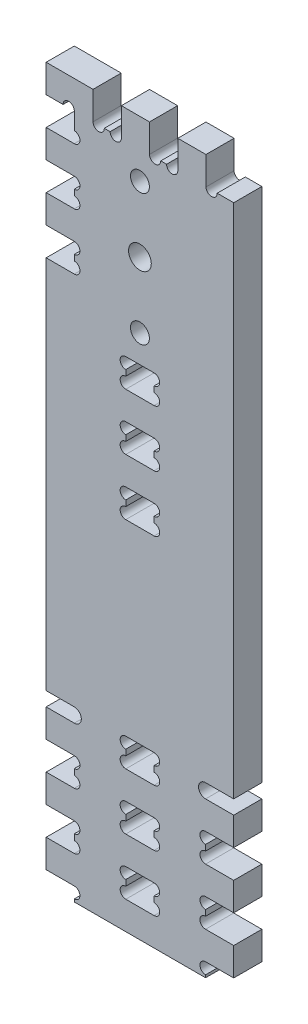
ISO-10303-21;
HEADER;
FILE_DESCRIPTION(('STEP AP214'),'2;1');
FILE_NAME('part.step','',(''),(''),'','','');
FILE_SCHEMA(('AUTOMOTIVE_DESIGN { 1 0 10303 214 1 1 1 1 }'));
ENDSEC;
DATA;
#1=APPLICATION_CONTEXT('core data for automotive mechanical design processes');
#2=APPLICATION_PROTOCOL_DEFINITION('international standard','automotive_design',2000,#1);
#3=PRODUCT_CONTEXT('',#1,'mechanical');
#4=PRODUCT('Part','Part','',(#3));
#5=PRODUCT_RELATED_PRODUCT_CATEGORY('part','',(#4));
#6=PRODUCT_DEFINITION_FORMATION('','',#4);
#7=PRODUCT_DEFINITION_CONTEXT('part definition',#1,'design');
#8=PRODUCT_DEFINITION('design','',#6,#7);
#9=PRODUCT_DEFINITION_SHAPE('','',#8);
#10=(LENGTH_UNIT() NAMED_UNIT(*) SI_UNIT(.MILLI.,.METRE.));
#11=(NAMED_UNIT(*) PLANE_ANGLE_UNIT() SI_UNIT($,.RADIAN.));
#12=(NAMED_UNIT(*) SI_UNIT($,.STERADIAN.) SOLID_ANGLE_UNIT());
#13=UNCERTAINTY_MEASURE_WITH_UNIT(LENGTH_MEASURE(1.E-05),#10,'distance_accuracy_value','');
#14=(GEOMETRIC_REPRESENTATION_CONTEXT(3) GLOBAL_UNCERTAINTY_ASSIGNED_CONTEXT((#13)) GLOBAL_UNIT_ASSIGNED_CONTEXT((#10,
#11,#12)) REPRESENTATION_CONTEXT('',''));
#15=CARTESIAN_POINT('',(0.,0.,0.));
#16=DIRECTION('',(0.,0.,1.));
#17=DIRECTION('',(1.,0.,0.));
#18=AXIS2_PLACEMENT_3D('',#15,#16,#17);
#19=CARTESIAN_POINT('',(15.,86.35,15.));
#20=DIRECTION('',(0.,0.,1.));
#21=DIRECTION('',(1.,0.,0.));
#22=AXIS2_PLACEMENT_3D('',#19,#20,#21);
#23=PLANE('',#22);
#24=CARTESIAN_POINT('',(50.,315.270539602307,15.));
#25=DIRECTION('',(0.,0.,1.));
#26=DIRECTION('',(1.,0.,0.));
#27=AXIS2_PLACEMENT_3D('',#24,#25,#26);
#28=CIRCLE('',#27,6.05000000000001);
#29=CARTESIAN_POINT('',(56.05,315.270539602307,15.));
#30=VERTEX_POINT('',#29);
#31=EDGE_CURVE('E1671',#30,#30,#28,.T.);
#32=ORIENTED_EDGE('',*,*,#31,.F.);
#33=EDGE_LOOP('',(#32));
#34=FACE_BOUND('',#33,.T.);
#35=CARTESIAN_POINT('',(50.,280.270515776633,15.));
#36=DIRECTION('',(0.,0.,1.));
#37=DIRECTION('',(1.,0.,0.));
#38=AXIS2_PLACEMENT_3D('',#35,#36,#37);
#39=CIRCLE('',#38,5.05000000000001);
#40=CARTESIAN_POINT('',(55.05,280.270515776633,15.));
#41=VERTEX_POINT('',#40);
#42=EDGE_CURVE('E1670',#41,#41,#39,.T.);
#43=ORIENTED_EDGE('',*,*,#42,.F.);
#44=EDGE_LOOP('',(#43));
#45=FACE_BOUND('',#44,.T.);
#46=CARTESIAN_POINT('',(50.,350.270515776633,15.));
#47=DIRECTION('',(0.,0.,1.));
#48=DIRECTION('',(1.,0.,0.));
#49=AXIS2_PLACEMENT_3D('',#46,#47,#48);
#50=CIRCLE('',#49,5.05000000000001);
#51=CARTESIAN_POINT('',(55.05,350.270515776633,15.));
#52=VERTEX_POINT('',#51);
#53=EDGE_CURVE('E1691',#52,#52,#50,.T.);
#54=ORIENTED_EDGE('',*,*,#53,.F.);
#55=EDGE_LOOP('',(#54));
#56=FACE_BOUND('',#55,.T.);
#57=DIRECTION('',(0.,-1.,0.));
#58=VECTOR('',#57,1.);
#59=CARTESIAN_POINT('',(42.4499999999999,0.,15.));
#60=LINE('',#59,#58);
#61=CARTESIAN_POINT('',(42.4499999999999,84.3,15.));
#62=VERTEX_POINT('',#61);
#63=CARTESIAN_POINT('',(42.4499999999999,81.2,15.));
#64=VERTEX_POINT('',#63);
#65=EDGE_CURVE('E854',#62,#64,#60,.T.);
#66=ORIENTED_EDGE('',*,*,#65,.F.);
#67=CARTESIAN_POINT('',(42.4499999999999,87.3,15.));
#68=DIRECTION('',(0.,0.,1.));
#69=DIRECTION('',(1.,0.,0.));
#70=AXIS2_PLACEMENT_3D('',#67,#68,#69);
#71=CIRCLE('',#70,3.);
#72=CARTESIAN_POINT('',(42.4499999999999,90.3,15.));
#73=VERTEX_POINT('',#72);
#74=EDGE_CURVE('E857',#62,#73,#71,.F.);
#75=ORIENTED_EDGE('',*,*,#74,.T.);
#76=DIRECTION('',(1.,0.,0.));
#77=VECTOR('',#76,1.);
#78=CARTESIAN_POINT('',(0.,90.3,15.));
#79=LINE('',#78,#77);
#80=CARTESIAN_POINT('',(57.5499999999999,90.3,15.));
#81=VERTEX_POINT('',#80);
#82=EDGE_CURVE('E825',#73,#81,#79,.T.);
#83=ORIENTED_EDGE('',*,*,#82,.T.);
#84=CARTESIAN_POINT('',(57.5499999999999,87.3,15.));
#85=DIRECTION('',(0.,0.,1.));
#86=DIRECTION('',(1.,0.,0.));
#87=AXIS2_PLACEMENT_3D('',#84,#85,#86);
#88=CIRCLE('',#87,3.);
#89=CARTESIAN_POINT('',(57.5499999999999,84.3,15.));
#90=VERTEX_POINT('',#89);
#91=EDGE_CURVE('E839',#81,#90,#88,.F.);
#92=ORIENTED_EDGE('',*,*,#91,.T.);
#93=DIRECTION('',(0.,1.,0.));
#94=VECTOR('',#93,1.);
#95=CARTESIAN_POINT('',(57.5499999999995,-2.57634415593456E-13,15.));
#96=LINE('',#95,#94);
#97=CARTESIAN_POINT('',(57.5499999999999,81.2,15.));
#98=VERTEX_POINT('',#97);
#99=EDGE_CURVE('E842',#98,#90,#96,.T.);
#100=ORIENTED_EDGE('',*,*,#99,.F.);
#101=CARTESIAN_POINT('',(57.5499999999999,78.2,15.));
#102=DIRECTION('',(0.,0.,1.));
#103=DIRECTION('',(1.,0.,0.));
#104=AXIS2_PLACEMENT_3D('',#101,#102,#103);
#105=CIRCLE('',#104,3.);
#106=CARTESIAN_POINT('',(57.5499999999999,75.2,15.));
#107=VERTEX_POINT('',#106);
#108=EDGE_CURVE('E845',#98,#107,#105,.F.);
#109=ORIENTED_EDGE('',*,*,#108,.T.);
#110=DIRECTION('',(1.,0.,0.));
#111=VECTOR('',#110,1.);
#112=CARTESIAN_POINT('',(0.,75.2,15.));
#113=LINE('',#112,#111);
#114=CARTESIAN_POINT('',(42.4499999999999,75.2,15.));
#115=VERTEX_POINT('',#114);
#116=EDGE_CURVE('E848',#115,#107,#113,.T.);
#117=ORIENTED_EDGE('',*,*,#116,.F.);
#118=CARTESIAN_POINT('',(42.4499999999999,78.2,15.));
#119=DIRECTION('',(0.,0.,1.));
#120=DIRECTION('',(1.,0.,0.));
#121=AXIS2_PLACEMENT_3D('',#118,#119,#120);
#122=CIRCLE('',#121,3.);
#123=EDGE_CURVE('E851',#64,#115,#122,.T.);
#124=ORIENTED_EDGE('',*,*,#123,.F.);
#125=EDGE_LOOP('',(#66,#75,#83,#92,#100,#109,#117,#124));
#126=FACE_BOUND('',#125,.T.);
#127=DIRECTION('',(0.,-1.,0.));
#128=VECTOR('',#127,1.);
#129=CARTESIAN_POINT('',(42.4500000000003,0.,15.));
#130=LINE('',#129,#128);
#131=CARTESIAN_POINT('',(42.4499999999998,229.5,15.));
#132=VERTEX_POINT('',#131);
#133=CARTESIAN_POINT('',(42.4499999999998,226.4,15.));
#134=VERTEX_POINT('',#133);
#135=EDGE_CURVE('E936',#132,#134,#130,.T.);
#136=ORIENTED_EDGE('',*,*,#135,.F.);
#137=CARTESIAN_POINT('',(42.4499999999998,232.5,15.));
#138=DIRECTION('',(0.,0.,1.));
#139=DIRECTION('',(1.,0.,0.));
#140=AXIS2_PLACEMENT_3D('',#137,#138,#139);
#141=CIRCLE('',#140,3.);
#142=CARTESIAN_POINT('',(42.4499999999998,235.5,15.));
#143=VERTEX_POINT('',#142);
#144=EDGE_CURVE('E939',#132,#143,#141,.F.);
#145=ORIENTED_EDGE('',*,*,#144,.T.);
#146=DIRECTION('',(1.,0.,0.));
#147=VECTOR('',#146,1.);
#148=CARTESIAN_POINT('',(0.,235.5,15.));
#149=LINE('',#148,#147);
#150=CARTESIAN_POINT('',(57.5499999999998,235.5,15.));
#151=VERTEX_POINT('',#150);
#152=EDGE_CURVE('E905',#143,#151,#149,.T.);
#153=ORIENTED_EDGE('',*,*,#152,.T.);
#154=CARTESIAN_POINT('',(57.5499999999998,232.5,15.));
#155=DIRECTION('',(0.,0.,1.));
#156=DIRECTION('',(1.,0.,0.));
#157=AXIS2_PLACEMENT_3D('',#154,#155,#156);
#158=CIRCLE('',#157,2.99999999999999);
#159=CARTESIAN_POINT('',(57.5499999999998,229.5,15.));
#160=VERTEX_POINT('',#159);
#161=EDGE_CURVE('E921',#151,#160,#158,.F.);
#162=ORIENTED_EDGE('',*,*,#161,.T.);
#163=DIRECTION('',(0.,1.,0.));
#164=VECTOR('',#163,1.);
#165=CARTESIAN_POINT('',(57.5499999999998,0.,15.));
#166=LINE('',#165,#164);
#167=CARTESIAN_POINT('',(57.5499999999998,226.4,15.));
#168=VERTEX_POINT('',#167);
#169=EDGE_CURVE('E924',#168,#160,#166,.T.);
#170=ORIENTED_EDGE('',*,*,#169,.F.);
#171=CARTESIAN_POINT('',(57.5499999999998,223.4,15.));
#172=DIRECTION('',(0.,0.,1.));
#173=DIRECTION('',(1.,0.,0.));
#174=AXIS2_PLACEMENT_3D('',#171,#172,#173);
#175=CIRCLE('',#174,3.00000000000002);
#176=CARTESIAN_POINT('',(57.5499999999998,220.4,15.));
#177=VERTEX_POINT('',#176);
#178=EDGE_CURVE('E927',#168,#177,#175,.F.);
#179=ORIENTED_EDGE('',*,*,#178,.T.);
#180=DIRECTION('',(1.,0.,0.));
#181=VECTOR('',#180,1.);
#182=CARTESIAN_POINT('',(0.,220.4,15.));
#183=LINE('',#182,#181);
#184=CARTESIAN_POINT('',(42.4499999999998,220.4,15.));
#185=VERTEX_POINT('',#184);
#186=EDGE_CURVE('E930',#185,#177,#183,.T.);
#187=ORIENTED_EDGE('',*,*,#186,.F.);
#188=CARTESIAN_POINT('',(42.4499999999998,223.4,15.));
#189=DIRECTION('',(0.,0.,1.));
#190=DIRECTION('',(1.,0.,0.));
#191=AXIS2_PLACEMENT_3D('',#188,#189,#190);
#192=CIRCLE('',#191,3.);
#193=EDGE_CURVE('E933',#134,#185,#192,.T.);
#194=ORIENTED_EDGE('',*,*,#193,.F.);
#195=EDGE_LOOP('',(#136,#145,#153,#162,#170,#179,#187,#194));
#196=FACE_BOUND('',#195,.T.);
#197=DIRECTION('',(0.,-1.,0.));
#198=VECTOR('',#197,1.);
#199=CARTESIAN_POINT('',(42.45,0.,15.));
#200=LINE('',#199,#198);
#201=CARTESIAN_POINT('',(42.45,24.1,15.));
#202=VERTEX_POINT('',#201);
#203=CARTESIAN_POINT('',(42.45,21.,15.));
#204=VERTEX_POINT('',#203);
#205=EDGE_CURVE('E986',#202,#204,#200,.T.);
#206=ORIENTED_EDGE('',*,*,#205,.F.);
#207=CARTESIAN_POINT('',(42.45,27.1,15.));
#208=DIRECTION('',(0.,0.,1.));
#209=DIRECTION('',(1.,0.,0.));
#210=AXIS2_PLACEMENT_3D('',#207,#208,#209);
#211=CIRCLE('',#210,3.);
#212=CARTESIAN_POINT('',(42.45,30.1,15.));
#213=VERTEX_POINT('',#212);
#214=EDGE_CURVE('E983',#202,#213,#211,.F.);
#215=ORIENTED_EDGE('',*,*,#214,.T.);
#216=DIRECTION('',(1.,0.,0.));
#217=VECTOR('',#216,1.);
#218=CARTESIAN_POINT('',(0.,30.1,15.));
#219=LINE('',#218,#217);
#220=CARTESIAN_POINT('',(57.55,30.1,15.));
#221=VERTEX_POINT('',#220);
#222=EDGE_CURVE('E1004',#213,#221,#219,.T.);
#223=ORIENTED_EDGE('',*,*,#222,.T.);
#224=CARTESIAN_POINT('',(57.55,27.1,15.));
#225=DIRECTION('',(0.,0.,1.));
#226=DIRECTION('',(1.,0.,0.));
#227=AXIS2_PLACEMENT_3D('',#224,#225,#226);
#228=CIRCLE('',#227,3.);
#229=CARTESIAN_POINT('',(57.55,24.1,15.));
#230=VERTEX_POINT('',#229);
#231=EDGE_CURVE('E1001',#221,#230,#228,.F.);
#232=ORIENTED_EDGE('',*,*,#231,.T.);
#233=DIRECTION('',(0.,1.,0.));
#234=VECTOR('',#233,1.);
#235=CARTESIAN_POINT('',(57.5500000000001,2.57634415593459E-13,15.));
#236=LINE('',#235,#234);
#237=CARTESIAN_POINT('',(57.55,21.,15.));
#238=VERTEX_POINT('',#237);
#239=EDGE_CURVE('E998',#238,#230,#236,.T.);
#240=ORIENTED_EDGE('',*,*,#239,.F.);
#241=CARTESIAN_POINT('',(57.55,18.,15.));
#242=DIRECTION('',(0.,0.,1.));
#243=DIRECTION('',(1.,0.,0.));
#244=AXIS2_PLACEMENT_3D('',#241,#242,#243);
#245=CIRCLE('',#244,3.);
#246=CARTESIAN_POINT('',(57.55,15.,15.));
#247=VERTEX_POINT('',#246);
#248=EDGE_CURVE('E995',#238,#247,#245,.F.);
#249=ORIENTED_EDGE('',*,*,#248,.T.);
#250=DIRECTION('',(1.,0.,0.));
#251=VECTOR('',#250,1.);
#252=CARTESIAN_POINT('',(0.,15.,15.));
#253=LINE('',#252,#251);
#254=CARTESIAN_POINT('',(42.45,15.,15.));
#255=VERTEX_POINT('',#254);
#256=EDGE_CURVE('E992',#255,#247,#253,.T.);
#257=ORIENTED_EDGE('',*,*,#256,.F.);
#258=CARTESIAN_POINT('',(42.45,18.,15.));
#259=DIRECTION('',(0.,0.,1.));
#260=DIRECTION('',(1.,0.,0.));
#261=AXIS2_PLACEMENT_3D('',#258,#259,#260);
#262=CIRCLE('',#261,3.);
#263=EDGE_CURVE('E989',#204,#255,#262,.T.);
#264=ORIENTED_EDGE('',*,*,#263,.F.);
#265=EDGE_LOOP('',(#206,#215,#223,#232,#240,#249,#257,#264));
#266=FACE_BOUND('',#265,.T.);
#267=CARTESIAN_POINT('',(15.,86.35,15.));
#268=DIRECTION('',(0.,0.,-1.));
#269=DIRECTION('',(1.,0.,0.));
#270=AXIS2_PLACEMENT_3D('',#267,#268,#269);
#271=CIRCLE('',#270,3.75);
#272=CARTESIAN_POINT('',(15.,90.1,15.));
#273=VERTEX_POINT('',#272);
#274=CARTESIAN_POINT('',(15.,82.6,15.));
#275=VERTEX_POINT('',#274);
#276=EDGE_CURVE('E1025',#273,#275,#271,.T.);
#277=ORIENTED_EDGE('',*,*,#276,.T.);
#278=DIRECTION('',(-1.,0.,0.));
#279=VECTOR('',#278,1.);
#280=CARTESIAN_POINT('',(0.,82.6,15.));
#281=LINE('',#280,#279);
#282=CARTESIAN_POINT('',(0.,82.6,15.));
#283=VERTEX_POINT('',#282);
#284=EDGE_CURVE('E1028',#275,#283,#281,.T.);
#285=ORIENTED_EDGE('',*,*,#284,.T.);
#286=DIRECTION('',(0.,-1.,0.));
#287=VECTOR('',#286,1.);
#288=CARTESIAN_POINT('',(0.,82.6,15.));
#289=LINE('',#288,#287);
#290=CARTESIAN_POINT('',(0.,67.6,15.));
#291=VERTEX_POINT('',#290);
#292=EDGE_CURVE('E1031',#283,#291,#289,.T.);
#293=ORIENTED_EDGE('',*,*,#292,.T.);
#294=DIRECTION('',(1.,0.,0.));
#295=VECTOR('',#294,1.);
#296=CARTESIAN_POINT('',(0.,67.6,15.));
#297=LINE('',#296,#295);
#298=CARTESIAN_POINT('',(15.,67.6,15.));
#299=VERTEX_POINT('',#298);
#300=EDGE_CURVE('E1033',#291,#299,#297,.T.);
#301=ORIENTED_EDGE('',*,*,#300,.T.);
#302=CARTESIAN_POINT('',(15.,64.6,15.));
#303=DIRECTION('',(0.,0.,-1.));
#304=DIRECTION('',(-1.,0.,0.));
#305=AXIS2_PLACEMENT_3D('',#302,#303,#304);
#306=CIRCLE('',#305,3.);
#307=CARTESIAN_POINT('',(15.,61.6,15.));
#308=VERTEX_POINT('',#307);
#309=EDGE_CURVE('E1035',#299,#308,#306,.T.);
#310=ORIENTED_EDGE('',*,*,#309,.T.);
#311=DIRECTION('',(0.,-1.,0.));
#312=VECTOR('',#311,1.);
#313=CARTESIAN_POINT('',(15.,61.6,15.));
#314=LINE('',#313,#312);
#315=CARTESIAN_POINT('',(15.,58.5,15.));
#316=VERTEX_POINT('',#315);
#317=EDGE_CURVE('E1037',#308,#316,#314,.T.);
#318=ORIENTED_EDGE('',*,*,#317,.T.);
#319=CARTESIAN_POINT('',(15.,55.5,15.));
#320=DIRECTION('',(0.,0.,-1.));
#321=DIRECTION('',(-1.,0.,0.));
#322=AXIS2_PLACEMENT_3D('',#319,#320,#321);
#323=CIRCLE('',#322,3.);
#324=CARTESIAN_POINT('',(15.,52.5,15.));
#325=VERTEX_POINT('',#324);
#326=EDGE_CURVE('E1039',#316,#325,#323,.T.);
#327=ORIENTED_EDGE('',*,*,#326,.T.);
#328=DIRECTION('',(-1.,0.,0.));
#329=VECTOR('',#328,1.);
#330=CARTESIAN_POINT('',(15.,52.5,15.));
#331=LINE('',#330,#329);
#332=CARTESIAN_POINT('',(0.,52.5,15.));
#333=VERTEX_POINT('',#332);
#334=EDGE_CURVE('E1041',#325,#333,#331,.T.);
#335=ORIENTED_EDGE('',*,*,#334,.T.);
#336=DIRECTION('',(0.,-1.,0.));
#337=VECTOR('',#336,1.);
#338=CARTESIAN_POINT('',(0.,52.5,15.));
#339=LINE('',#338,#337);
#340=CARTESIAN_POINT('',(0.,37.5,15.));
#341=VERTEX_POINT('',#340);
#342=EDGE_CURVE('E1043',#333,#341,#339,.T.);
#343=ORIENTED_EDGE('',*,*,#342,.T.);
#344=DIRECTION('',(1.,0.,0.));
#345=VECTOR('',#344,1.);
#346=CARTESIAN_POINT('',(0.,37.5,15.));
#347=LINE('',#346,#345);
#348=CARTESIAN_POINT('',(15.,37.5,15.));
#349=VERTEX_POINT('',#348);
#350=EDGE_CURVE('E1045',#341,#349,#347,.T.);
#351=ORIENTED_EDGE('',*,*,#350,.T.);
#352=CARTESIAN_POINT('',(15.,34.5,15.));
#353=DIRECTION('',(0.,0.,-1.));
#354=DIRECTION('',(-1.,0.,0.));
#355=AXIS2_PLACEMENT_3D('',#352,#353,#354);
#356=CIRCLE('',#355,3.);
#357=CARTESIAN_POINT('',(15.,31.5,15.));
#358=VERTEX_POINT('',#357);
#359=EDGE_CURVE('E1047',#349,#358,#356,.T.);
#360=ORIENTED_EDGE('',*,*,#359,.T.);
#361=DIRECTION('',(0.,-1.,0.));
#362=VECTOR('',#361,1.);
#363=CARTESIAN_POINT('',(15.,31.5,15.));
#364=LINE('',#363,#362);
#365=CARTESIAN_POINT('',(15.,28.4,15.));
#366=VERTEX_POINT('',#365);
#367=EDGE_CURVE('E1049',#358,#366,#364,.T.);
#368=ORIENTED_EDGE('',*,*,#367,.T.);
#369=CARTESIAN_POINT('',(15.,25.4,15.));
#370=DIRECTION('',(0.,0.,-1.));
#371=DIRECTION('',(-1.,0.,0.));
#372=AXIS2_PLACEMENT_3D('',#369,#370,#371);
#373=CIRCLE('',#372,3.);
#374=CARTESIAN_POINT('',(15.,22.4,15.));
#375=VERTEX_POINT('',#374);
#376=EDGE_CURVE('E1051',#366,#375,#373,.T.);
#377=ORIENTED_EDGE('',*,*,#376,.T.);
#378=DIRECTION('',(-1.,0.,0.));
#379=VECTOR('',#378,1.);
#380=CARTESIAN_POINT('',(15.,22.4,15.));
#381=LINE('',#380,#379);
#382=CARTESIAN_POINT('',(0.,22.4,15.));
#383=VERTEX_POINT('',#382);
#384=EDGE_CURVE('E1053',#375,#383,#381,.T.);
#385=ORIENTED_EDGE('',*,*,#384,.T.);
#386=DIRECTION('',(0.,-1.,0.));
#387=VECTOR('',#386,1.);
#388=CARTESIAN_POINT('',(0.,22.4,15.));
#389=LINE('',#388,#387);
#390=CARTESIAN_POINT('',(0.,7.4,15.));
#391=VERTEX_POINT('',#390);
#392=EDGE_CURVE('E1055',#383,#391,#389,.T.);
#393=ORIENTED_EDGE('',*,*,#392,.T.);
#394=DIRECTION('',(1.,0.,0.));
#395=VECTOR('',#394,1.);
#396=CARTESIAN_POINT('',(0.,7.4,15.));
#397=LINE('',#396,#395);
#398=CARTESIAN_POINT('',(15.,7.4,15.));
#399=VERTEX_POINT('',#398);
#400=EDGE_CURVE('E1057',#391,#399,#397,.T.);
#401=ORIENTED_EDGE('',*,*,#400,.T.);
#402=CARTESIAN_POINT('',(15.,4.4,15.));
#403=DIRECTION('',(0.,0.,-1.));
#404=DIRECTION('',(-1.,0.,0.));
#405=AXIS2_PLACEMENT_3D('',#402,#403,#404);
#406=CIRCLE('',#405,3.);
#407=CARTESIAN_POINT('',(15.,1.4,15.));
#408=VERTEX_POINT('',#407);
#409=EDGE_CURVE('E1059',#399,#408,#406,.T.);
#410=ORIENTED_EDGE('',*,*,#409,.T.);
#411=DIRECTION('',(0.,-1.,0.));
#412=VECTOR('',#411,1.);
#413=CARTESIAN_POINT('',(15.,1.4,15.));
#414=LINE('',#413,#412);
#415=CARTESIAN_POINT('',(15.,0.,15.));
#416=VERTEX_POINT('',#415);
#417=EDGE_CURVE('E1061',#408,#416,#414,.T.);
#418=ORIENTED_EDGE('',*,*,#417,.T.);
#419=DIRECTION('',(1.,0.,0.));
#420=VECTOR('',#419,1.);
#421=CARTESIAN_POINT('',(85.,0.,15.));
#422=LINE('',#421,#420);
#423=CARTESIAN_POINT('',(85.,0.,15.));
#424=VERTEX_POINT('',#423);
#425=EDGE_CURVE('E1063',#416,#424,#422,.T.);
#426=ORIENTED_EDGE('',*,*,#425,.T.);
#427=DIRECTION('',(0.,1.,0.));
#428=VECTOR('',#427,1.);
#429=CARTESIAN_POINT('',(85.,1.39999999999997,15.));
#430=LINE('',#429,#428);
#431=CARTESIAN_POINT('',(85.,1.39999999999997,15.));
#432=VERTEX_POINT('',#431);
#433=EDGE_CURVE('E1065',#424,#432,#430,.T.);
#434=ORIENTED_EDGE('',*,*,#433,.T.);
#435=CARTESIAN_POINT('',(85.,4.39999999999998,15.));
#436=DIRECTION('',(0.,0.,-1.));
#437=DIRECTION('',(1.,0.,0.));
#438=AXIS2_PLACEMENT_3D('',#435,#436,#437);
#439=CIRCLE('',#438,3.00000000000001);
#440=CARTESIAN_POINT('',(85.,7.39999999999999,15.));
#441=VERTEX_POINT('',#440);
#442=EDGE_CURVE('E1067',#432,#441,#439,.T.);
#443=ORIENTED_EDGE('',*,*,#442,.T.);
#444=DIRECTION('',(1.,0.,0.));
#445=VECTOR('',#444,1.);
#446=CARTESIAN_POINT('',(100.,7.4,15.));
#447=LINE('',#446,#445);
#448=CARTESIAN_POINT('',(100.,7.4,15.));
#449=VERTEX_POINT('',#448);
#450=EDGE_CURVE('E1069',#441,#449,#447,.T.);
#451=ORIENTED_EDGE('',*,*,#450,.T.);
#452=DIRECTION('',(0.,1.,0.));
#453=VECTOR('',#452,1.);
#454=CARTESIAN_POINT('',(100.,22.4,15.));
#455=LINE('',#454,#453);
#456=CARTESIAN_POINT('',(100.,22.4,15.));
#457=VERTEX_POINT('',#456);
#458=EDGE_CURVE('E1071',#449,#457,#455,.T.);
#459=ORIENTED_EDGE('',*,*,#458,.T.);
#460=DIRECTION('',(-1.,0.,0.));
#461=VECTOR('',#460,1.);
#462=CARTESIAN_POINT('',(85.,22.4,15.));
#463=LINE('',#462,#461);
#464=CARTESIAN_POINT('',(85.,22.4,15.));
#465=VERTEX_POINT('',#464);
#466=EDGE_CURVE('E1073',#457,#465,#463,.T.);
#467=ORIENTED_EDGE('',*,*,#466,.T.);
#468=CARTESIAN_POINT('',(85.0000000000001,25.4,15.));
#469=DIRECTION('',(0.,0.,-1.));
#470=DIRECTION('',(-1.,0.,0.));
#471=AXIS2_PLACEMENT_3D('',#468,#469,#470);
#472=CIRCLE('',#471,3.);
#473=CARTESIAN_POINT('',(85.0000000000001,28.4,15.));
#474=VERTEX_POINT('',#473);
#475=EDGE_CURVE('E1075',#465,#474,#472,.T.);
#476=ORIENTED_EDGE('',*,*,#475,.T.);
#477=DIRECTION('',(0.,1.,0.));
#478=VECTOR('',#477,1.);
#479=CARTESIAN_POINT('',(85.,31.5,15.));
#480=LINE('',#479,#478);
#481=CARTESIAN_POINT('',(85.,31.5,15.));
#482=VERTEX_POINT('',#481);
#483=EDGE_CURVE('E1077',#474,#482,#480,.T.);
#484=ORIENTED_EDGE('',*,*,#483,.T.);
#485=CARTESIAN_POINT('',(85.,34.5,15.));
#486=DIRECTION('',(0.,0.,-1.));
#487=DIRECTION('',(-1.,0.,0.));
#488=AXIS2_PLACEMENT_3D('',#485,#486,#487);
#489=CIRCLE('',#488,3.);
#490=CARTESIAN_POINT('',(85.,37.5,15.));
#491=VERTEX_POINT('',#490);
#492=EDGE_CURVE('E1079',#482,#491,#489,.T.);
#493=ORIENTED_EDGE('',*,*,#492,.T.);
#494=DIRECTION('',(1.,0.,0.));
#495=VECTOR('',#494,1.);
#496=CARTESIAN_POINT('',(100.,37.5,15.));
#497=LINE('',#496,#495);
#498=CARTESIAN_POINT('',(100.,37.5,15.));
#499=VERTEX_POINT('',#498);
#500=EDGE_CURVE('E1081',#491,#499,#497,.T.);
#501=ORIENTED_EDGE('',*,*,#500,.T.);
#502=DIRECTION('',(0.,1.,0.));
#503=VECTOR('',#502,1.);
#504=CARTESIAN_POINT('',(100.,52.5,15.));
#505=LINE('',#504,#503);
#506=CARTESIAN_POINT('',(100.,52.5,15.));
#507=VERTEX_POINT('',#506);
#508=EDGE_CURVE('E1083',#499,#507,#505,.T.);
#509=ORIENTED_EDGE('',*,*,#508,.T.);
#510=DIRECTION('',(-1.,0.,0.));
#511=VECTOR('',#510,1.);
#512=CARTESIAN_POINT('',(85.,52.5,15.));
#513=LINE('',#512,#511);
#514=CARTESIAN_POINT('',(85.,52.5,15.));
#515=VERTEX_POINT('',#514);
#516=EDGE_CURVE('E1085',#507,#515,#513,.T.);
#517=ORIENTED_EDGE('',*,*,#516,.T.);
#518=CARTESIAN_POINT('',(85.,55.5,15.));
#519=DIRECTION('',(0.,0.,-1.));
#520=DIRECTION('',(-1.,0.,0.));
#521=AXIS2_PLACEMENT_3D('',#518,#519,#520);
#522=CIRCLE('',#521,3.);
#523=CARTESIAN_POINT('',(85.,58.5,15.));
#524=VERTEX_POINT('',#523);
#525=EDGE_CURVE('E1087',#515,#524,#522,.T.);
#526=ORIENTED_EDGE('',*,*,#525,.T.);
#527=DIRECTION('',(0.,1.,0.));
#528=VECTOR('',#527,1.);
#529=CARTESIAN_POINT('',(85.,61.6,15.));
#530=LINE('',#529,#528);
#531=CARTESIAN_POINT('',(85.,61.6,15.));
#532=VERTEX_POINT('',#531);
#533=EDGE_CURVE('E1089',#524,#532,#530,.T.);
#534=ORIENTED_EDGE('',*,*,#533,.T.);
#535=CARTESIAN_POINT('',(85.,64.6,15.));
#536=DIRECTION('',(0.,0.,-1.));
#537=DIRECTION('',(-1.,0.,0.));
#538=AXIS2_PLACEMENT_3D('',#535,#536,#537);
#539=CIRCLE('',#538,3.);
#540=CARTESIAN_POINT('',(85.,67.6,15.));
#541=VERTEX_POINT('',#540);
#542=EDGE_CURVE('E1091',#532,#541,#539,.T.);
#543=ORIENTED_EDGE('',*,*,#542,.T.);
#544=DIRECTION('',(1.,0.,0.));
#545=VECTOR('',#544,1.);
#546=CARTESIAN_POINT('',(100.,67.6,15.));
#547=LINE('',#546,#545);
#548=CARTESIAN_POINT('',(100.,67.6,15.));
#549=VERTEX_POINT('',#548);
#550=EDGE_CURVE('E1093',#541,#549,#547,.T.);
#551=ORIENTED_EDGE('',*,*,#550,.T.);
#552=DIRECTION('',(0.,1.,0.));
#553=VECTOR('',#552,1.);
#554=CARTESIAN_POINT('',(100.,82.6,15.));
#555=LINE('',#554,#553);
#556=CARTESIAN_POINT('',(100.,82.6,15.));
#557=VERTEX_POINT('',#556);
#558=EDGE_CURVE('E1095',#549,#557,#555,.T.);
#559=ORIENTED_EDGE('',*,*,#558,.T.);
#560=DIRECTION('',(-1.,0.,0.));
#561=VECTOR('',#560,1.);
#562=CARTESIAN_POINT('',(85.,82.6,15.));
#563=LINE('',#562,#561);
#564=CARTESIAN_POINT('',(85.,82.6,15.));
#565=VERTEX_POINT('',#564);
#566=EDGE_CURVE('E1097',#557,#565,#563,.T.);
#567=ORIENTED_EDGE('',*,*,#566,.T.);
#568=CARTESIAN_POINT('',(85.,86.35,15.));
#569=DIRECTION('',(0.,0.,-1.));
#570=DIRECTION('',(-1.,0.,0.));
#571=AXIS2_PLACEMENT_3D('',#568,#569,#570);
#572=CIRCLE('',#571,3.75);
#573=CARTESIAN_POINT('',(85.,90.1,15.));
#574=VERTEX_POINT('',#573);
#575=EDGE_CURVE('E1099',#565,#574,#572,.T.);
#576=ORIENTED_EDGE('',*,*,#575,.T.);
#577=DIRECTION('',(1.,0.,0.));
#578=VECTOR('',#577,1.);
#579=CARTESIAN_POINT('',(85.,90.1,15.));
#580=LINE('',#579,#578);
#581=CARTESIAN_POINT('',(100.,90.1,15.));
#582=VERTEX_POINT('',#581);
#583=EDGE_CURVE('E1101',#574,#582,#580,.T.);
#584=ORIENTED_EDGE('',*,*,#583,.T.);
#585=DIRECTION('',(0.,1.,0.));
#586=VECTOR('',#585,1.);
#587=CARTESIAN_POINT('',(100.,90.1,15.));
#588=LINE('',#587,#586);
#589=CARTESIAN_POINT('',(100.,365.4,15.));
#590=VERTEX_POINT('',#589);
#591=EDGE_CURVE('E1103',#582,#590,#588,.T.);
#592=ORIENTED_EDGE('',*,*,#591,.T.);
#593=DIRECTION('',(-1.,0.,0.));
#594=VECTOR('',#593,1.);
#595=CARTESIAN_POINT('',(91.1999999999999,365.4,15.));
#596=LINE('',#595,#594);
#597=CARTESIAN_POINT('',(91.1999999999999,365.4,15.));
#598=VERTEX_POINT('',#597);
#599=EDGE_CURVE('E1105',#590,#598,#596,.T.);
#600=ORIENTED_EDGE('',*,*,#599,.T.);
#601=CARTESIAN_POINT('',(88.1999999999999,365.335267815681,15.));
#602=DIRECTION('',(0.,0.,-1.));
#603=DIRECTION('',(-1.,0.,0.));
#604=AXIS2_PLACEMENT_3D('',#601,#602,#603);
#605=CIRCLE('',#604,3.00069829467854);
#606=CARTESIAN_POINT('',(85.2,365.270535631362,15.));
#607=VERTEX_POINT('',#606);
#608=EDGE_CURVE('E1107',#598,#607,#605,.T.);
#609=ORIENTED_EDGE('',*,*,#608,.T.);
#610=DIRECTION('',(0.,1.,0.));
#611=VECTOR('',#610,1.);
#612=CARTESIAN_POINT('',(85.1999999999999,380.270535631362,15.));
#613=LINE('',#612,#611);
#614=CARTESIAN_POINT('',(85.1999999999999,380.270535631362,15.));
#615=VERTEX_POINT('',#614);
#616=EDGE_CURVE('E1109',#607,#615,#613,.T.);
#617=ORIENTED_EDGE('',*,*,#616,.T.);
#618=DIRECTION('',(-1.,0.,0.));
#619=VECTOR('',#618,1.);
#620=CARTESIAN_POINT('',(70.1999999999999,380.270535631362,15.));
#621=LINE('',#620,#619);
#622=CARTESIAN_POINT('',(70.1999999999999,380.270535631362,15.));
#623=VERTEX_POINT('',#622);
#624=EDGE_CURVE('E1111',#615,#623,#621,.T.);
#625=ORIENTED_EDGE('',*,*,#624,.T.);
#626=DIRECTION('',(0.,-1.,0.));
#627=VECTOR('',#626,1.);
#628=CARTESIAN_POINT('',(70.1999999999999,365.270535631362,15.));
#629=LINE('',#628,#627);
#630=CARTESIAN_POINT('',(70.1999999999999,365.270535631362,15.));
#631=VERTEX_POINT('',#630);
#632=EDGE_CURVE('E1113',#623,#631,#629,.T.);
#633=ORIENTED_EDGE('',*,*,#632,.T.);
#634=CARTESIAN_POINT('',(67.1999999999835,365.270535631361,15.));
#635=DIRECTION('',(0.,0.,-1.));
#636=DIRECTION('',(-1.,0.,0.));
#637=AXIS2_PLACEMENT_3D('',#634,#635,#636);
#638=CIRCLE('',#637,3.00000000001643);
#639=CARTESIAN_POINT('',(64.2000000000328,365.270515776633,15.));
#640=VERTEX_POINT('',#639);
#641=EDGE_CURVE('E1115',#631,#640,#638,.T.);
#642=ORIENTED_EDGE('',*,*,#641,.T.);
#643=DIRECTION('',(-1.,0.,0.));
#644=VECTOR('',#643,1.);
#645=CARTESIAN_POINT('',(61.0999999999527,365.270515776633,15.));
#646=LINE('',#645,#644);
#647=CARTESIAN_POINT('',(61.0999999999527,365.270515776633,15.));
#648=VERTEX_POINT('',#647);
#649=EDGE_CURVE('E1117',#640,#648,#646,.T.);
#650=ORIENTED_EDGE('',*,*,#649,.T.);
#651=CARTESIAN_POINT('',(58.1000000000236,365.270539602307,15.));
#652=DIRECTION('',(0.,0.,-1.));
#653=DIRECTION('',(-1.,0.,0.));
#654=AXIS2_PLACEMENT_3D('',#651,#652,#653);
#655=CIRCLE('',#654,3.00000000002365);
#656=CARTESIAN_POINT('',(55.1,365.270539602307,15.));
#657=VERTEX_POINT('',#656);
#658=EDGE_CURVE('E1119',#648,#657,#655,.T.);
#659=ORIENTED_EDGE('',*,*,#658,.T.);
#660=DIRECTION('',(0.,1.,0.));
#661=VECTOR('',#660,1.);
#662=CARTESIAN_POINT('',(55.1,380.270539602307,15.));
#663=LINE('',#662,#661);
#664=CARTESIAN_POINT('',(55.1,380.270539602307,15.));
#665=VERTEX_POINT('',#664);
#666=EDGE_CURVE('E1121',#657,#665,#663,.T.);
#667=ORIENTED_EDGE('',*,*,#666,.T.);
#668=DIRECTION('',(-1.,0.,0.));
#669=VECTOR('',#668,1.);
#670=CARTESIAN_POINT('',(40.1,380.270539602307,15.));
#671=LINE('',#670,#669);
#672=CARTESIAN_POINT('',(40.1,380.270539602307,15.));
#673=VERTEX_POINT('',#672);
#674=EDGE_CURVE('E1123',#665,#673,#671,.T.);
#675=ORIENTED_EDGE('',*,*,#674,.T.);
#676=DIRECTION('',(0.,-1.,0.));
#677=VECTOR('',#676,1.);
#678=CARTESIAN_POINT('',(40.1,365.270539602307,15.));
#679=LINE('',#678,#677);
#680=CARTESIAN_POINT('',(40.1,365.270539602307,15.));
#681=VERTEX_POINT('',#680);
#682=EDGE_CURVE('E1125',#673,#681,#679,.T.);
#683=ORIENTED_EDGE('',*,*,#682,.T.);
#684=CARTESIAN_POINT('',(37.0999999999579,365.270539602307,15.));
#685=DIRECTION('',(0.,0.,-1.));
#686=DIRECTION('',(-1.,0.,0.));
#687=AXIS2_PLACEMENT_3D('',#684,#685,#686);
#688=CIRCLE('',#687,3.00000000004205);
#689=CARTESIAN_POINT('',(34.1000000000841,365.270507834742,15.));
#690=VERTEX_POINT('',#689);
#691=EDGE_CURVE('E1127',#681,#690,#688,.T.);
#692=ORIENTED_EDGE('',*,*,#691,.T.);
#693=DIRECTION('',(-1.,0.,0.));
#694=VECTOR('',#693,1.);
#695=CARTESIAN_POINT('',(30.9999999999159,365.270507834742,15.));
#696=LINE('',#695,#694);
#697=CARTESIAN_POINT('',(30.9999999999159,365.270507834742,15.));
#698=VERTEX_POINT('',#697);
#699=EDGE_CURVE('E1129',#690,#698,#696,.T.);
#700=ORIENTED_EDGE('',*,*,#699,.T.);
#701=CARTESIAN_POINT('',(28.0000000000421,365.270539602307,15.));
#702=DIRECTION('',(0.,0.,-1.));
#703=DIRECTION('',(-1.,0.,0.));
#704=AXIS2_PLACEMENT_3D('',#701,#702,#703);
#705=CIRCLE('',#704,3.00000000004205);
#706=CARTESIAN_POINT('',(25.,365.270539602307,15.));
#707=VERTEX_POINT('',#706);
#708=EDGE_CURVE('E1131',#698,#707,#705,.T.);
#709=ORIENTED_EDGE('',*,*,#708,.T.);
#710=DIRECTION('',(0.,1.,0.));
#711=VECTOR('',#710,1.);
#712=CARTESIAN_POINT('',(25.,365.270539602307,15.));
#713=LINE('',#712,#711);
#714=CARTESIAN_POINT('',(25.,380.270539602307,15.));
#715=VERTEX_POINT('',#714);
#716=EDGE_CURVE('E1133',#707,#715,#713,.T.);
#717=ORIENTED_EDGE('',*,*,#716,.T.);
#718=DIRECTION('',(-1.,0.,0.));
#719=VECTOR('',#718,1.);
#720=CARTESIAN_POINT('',(0.,380.270539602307,15.));
#721=LINE('',#720,#719);
#722=CARTESIAN_POINT('',(0.,380.270539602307,15.));
#723=VERTEX_POINT('',#722);
#724=EDGE_CURVE('E1135',#715,#723,#721,.T.);
#725=ORIENTED_EDGE('',*,*,#724,.T.);
#726=DIRECTION('',(0.,-1.,0.));
#727=VECTOR('',#726,1.);
#728=CARTESIAN_POINT('',(0.,365.270539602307,15.));
#729=LINE('',#728,#727);
#730=CARTESIAN_POINT('',(0.,365.270539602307,15.));
#731=VERTEX_POINT('',#730);
#732=EDGE_CURVE('E1137',#723,#731,#729,.T.);
#733=ORIENTED_EDGE('',*,*,#732,.T.);
#734=DIRECTION('',(1.,0.,0.));
#735=VECTOR('',#734,1.);
#736=CARTESIAN_POINT('',(0.,365.270539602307,15.));
#737=LINE('',#736,#735);
#738=CARTESIAN_POINT('',(9.,365.270539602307,15.));
#739=VERTEX_POINT('',#738);
#740=EDGE_CURVE('E1139',#731,#739,#737,.T.);
#741=ORIENTED_EDGE('',*,*,#740,.T.);
#742=CARTESIAN_POINT('',(12.,365.270539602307,15.));
#743=DIRECTION('',(0.,0.,-1.));
#744=DIRECTION('',(1.,0.,0.));
#745=AXIS2_PLACEMENT_3D('',#742,#743,#744);
#746=CIRCLE('',#745,3.);
#747=CARTESIAN_POINT('',(15.,365.270539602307,15.));
#748=VERTEX_POINT('',#747);
#749=EDGE_CURVE('E1141',#739,#748,#746,.T.);
#750=ORIENTED_EDGE('',*,*,#749,.T.);
#751=DIRECTION('',(0.,-1.,0.));
#752=VECTOR('',#751,1.);
#753=CARTESIAN_POINT('',(15.,356.170539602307,15.));
#754=LINE('',#753,#752);
#755=CARTESIAN_POINT('',(15.,356.170539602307,15.));
#756=VERTEX_POINT('',#755);
#757=EDGE_CURVE('E1143',#748,#756,#754,.T.);
#758=ORIENTED_EDGE('',*,*,#757,.T.);
#759=CARTESIAN_POINT('',(15.,353.170539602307,15.));
#760=DIRECTION('',(0.,0.,-1.));
#761=DIRECTION('',(-1.,0.,0.));
#762=AXIS2_PLACEMENT_3D('',#759,#760,#761);
#763=CIRCLE('',#762,3.);
#764=CARTESIAN_POINT('',(15.,350.170539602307,15.));
#765=VERTEX_POINT('',#764);
#766=EDGE_CURVE('E1145',#756,#765,#763,.T.);
#767=ORIENTED_EDGE('',*,*,#766,.T.);
#768=DIRECTION('',(-1.,0.,0.));
#769=VECTOR('',#768,1.);
#770=CARTESIAN_POINT('',(15.,350.170539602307,15.));
#771=LINE('',#770,#769);
#772=CARTESIAN_POINT('',(0.,350.170539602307,15.));
#773=VERTEX_POINT('',#772);
#774=EDGE_CURVE('E1147',#765,#773,#771,.T.);
#775=ORIENTED_EDGE('',*,*,#774,.T.);
#776=DIRECTION('',(0.,-1.,0.));
#777=VECTOR('',#776,1.);
#778=CARTESIAN_POINT('',(0.,335.170539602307,15.));
#779=LINE('',#778,#777);
#780=CARTESIAN_POINT('',(0.,335.170539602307,15.));
#781=VERTEX_POINT('',#780);
#782=EDGE_CURVE('E1149',#773,#781,#779,.T.);
#783=ORIENTED_EDGE('',*,*,#782,.T.);
#784=DIRECTION('',(1.,0.,0.));
#785=VECTOR('',#784,1.);
#786=CARTESIAN_POINT('',(0.,335.170539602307,15.));
#787=LINE('',#786,#785);
#788=CARTESIAN_POINT('',(15.,335.170539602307,15.));
#789=VERTEX_POINT('',#788);
#790=EDGE_CURVE('E1151',#781,#789,#787,.T.);
#791=ORIENTED_EDGE('',*,*,#790,.T.);
#792=CARTESIAN_POINT('',(15.,332.170539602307,15.));
#793=DIRECTION('',(0.,0.,-1.));
#794=DIRECTION('',(-1.,0.,0.));
#795=AXIS2_PLACEMENT_3D('',#792,#793,#794);
#796=CIRCLE('',#795,3.);
#797=CARTESIAN_POINT('',(15.,329.170539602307,15.));
#798=VERTEX_POINT('',#797);
#799=EDGE_CURVE('E1153',#789,#798,#796,.T.);
#800=ORIENTED_EDGE('',*,*,#799,.T.);
#801=DIRECTION('',(0.,-1.,0.));
#802=VECTOR('',#801,1.);
#803=CARTESIAN_POINT('',(15.,326.070539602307,15.));
#804=LINE('',#803,#802);
#805=CARTESIAN_POINT('',(15.,326.070539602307,15.));
#806=VERTEX_POINT('',#805);
#807=EDGE_CURVE('E1155',#798,#806,#804,.T.);
#808=ORIENTED_EDGE('',*,*,#807,.T.);
#809=CARTESIAN_POINT('',(15.,323.070539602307,15.));
#810=DIRECTION('',(0.,0.,-1.));
#811=DIRECTION('',(-1.,0.,0.));
#812=AXIS2_PLACEMENT_3D('',#809,#810,#811);
#813=CIRCLE('',#812,3.);
#814=CARTESIAN_POINT('',(15.,320.070539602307,15.));
#815=VERTEX_POINT('',#814);
#816=EDGE_CURVE('E1157',#806,#815,#813,.T.);
#817=ORIENTED_EDGE('',*,*,#816,.T.);
#818=DIRECTION('',(-1.,0.,0.));
#819=VECTOR('',#818,1.);
#820=CARTESIAN_POINT('',(15.,320.070539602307,15.));
#821=LINE('',#820,#819);
#822=CARTESIAN_POINT('',(0.,320.070539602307,15.));
#823=VERTEX_POINT('',#822);
#824=EDGE_CURVE('E1159',#815,#823,#821,.T.);
#825=ORIENTED_EDGE('',*,*,#824,.T.);
#826=DIRECTION('',(0.,-1.,0.));
#827=VECTOR('',#826,1.);
#828=CARTESIAN_POINT('',(0.,305.070539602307,15.));
#829=LINE('',#828,#827);
#830=CARTESIAN_POINT('',(0.,305.070539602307,15.));
#831=VERTEX_POINT('',#830);
#832=EDGE_CURVE('E1161',#823,#831,#829,.T.);
#833=ORIENTED_EDGE('',*,*,#832,.T.);
#834=DIRECTION('',(1.,0.,0.));
#835=VECTOR('',#834,1.);
#836=CARTESIAN_POINT('',(0.,305.070539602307,15.));
#837=LINE('',#836,#835);
#838=CARTESIAN_POINT('',(15.,305.070539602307,15.));
#839=VERTEX_POINT('',#838);
#840=EDGE_CURVE('E1163',#831,#839,#837,.T.);
#841=ORIENTED_EDGE('',*,*,#840,.T.);
#842=CARTESIAN_POINT('',(15.,302.070539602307,15.));
#843=DIRECTION('',(0.,0.,-1.));
#844=DIRECTION('',(-1.,0.,0.));
#845=AXIS2_PLACEMENT_3D('',#842,#843,#844);
#846=CIRCLE('',#845,3.);
#847=CARTESIAN_POINT('',(15.,299.070539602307,15.));
#848=VERTEX_POINT('',#847);
#849=EDGE_CURVE('E1165',#839,#848,#846,.T.);
#850=ORIENTED_EDGE('',*,*,#849,.T.);
#851=DIRECTION('',(0.,-1.,0.));
#852=VECTOR('',#851,1.);
#853=CARTESIAN_POINT('',(15.,295.970539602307,15.));
#854=LINE('',#853,#852);
#855=CARTESIAN_POINT('',(15.,295.970539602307,15.));
#856=VERTEX_POINT('',#855);
#857=EDGE_CURVE('E1167',#848,#856,#854,.T.);
#858=ORIENTED_EDGE('',*,*,#857,.T.);
#859=CARTESIAN_POINT('',(15.,292.970539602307,15.));
#860=DIRECTION('',(0.,0.,-1.));
#861=DIRECTION('',(-1.,0.,0.));
#862=AXIS2_PLACEMENT_3D('',#859,#860,#861);
#863=CIRCLE('',#862,3.);
#864=CARTESIAN_POINT('',(15.,289.970539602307,15.));
#865=VERTEX_POINT('',#864);
#866=EDGE_CURVE('E1169',#856,#865,#863,.T.);
#867=ORIENTED_EDGE('',*,*,#866,.T.);
#868=DIRECTION('',(-1.,0.,0.));
#869=VECTOR('',#868,1.);
#870=CARTESIAN_POINT('',(15.,289.970539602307,15.));
#871=LINE('',#870,#869);
#872=CARTESIAN_POINT('',(0.,289.970539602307,15.));
#873=VERTEX_POINT('',#872);
#874=EDGE_CURVE('E1171',#865,#873,#871,.T.);
#875=ORIENTED_EDGE('',*,*,#874,.T.);
#876=DIRECTION('',(0.,-1.,0.));
#877=VECTOR('',#876,1.);
#878=CARTESIAN_POINT('',(0.,289.970539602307,15.));
#879=LINE('',#878,#877);
#880=CARTESIAN_POINT('',(0.,90.1,15.));
#881=VERTEX_POINT('',#880);
#882=EDGE_CURVE('E1173',#873,#881,#879,.T.);
#883=ORIENTED_EDGE('',*,*,#882,.T.);
#884=DIRECTION('',(1.,0.,0.));
#885=VECTOR('',#884,1.);
#886=CARTESIAN_POINT('',(0.,90.1,15.));
#887=LINE('',#886,#885);
#888=EDGE_CURVE('E1175',#881,#273,#887,.T.);
#889=ORIENTED_EDGE('',*,*,#888,.T.);
#890=EDGE_LOOP('',(#277,#285,#293,#301,#310,#318,#327,#335,#343,#351,#360,#368,#377,#385,#393,
#401,#410,#418,#426,#434,#443,#451,#459,#467,#476,#484,#493,#501,#509,#517,#526,#534,#543,#551,
#559,#567,#576,#584,#592,#600,#609,#617,#625,#633,#642,#650,#659,#667,#675,#683,#692,#700,#709,
#717,#725,#733,#741,#750,#758,#767,#775,#783,#791,#800,#808,#817,#825,#833,#841,#850,#858,#867,
#875,#883,#889));
#891=FACE_BOUND('',#890,.T.);
#892=DIRECTION('',(0.,-1.,0.));
#893=VECTOR('',#892,1.);
#894=CARTESIAN_POINT('',(42.4500000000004,0.,15.));
#895=LINE('',#894,#893);
#896=CARTESIAN_POINT('',(42.4499999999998,259.6,15.));
#897=VERTEX_POINT('',#896);
#898=CARTESIAN_POINT('',(42.4499999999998,256.5,15.));
#899=VERTEX_POINT('',#898);
#900=EDGE_CURVE('E977',#897,#899,#895,.T.);
#901=ORIENTED_EDGE('',*,*,#900,.F.);
#902=CARTESIAN_POINT('',(42.4499999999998,262.6,15.));
#903=DIRECTION('',(0.,0.,1.));
#904=DIRECTION('',(1.,0.,0.));
#905=AXIS2_PLACEMENT_3D('',#902,#903,#904);
#906=CIRCLE('',#905,3.);
#907=CARTESIAN_POINT('',(42.4499999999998,265.6,15.));
#908=VERTEX_POINT('',#907);
#909=EDGE_CURVE('E980',#897,#908,#906,.F.);
#910=ORIENTED_EDGE('',*,*,#909,.T.);
#911=DIRECTION('',(1.,0.,0.));
#912=VECTOR('',#911,1.);
#913=CARTESIAN_POINT('',(0.,265.6,15.));
#914=LINE('',#913,#912);
#915=CARTESIAN_POINT('',(57.5499999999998,265.6,15.));
#916=VERTEX_POINT('',#915);
#917=EDGE_CURVE('E946',#908,#916,#914,.T.);
#918=ORIENTED_EDGE('',*,*,#917,.T.);
#919=CARTESIAN_POINT('',(57.5499999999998,262.6,15.));
#920=DIRECTION('',(0.,0.,1.));
#921=DIRECTION('',(1.,0.,0.));
#922=AXIS2_PLACEMENT_3D('',#919,#920,#921);
#923=CIRCLE('',#922,3.);
#924=CARTESIAN_POINT('',(57.5499999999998,259.6,15.));
#925=VERTEX_POINT('',#924);
#926=EDGE_CURVE('E962',#916,#925,#923,.F.);
#927=ORIENTED_EDGE('',*,*,#926,.T.);
#928=DIRECTION('',(0.,1.,0.));
#929=VECTOR('',#928,1.);
#930=CARTESIAN_POINT('',(57.5499999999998,0.,15.));
#931=LINE('',#930,#929);
#932=CARTESIAN_POINT('',(57.5499999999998,256.5,15.));
#933=VERTEX_POINT('',#932);
#934=EDGE_CURVE('E965',#933,#925,#931,.T.);
#935=ORIENTED_EDGE('',*,*,#934,.F.);
#936=CARTESIAN_POINT('',(57.5499999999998,253.5,15.));
#937=DIRECTION('',(0.,0.,1.));
#938=DIRECTION('',(1.,0.,0.));
#939=AXIS2_PLACEMENT_3D('',#936,#937,#938);
#940=CIRCLE('',#939,3.);
#941=CARTESIAN_POINT('',(57.5499999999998,250.5,15.));
#942=VERTEX_POINT('',#941);
#943=EDGE_CURVE('E968',#933,#942,#940,.F.);
#944=ORIENTED_EDGE('',*,*,#943,.T.);
#945=DIRECTION('',(1.,0.,0.));
#946=VECTOR('',#945,1.);
#947=CARTESIAN_POINT('',(0.,250.5,15.));
#948=LINE('',#947,#946);
#949=CARTESIAN_POINT('',(42.4499999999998,250.5,15.));
#950=VERTEX_POINT('',#949);
#951=EDGE_CURVE('E971',#950,#942,#948,.T.);
#952=ORIENTED_EDGE('',*,*,#951,.F.);
#953=CARTESIAN_POINT('',(42.4499999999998,253.5,15.));
#954=DIRECTION('',(0.,0.,1.));
#955=DIRECTION('',(1.,0.,0.));
#956=AXIS2_PLACEMENT_3D('',#953,#954,#955);
#957=CIRCLE('',#956,3.);
#958=EDGE_CURVE('E974',#899,#950,#957,.T.);
#959=ORIENTED_EDGE('',*,*,#958,.F.);
#960=EDGE_LOOP('',(#901,#910,#918,#927,#935,#944,#952,#959));
#961=FACE_BOUND('',#960,.T.);
#962=DIRECTION('',(0.,-1.,0.));
#963=VECTOR('',#962,1.);
#964=CARTESIAN_POINT('',(42.45,0.,15.));
#965=LINE('',#964,#963);
#966=CARTESIAN_POINT('',(42.4499999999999,54.2,15.));
#967=VERTEX_POINT('',#966);
#968=CARTESIAN_POINT('',(42.4499999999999,51.1,15.));
#969=VERTEX_POINT('',#968);
#970=EDGE_CURVE('E895',#967,#969,#965,.T.);
#971=ORIENTED_EDGE('',*,*,#970,.F.);
#972=CARTESIAN_POINT('',(42.4499999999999,57.2,15.));
#973=DIRECTION('',(0.,0.,1.));
#974=DIRECTION('',(1.,0.,0.));
#975=AXIS2_PLACEMENT_3D('',#972,#973,#974);
#976=CIRCLE('',#975,3.);
#977=CARTESIAN_POINT('',(42.4499999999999,60.2,15.));
#978=VERTEX_POINT('',#977);
#979=EDGE_CURVE('E898',#967,#978,#976,.F.);
#980=ORIENTED_EDGE('',*,*,#979,.T.);
#981=DIRECTION('',(1.,0.,0.));
#982=VECTOR('',#981,1.);
#983=CARTESIAN_POINT('',(0.,60.2,15.));
#984=LINE('',#983,#982);
#985=CARTESIAN_POINT('',(57.5499999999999,60.2,15.));
#986=VERTEX_POINT('',#985);
#987=EDGE_CURVE('E864',#978,#986,#984,.T.);
#988=ORIENTED_EDGE('',*,*,#987,.T.);
#989=CARTESIAN_POINT('',(57.5499999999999,57.2,15.));
#990=DIRECTION('',(0.,0.,1.));
#991=DIRECTION('',(1.,0.,0.));
#992=AXIS2_PLACEMENT_3D('',#989,#990,#991);
#993=CIRCLE('',#992,3.);
#994=CARTESIAN_POINT('',(57.5499999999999,54.2,15.));
#995=VERTEX_POINT('',#994);
#996=EDGE_CURVE('E880',#986,#995,#993,.F.);
#997=ORIENTED_EDGE('',*,*,#996,.T.);
#998=DIRECTION('',(0.,1.,0.));
#999=VECTOR('',#998,1.);
#1000=CARTESIAN_POINT('',(57.5499999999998,-1.28817207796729E-13,15.));
#1001=LINE('',#1000,#999);
#1002=CARTESIAN_POINT('',(57.5499999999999,51.1,15.));
#1003=VERTEX_POINT('',#1002);
#1004=EDGE_CURVE('E883',#1003,#995,#1001,.T.);
#1005=ORIENTED_EDGE('',*,*,#1004,.F.);
#1006=CARTESIAN_POINT('',(57.5499999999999,48.1,15.));
#1007=DIRECTION('',(0.,0.,1.));
#1008=DIRECTION('',(1.,0.,0.));
#1009=AXIS2_PLACEMENT_3D('',#1006,#1007,#1008);
#1010=CIRCLE('',#1009,3.);
#1011=CARTESIAN_POINT('',(57.5499999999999,45.1,15.));
#1012=VERTEX_POINT('',#1011);
#1013=EDGE_CURVE('E886',#1003,#1012,#1010,.F.);
#1014=ORIENTED_EDGE('',*,*,#1013,.T.);
#1015=DIRECTION('',(1.,0.,0.));
#1016=VECTOR('',#1015,1.);
#1017=CARTESIAN_POINT('',(0.,45.1,15.));
#1018=LINE('',#1017,#1016);
#1019=CARTESIAN_POINT('',(42.4499999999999,45.1,15.));
#1020=VERTEX_POINT('',#1019);
#1021=EDGE_CURVE('E889',#1020,#1012,#1018,.T.);
#1022=ORIENTED_EDGE('',*,*,#1021,.F.);
#1023=CARTESIAN_POINT('',(42.4499999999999,48.1,15.));
#1024=DIRECTION('',(0.,0.,1.));
#1025=DIRECTION('',(1.,0.,0.));
#1026=AXIS2_PLACEMENT_3D('',#1023,#1024,#1025);
#1027=CIRCLE('',#1026,3.);
#1028=EDGE_CURVE('E892',#969,#1020,#1027,.T.);
#1029=ORIENTED_EDGE('',*,*,#1028,.F.);
#1030=EDGE_LOOP('',(#971,#980,#988,#997,#1005,#1014,#1022,#1029));
#1031=FACE_BOUND('',#1030,.T.);
#1032=DIRECTION('',(0.,-1.,0.));
#1033=VECTOR('',#1032,1.);
#1034=CARTESIAN_POINT('',(42.4500000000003,0.,15.));
#1035=LINE('',#1034,#1033);
#1036=CARTESIAN_POINT('',(42.4499999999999,199.4,15.));
#1037=VERTEX_POINT('',#1036);
#1038=CARTESIAN_POINT('',(42.4499999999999,196.3,15.));
#1039=VERTEX_POINT('',#1038);
#1040=EDGE_CURVE('E813',#1037,#1039,#1035,.T.);
#1041=ORIENTED_EDGE('',*,*,#1040,.F.);
#1042=CARTESIAN_POINT('',(42.4499999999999,202.4,15.));
#1043=DIRECTION('',(0.,0.,1.));
#1044=DIRECTION('',(1.,0.,0.));
#1045=AXIS2_PLACEMENT_3D('',#1042,#1043,#1044);
#1046=CIRCLE('',#1045,3.);
#1047=CARTESIAN_POINT('',(42.4499999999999,205.4,15.));
#1048=VERTEX_POINT('',#1047);
#1049=EDGE_CURVE('E54',#1037,#1048,#1046,.F.);
#1050=ORIENTED_EDGE('',*,*,#1049,.T.);
#1051=DIRECTION('',(1.,0.,0.));
#1052=VECTOR('',#1051,1.);
#1053=CARTESIAN_POINT('',(0.,205.4,15.));
#1054=LINE('',#1053,#1052);
#1055=CARTESIAN_POINT('',(57.5499999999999,205.4,15.));
#1056=VERTEX_POINT('',#1055);
#1057=EDGE_CURVE('E802',#1048,#1056,#1054,.T.);
#1058=ORIENTED_EDGE('',*,*,#1057,.T.);
#1059=CARTESIAN_POINT('',(57.5499999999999,202.4,15.));
#1060=DIRECTION('',(0.,0.,1.));
#1061=DIRECTION('',(1.,0.,0.));
#1062=AXIS2_PLACEMENT_3D('',#1059,#1060,#1061);
#1063=CIRCLE('',#1062,3.);
#1064=CARTESIAN_POINT('',(57.5499999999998,199.4,15.));
#1065=VERTEX_POINT('',#1064);
#1066=EDGE_CURVE('E808',#1056,#1065,#1063,.F.);
#1067=ORIENTED_EDGE('',*,*,#1066,.T.);
#1068=DIRECTION('',(0.,1.,0.));
#1069=VECTOR('',#1068,1.);
#1070=CARTESIAN_POINT('',(57.5499999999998,0.,15.));
#1071=LINE('',#1070,#1069);
#1072=CARTESIAN_POINT('',(57.5499999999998,196.3,15.));
#1073=VERTEX_POINT('',#1072);
#1074=EDGE_CURVE('E1710',#1073,#1065,#1071,.T.);
#1075=ORIENTED_EDGE('',*,*,#1074,.F.);
#1076=CARTESIAN_POINT('',(57.5499999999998,193.3,15.));
#1077=DIRECTION('',(0.,0.,1.));
#1078=DIRECTION('',(1.,0.,0.));
#1079=AXIS2_PLACEMENT_3D('',#1076,#1077,#1078);
#1080=CIRCLE('',#1079,2.99999999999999);
#1081=CARTESIAN_POINT('',(57.5499999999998,190.3,15.));
#1082=VERTEX_POINT('',#1081);
#1083=EDGE_CURVE('E1713',#1073,#1082,#1080,.F.);
#1084=ORIENTED_EDGE('',*,*,#1083,.T.);
#1085=DIRECTION('',(1.,0.,0.));
#1086=VECTOR('',#1085,1.);
#1087=CARTESIAN_POINT('',(-3.49793777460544E-13,190.3,15.));
#1088=LINE('',#1087,#1086);
#1089=CARTESIAN_POINT('',(42.4499999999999,190.3,15.));
#1090=VERTEX_POINT('',#1089);
#1091=EDGE_CURVE('E1716',#1090,#1082,#1088,.T.);
#1092=ORIENTED_EDGE('',*,*,#1091,.F.);
#1093=CARTESIAN_POINT('',(42.4499999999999,193.3,15.));
#1094=DIRECTION('',(0.,0.,1.));
#1095=DIRECTION('',(1.,0.,0.));
#1096=AXIS2_PLACEMENT_3D('',#1093,#1094,#1095);
#1097=CIRCLE('',#1096,3.);
#1098=EDGE_CURVE('E818',#1039,#1090,#1097,.T.);
#1099=ORIENTED_EDGE('',*,*,#1098,.F.);
#1100=EDGE_LOOP('',(#1041,#1050,#1058,#1067,#1075,#1084,#1092,#1099));
#1101=FACE_BOUND('',#1100,.T.);
#1102=ADVANCED_FACE('F37',(#34,#45,#56,#126,#196,#266,#891,#961,#1031,#1101),#23,.T.);
#1103=CARTESIAN_POINT('',(15.,86.35,0.));
#1104=DIRECTION('',(0.,0.,1.));
#1105=DIRECTION('',(1.,0.,0.));
#1106=AXIS2_PLACEMENT_3D('',#1103,#1104,#1105);
#1107=PLANE('',#1106);
#1108=CARTESIAN_POINT('',(50.,280.270515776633,0.));
#1109=DIRECTION('',(0.,0.,1.));
#1110=DIRECTION('',(1.,0.,0.));
#1111=AXIS2_PLACEMENT_3D('',#1108,#1109,#1110);
#1112=CIRCLE('',#1111,3.);
#1113=CARTESIAN_POINT('',(53.,280.270515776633,0.));
#1114=VERTEX_POINT('',#1113);
#1115=EDGE_CURVE('E1675',#1114,#1114,#1112,.T.);
#1116=ORIENTED_EDGE('',*,*,#1115,.T.);
#1117=EDGE_LOOP('',(#1116));
#1118=FACE_BOUND('',#1117,.T.);
#1119=CARTESIAN_POINT('',(50.,350.270515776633,0.));
#1120=DIRECTION('',(0.,0.,1.));
#1121=DIRECTION('',(1.,0.,0.));
#1122=AXIS2_PLACEMENT_3D('',#1119,#1120,#1121);
#1123=CIRCLE('',#1122,3.);
#1124=CARTESIAN_POINT('',(53.,350.270515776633,0.));
#1125=VERTEX_POINT('',#1124);
#1126=EDGE_CURVE('E1674',#1125,#1125,#1123,.T.);
#1127=ORIENTED_EDGE('',*,*,#1126,.T.);
#1128=EDGE_LOOP('',(#1127));
#1129=FACE_BOUND('',#1128,.T.);
#1130=CARTESIAN_POINT('',(50.,315.270539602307,0.));
#1131=DIRECTION('',(0.,0.,1.));
#1132=DIRECTION('',(1.,0.,0.));
#1133=AXIS2_PLACEMENT_3D('',#1130,#1131,#1132);
#1134=CIRCLE('',#1133,6.05000000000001);
#1135=CARTESIAN_POINT('',(56.05,315.270539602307,0.));
#1136=VERTEX_POINT('',#1135);
#1137=EDGE_CURVE('E1668',#1136,#1136,#1134,.T.);
#1138=ORIENTED_EDGE('',*,*,#1137,.T.);
#1139=EDGE_LOOP('',(#1138));
#1140=FACE_BOUND('',#1139,.T.);
#1141=CARTESIAN_POINT('',(42.4499999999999,87.3,0.));
#1142=DIRECTION('',(0.,0.,1.));
#1143=DIRECTION('',(1.,0.,0.));
#1144=AXIS2_PLACEMENT_3D('',#1141,#1142,#1143);
#1145=CIRCLE('',#1144,3.);
#1146=CARTESIAN_POINT('',(42.4499999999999,84.3,0.));
#1147=VERTEX_POINT('',#1146);
#1148=CARTESIAN_POINT('',(42.4499999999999,90.3,0.));
#1149=VERTEX_POINT('',#1148);
#1150=EDGE_CURVE('E1649',#1147,#1149,#1145,.F.);
#1151=ORIENTED_EDGE('',*,*,#1150,.F.);
#1152=DIRECTION('',(0.,-1.,0.));
#1153=VECTOR('',#1152,1.);
#1154=CARTESIAN_POINT('',(42.4499999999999,86.35,0.));
#1155=LINE('',#1154,#1153);
#1156=CARTESIAN_POINT('',(42.4499999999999,81.2,0.));
#1157=VERTEX_POINT('',#1156);
#1158=EDGE_CURVE('E1631',#1147,#1157,#1155,.T.);
#1159=ORIENTED_EDGE('',*,*,#1158,.T.);
#1160=CARTESIAN_POINT('',(42.4499999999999,78.2,0.));
#1161=DIRECTION('',(0.,0.,1.));
#1162=DIRECTION('',(1.,0.,0.));
#1163=AXIS2_PLACEMENT_3D('',#1160,#1161,#1162);
#1164=CIRCLE('',#1163,3.);
#1165=CARTESIAN_POINT('',(42.4499999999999,75.2,0.));
#1166=VERTEX_POINT('',#1165);
#1167=EDGE_CURVE('E1634',#1157,#1166,#1164,.T.);
#1168=ORIENTED_EDGE('',*,*,#1167,.T.);
#1169=DIRECTION('',(1.,0.,0.));
#1170=VECTOR('',#1169,1.);
#1171=CARTESIAN_POINT('',(15.,75.2,0.));
#1172=LINE('',#1171,#1170);
#1173=CARTESIAN_POINT('',(57.5499999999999,75.2,0.));
#1174=VERTEX_POINT('',#1173);
#1175=EDGE_CURVE('E1637',#1166,#1174,#1172,.T.);
#1176=ORIENTED_EDGE('',*,*,#1175,.T.);
#1177=CARTESIAN_POINT('',(57.5499999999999,78.2,0.));
#1178=DIRECTION('',(0.,0.,1.));
#1179=DIRECTION('',(1.,0.,0.));
#1180=AXIS2_PLACEMENT_3D('',#1177,#1178,#1179);
#1181=CIRCLE('',#1180,3.);
#1182=CARTESIAN_POINT('',(57.5499999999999,81.2,0.));
#1183=VERTEX_POINT('',#1182);
#1184=EDGE_CURVE('E1640',#1183,#1174,#1181,.F.);
#1185=ORIENTED_EDGE('',*,*,#1184,.F.);
#1186=DIRECTION('',(0.,1.,0.));
#1187=VECTOR('',#1186,1.);
#1188=CARTESIAN_POINT('',(57.5499999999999,86.3499999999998,0.));
#1189=LINE('',#1188,#1187);
#1190=CARTESIAN_POINT('',(57.5499999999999,84.3,0.));
#1191=VERTEX_POINT('',#1190);
#1192=EDGE_CURVE('E1642',#1183,#1191,#1189,.T.);
#1193=ORIENTED_EDGE('',*,*,#1192,.T.);
#1194=CARTESIAN_POINT('',(57.5499999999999,87.3,0.));
#1195=DIRECTION('',(0.,0.,1.));
#1196=DIRECTION('',(1.,0.,0.));
#1197=AXIS2_PLACEMENT_3D('',#1194,#1195,#1196);
#1198=CIRCLE('',#1197,3.);
#1199=CARTESIAN_POINT('',(57.5499999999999,90.3,0.));
#1200=VERTEX_POINT('',#1199);
#1201=EDGE_CURVE('E1645',#1200,#1191,#1198,.F.);
#1202=ORIENTED_EDGE('',*,*,#1201,.F.);
#1203=DIRECTION('',(1.,0.,0.));
#1204=VECTOR('',#1203,1.);
#1205=CARTESIAN_POINT('',(15.,90.3,0.));
#1206=LINE('',#1205,#1204);
#1207=EDGE_CURVE('E1647',#1149,#1200,#1206,.T.);
#1208=ORIENTED_EDGE('',*,*,#1207,.F.);
#1209=EDGE_LOOP('',(#1151,#1159,#1168,#1176,#1185,#1193,#1202,#1208));
#1210=FACE_BOUND('',#1209,.T.);
#1211=CARTESIAN_POINT('',(42.4499999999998,232.5,0.));
#1212=DIRECTION('',(0.,0.,1.));
#1213=DIRECTION('',(1.,0.,0.));
#1214=AXIS2_PLACEMENT_3D('',#1211,#1212,#1213);
#1215=CIRCLE('',#1214,3.);
#1216=CARTESIAN_POINT('',(42.4499999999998,229.5,0.));
#1217=VERTEX_POINT('',#1216);
#1218=CARTESIAN_POINT('',(42.4499999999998,235.5,0.));
#1219=VERTEX_POINT('',#1218);
#1220=EDGE_CURVE('E1609',#1217,#1219,#1215,.F.);
#1221=ORIENTED_EDGE('',*,*,#1220,.F.);
#1222=DIRECTION('',(0.,-1.,0.));
#1223=VECTOR('',#1222,1.);
#1224=CARTESIAN_POINT('',(42.4500000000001,86.3500000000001,0.));
#1225=LINE('',#1224,#1223);
#1226=CARTESIAN_POINT('',(42.4499999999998,226.4,0.));
#1227=VERTEX_POINT('',#1226);
#1228=EDGE_CURVE('E1591',#1217,#1227,#1225,.T.);
#1229=ORIENTED_EDGE('',*,*,#1228,.T.);
#1230=CARTESIAN_POINT('',(42.4499999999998,223.4,0.));
#1231=DIRECTION('',(0.,0.,1.));
#1232=DIRECTION('',(1.,0.,0.));
#1233=AXIS2_PLACEMENT_3D('',#1230,#1231,#1232);
#1234=CIRCLE('',#1233,3.);
#1235=CARTESIAN_POINT('',(42.4499999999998,220.4,0.));
#1236=VERTEX_POINT('',#1235);
#1237=EDGE_CURVE('E1594',#1227,#1236,#1234,.T.);
#1238=ORIENTED_EDGE('',*,*,#1237,.T.);
#1239=DIRECTION('',(1.,0.,0.));
#1240=VECTOR('',#1239,1.);
#1241=CARTESIAN_POINT('',(15.,220.4,0.));
#1242=LINE('',#1241,#1240);
#1243=CARTESIAN_POINT('',(57.5499999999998,220.4,0.));
#1244=VERTEX_POINT('',#1243);
#1245=EDGE_CURVE('E1597',#1236,#1244,#1242,.T.);
#1246=ORIENTED_EDGE('',*,*,#1245,.T.);
#1247=CARTESIAN_POINT('',(57.5499999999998,223.4,0.));
#1248=DIRECTION('',(0.,0.,1.));
#1249=DIRECTION('',(1.,0.,0.));
#1250=AXIS2_PLACEMENT_3D('',#1247,#1248,#1249);
#1251=CIRCLE('',#1250,3.00000000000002);
#1252=CARTESIAN_POINT('',(57.5499999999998,226.4,0.));
#1253=VERTEX_POINT('',#1252);
#1254=EDGE_CURVE('E1600',#1253,#1244,#1251,.F.);
#1255=ORIENTED_EDGE('',*,*,#1254,.F.);
#1256=DIRECTION('',(0.,1.,0.));
#1257=VECTOR('',#1256,1.);
#1258=CARTESIAN_POINT('',(57.5499999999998,86.35,0.));
#1259=LINE('',#1258,#1257);
#1260=CARTESIAN_POINT('',(57.5499999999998,229.5,0.));
#1261=VERTEX_POINT('',#1260);
#1262=EDGE_CURVE('E1602',#1253,#1261,#1259,.T.);
#1263=ORIENTED_EDGE('',*,*,#1262,.T.);
#1264=CARTESIAN_POINT('',(57.5499999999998,232.5,0.));
#1265=DIRECTION('',(0.,0.,1.));
#1266=DIRECTION('',(1.,0.,0.));
#1267=AXIS2_PLACEMENT_3D('',#1264,#1265,#1266);
#1268=CIRCLE('',#1267,2.99999999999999);
#1269=CARTESIAN_POINT('',(57.5499999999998,235.5,0.));
#1270=VERTEX_POINT('',#1269);
#1271=EDGE_CURVE('E1605',#1270,#1261,#1268,.F.);
#1272=ORIENTED_EDGE('',*,*,#1271,.F.);
#1273=DIRECTION('',(1.,0.,0.));
#1274=VECTOR('',#1273,1.);
#1275=CARTESIAN_POINT('',(15.,235.5,0.));
#1276=LINE('',#1275,#1274);
#1277=EDGE_CURVE('E1607',#1219,#1270,#1276,.T.);
#1278=ORIENTED_EDGE('',*,*,#1277,.F.);
#1279=EDGE_LOOP('',(#1221,#1229,#1238,#1246,#1255,#1263,#1272,#1278));
#1280=FACE_BOUND('',#1279,.T.);
#1281=CARTESIAN_POINT('',(42.45,27.1,0.));
#1282=DIRECTION('',(0.,0.,1.));
#1283=DIRECTION('',(1.,0.,0.));
#1284=AXIS2_PLACEMENT_3D('',#1281,#1282,#1283);
#1285=CIRCLE('',#1284,3.);
#1286=CARTESIAN_POINT('',(42.45,24.1,0.));
#1287=VERTEX_POINT('',#1286);
#1288=CARTESIAN_POINT('',(42.45,30.1,0.));
#1289=VERTEX_POINT('',#1288);
#1290=EDGE_CURVE('E1569',#1287,#1289,#1285,.F.);
#1291=ORIENTED_EDGE('',*,*,#1290,.F.);
#1292=DIRECTION('',(0.,-1.,0.));
#1293=VECTOR('',#1292,1.);
#1294=CARTESIAN_POINT('',(42.45,86.35,0.));
#1295=LINE('',#1294,#1293);
#1296=CARTESIAN_POINT('',(42.45,21.,0.));
#1297=VERTEX_POINT('',#1296);
#1298=EDGE_CURVE('E1551',#1287,#1297,#1295,.T.);
#1299=ORIENTED_EDGE('',*,*,#1298,.T.);
#1300=CARTESIAN_POINT('',(42.45,18.,0.));
#1301=DIRECTION('',(0.,0.,1.));
#1302=DIRECTION('',(1.,0.,0.));
#1303=AXIS2_PLACEMENT_3D('',#1300,#1301,#1302);
#1304=CIRCLE('',#1303,3.);
#1305=CARTESIAN_POINT('',(42.45,15.,0.));
#1306=VERTEX_POINT('',#1305);
#1307=EDGE_CURVE('E1554',#1297,#1306,#1304,.T.);
#1308=ORIENTED_EDGE('',*,*,#1307,.T.);
#1309=DIRECTION('',(1.,0.,0.));
#1310=VECTOR('',#1309,1.);
#1311=CARTESIAN_POINT('',(15.,15.,0.));
#1312=LINE('',#1311,#1310);
#1313=CARTESIAN_POINT('',(57.55,15.,0.));
#1314=VERTEX_POINT('',#1313);
#1315=EDGE_CURVE('E1557',#1306,#1314,#1312,.T.);
#1316=ORIENTED_EDGE('',*,*,#1315,.T.);
#1317=CARTESIAN_POINT('',(57.55,18.,0.));
#1318=DIRECTION('',(0.,0.,1.));
#1319=DIRECTION('',(1.,0.,0.));
#1320=AXIS2_PLACEMENT_3D('',#1317,#1318,#1319);
#1321=CIRCLE('',#1320,3.);
#1322=CARTESIAN_POINT('',(57.55,21.,0.));
#1323=VERTEX_POINT('',#1322);
#1324=EDGE_CURVE('E1560',#1323,#1314,#1321,.F.);
#1325=ORIENTED_EDGE('',*,*,#1324,.F.);
#1326=DIRECTION('',(0.,1.,0.));
#1327=VECTOR('',#1326,1.);
#1328=CARTESIAN_POINT('',(57.5499999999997,86.3500000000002,0.));
#1329=LINE('',#1328,#1327);
#1330=CARTESIAN_POINT('',(57.55,24.1,0.));
#1331=VERTEX_POINT('',#1330);
#1332=EDGE_CURVE('E1562',#1323,#1331,#1329,.T.);
#1333=ORIENTED_EDGE('',*,*,#1332,.T.);
#1334=CARTESIAN_POINT('',(57.55,27.1,0.));
#1335=DIRECTION('',(0.,0.,1.));
#1336=DIRECTION('',(1.,0.,0.));
#1337=AXIS2_PLACEMENT_3D('',#1334,#1335,#1336);
#1338=CIRCLE('',#1337,3.);
#1339=CARTESIAN_POINT('',(57.55,30.1,0.));
#1340=VERTEX_POINT('',#1339);
#1341=EDGE_CURVE('E1565',#1340,#1331,#1338,.F.);
#1342=ORIENTED_EDGE('',*,*,#1341,.F.);
#1343=DIRECTION('',(1.,0.,0.));
#1344=VECTOR('',#1343,1.);
#1345=CARTESIAN_POINT('',(15.,30.1,0.));
#1346=LINE('',#1345,#1344);
#1347=EDGE_CURVE('E1567',#1289,#1340,#1346,.T.);
#1348=ORIENTED_EDGE('',*,*,#1347,.F.);
#1349=EDGE_LOOP('',(#1291,#1299,#1308,#1316,#1325,#1333,#1342,#1348));
#1350=FACE_BOUND('',#1349,.T.);
#1351=CARTESIAN_POINT('',(15.,86.35,0.));
#1352=DIRECTION('',(0.,0.,-1.));
#1353=DIRECTION('',(1.,0.,0.));
#1354=AXIS2_PLACEMENT_3D('',#1351,#1352,#1353);
#1355=CIRCLE('',#1354,3.75);
#1356=CARTESIAN_POINT('',(15.,90.1,0.));
#1357=VERTEX_POINT('',#1356);
#1358=CARTESIAN_POINT('',(15.,82.6,0.));
#1359=VERTEX_POINT('',#1358);
#1360=EDGE_CURVE('E1010',#1357,#1359,#1355,.T.);
#1361=ORIENTED_EDGE('',*,*,#1360,.F.);
#1362=DIRECTION('',(1.,0.,0.));
#1363=VECTOR('',#1362,1.);
#1364=CARTESIAN_POINT('',(0.,90.1,0.));
#1365=LINE('',#1364,#1363);
#1366=CARTESIAN_POINT('',(0.,90.1,0.));
#1367=VERTEX_POINT('',#1366);
#1368=EDGE_CURVE('E1029',#1367,#1357,#1365,.T.);
#1369=ORIENTED_EDGE('',*,*,#1368,.F.);
#1370=DIRECTION('',(0.,-1.,0.));
#1371=VECTOR('',#1370,1.);
#1372=CARTESIAN_POINT('',(0.,289.970539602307,0.));
#1373=LINE('',#1372,#1371);
#1374=CARTESIAN_POINT('',(0.,289.970539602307,0.));
#1375=VERTEX_POINT('',#1374);
#1376=EDGE_CURVE('E1324',#1375,#1367,#1373,.T.);
#1377=ORIENTED_EDGE('',*,*,#1376,.F.);
#1378=DIRECTION('',(-1.,0.,0.));
#1379=VECTOR('',#1378,1.);
#1380=CARTESIAN_POINT('',(15.,289.970539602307,0.));
#1381=LINE('',#1380,#1379);
#1382=CARTESIAN_POINT('',(15.,289.970539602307,0.));
#1383=VERTEX_POINT('',#1382);
#1384=EDGE_CURVE('E1322',#1383,#1375,#1381,.T.);
#1385=ORIENTED_EDGE('',*,*,#1384,.F.);
#1386=CARTESIAN_POINT('',(15.,292.970539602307,0.));
#1387=DIRECTION('',(0.,0.,-1.));
#1388=DIRECTION('',(-1.,0.,0.));
#1389=AXIS2_PLACEMENT_3D('',#1386,#1387,#1388);
#1390=CIRCLE('',#1389,3.);
#1391=CARTESIAN_POINT('',(15.,295.970539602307,0.));
#1392=VERTEX_POINT('',#1391);
#1393=EDGE_CURVE('E1320',#1392,#1383,#1390,.T.);
#1394=ORIENTED_EDGE('',*,*,#1393,.F.);
#1395=DIRECTION('',(0.,-1.,0.));
#1396=VECTOR('',#1395,1.);
#1397=CARTESIAN_POINT('',(15.,295.970539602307,0.));
#1398=LINE('',#1397,#1396);
#1399=CARTESIAN_POINT('',(15.,299.070539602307,0.));
#1400=VERTEX_POINT('',#1399);
#1401=EDGE_CURVE('E1318',#1400,#1392,#1398,.T.);
#1402=ORIENTED_EDGE('',*,*,#1401,.F.);
#1403=CARTESIAN_POINT('',(15.,302.070539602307,0.));
#1404=DIRECTION('',(0.,0.,-1.));
#1405=DIRECTION('',(-1.,0.,0.));
#1406=AXIS2_PLACEMENT_3D('',#1403,#1404,#1405);
#1407=CIRCLE('',#1406,3.);
#1408=CARTESIAN_POINT('',(15.,305.070539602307,0.));
#1409=VERTEX_POINT('',#1408);
#1410=EDGE_CURVE('E1316',#1409,#1400,#1407,.T.);
#1411=ORIENTED_EDGE('',*,*,#1410,.F.);
#1412=DIRECTION('',(1.,0.,0.));
#1413=VECTOR('',#1412,1.);
#1414=CARTESIAN_POINT('',(0.,305.070539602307,0.));
#1415=LINE('',#1414,#1413);
#1416=CARTESIAN_POINT('',(0.,305.070539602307,0.));
#1417=VERTEX_POINT('',#1416);
#1418=EDGE_CURVE('E1314',#1417,#1409,#1415,.T.);
#1419=ORIENTED_EDGE('',*,*,#1418,.F.);
#1420=DIRECTION('',(0.,-1.,0.));
#1421=VECTOR('',#1420,1.);
#1422=CARTESIAN_POINT('',(0.,305.070539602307,0.));
#1423=LINE('',#1422,#1421);
#1424=CARTESIAN_POINT('',(0.,320.070539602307,0.));
#1425=VERTEX_POINT('',#1424);
#1426=EDGE_CURVE('E1312',#1425,#1417,#1423,.T.);
#1427=ORIENTED_EDGE('',*,*,#1426,.F.);
#1428=DIRECTION('',(-1.,0.,0.));
#1429=VECTOR('',#1428,1.);
#1430=CARTESIAN_POINT('',(15.,320.070539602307,0.));
#1431=LINE('',#1430,#1429);
#1432=CARTESIAN_POINT('',(15.,320.070539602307,0.));
#1433=VERTEX_POINT('',#1432);
#1434=EDGE_CURVE('E1310',#1433,#1425,#1431,.T.);
#1435=ORIENTED_EDGE('',*,*,#1434,.F.);
#1436=CARTESIAN_POINT('',(15.,323.070539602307,0.));
#1437=DIRECTION('',(0.,0.,-1.));
#1438=DIRECTION('',(-1.,0.,0.));
#1439=AXIS2_PLACEMENT_3D('',#1436,#1437,#1438);
#1440=CIRCLE('',#1439,3.);
#1441=CARTESIAN_POINT('',(15.,326.070539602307,0.));
#1442=VERTEX_POINT('',#1441);
#1443=EDGE_CURVE('E1308',#1442,#1433,#1440,.T.);
#1444=ORIENTED_EDGE('',*,*,#1443,.F.);
#1445=DIRECTION('',(0.,-1.,0.));
#1446=VECTOR('',#1445,1.);
#1447=CARTESIAN_POINT('',(15.,326.070539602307,0.));
#1448=LINE('',#1447,#1446);
#1449=CARTESIAN_POINT('',(15.,329.170539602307,0.));
#1450=VERTEX_POINT('',#1449);
#1451=EDGE_CURVE('E1306',#1450,#1442,#1448,.T.);
#1452=ORIENTED_EDGE('',*,*,#1451,.F.);
#1453=CARTESIAN_POINT('',(15.,332.170539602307,0.));
#1454=DIRECTION('',(0.,0.,-1.));
#1455=DIRECTION('',(-1.,0.,0.));
#1456=AXIS2_PLACEMENT_3D('',#1453,#1454,#1455);
#1457=CIRCLE('',#1456,3.);
#1458=CARTESIAN_POINT('',(15.,335.170539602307,0.));
#1459=VERTEX_POINT('',#1458);
#1460=EDGE_CURVE('E1304',#1459,#1450,#1457,.T.);
#1461=ORIENTED_EDGE('',*,*,#1460,.F.);
#1462=DIRECTION('',(1.,0.,0.));
#1463=VECTOR('',#1462,1.);
#1464=CARTESIAN_POINT('',(0.,335.170539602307,0.));
#1465=LINE('',#1464,#1463);
#1466=CARTESIAN_POINT('',(0.,335.170539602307,0.));
#1467=VERTEX_POINT('',#1466);
#1468=EDGE_CURVE('E1302',#1467,#1459,#1465,.T.);
#1469=ORIENTED_EDGE('',*,*,#1468,.F.);
#1470=DIRECTION('',(0.,-1.,0.));
#1471=VECTOR('',#1470,1.);
#1472=CARTESIAN_POINT('',(0.,335.170539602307,0.));
#1473=LINE('',#1472,#1471);
#1474=CARTESIAN_POINT('',(0.,350.170539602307,0.));
#1475=VERTEX_POINT('',#1474);
#1476=EDGE_CURVE('E1300',#1475,#1467,#1473,.T.);
#1477=ORIENTED_EDGE('',*,*,#1476,.F.);
#1478=DIRECTION('',(-1.,0.,0.));
#1479=VECTOR('',#1478,1.);
#1480=CARTESIAN_POINT('',(15.,350.170539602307,0.));
#1481=LINE('',#1480,#1479);
#1482=CARTESIAN_POINT('',(15.,350.170539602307,0.));
#1483=VERTEX_POINT('',#1482);
#1484=EDGE_CURVE('E1298',#1483,#1475,#1481,.T.);
#1485=ORIENTED_EDGE('',*,*,#1484,.F.);
#1486=CARTESIAN_POINT('',(15.,353.170539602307,0.));
#1487=DIRECTION('',(0.,0.,-1.));
#1488=DIRECTION('',(-1.,0.,0.));
#1489=AXIS2_PLACEMENT_3D('',#1486,#1487,#1488);
#1490=CIRCLE('',#1489,3.);
#1491=CARTESIAN_POINT('',(15.,356.170539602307,0.));
#1492=VERTEX_POINT('',#1491);
#1493=EDGE_CURVE('E1296',#1492,#1483,#1490,.T.);
#1494=ORIENTED_EDGE('',*,*,#1493,.F.);
#1495=DIRECTION('',(0.,-1.,0.));
#1496=VECTOR('',#1495,1.);
#1497=CARTESIAN_POINT('',(15.,356.170539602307,0.));
#1498=LINE('',#1497,#1496);
#1499=CARTESIAN_POINT('',(15.,365.270539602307,0.));
#1500=VERTEX_POINT('',#1499);
#1501=EDGE_CURVE('E1294',#1500,#1492,#1498,.T.);
#1502=ORIENTED_EDGE('',*,*,#1501,.F.);
#1503=CARTESIAN_POINT('',(12.,365.270539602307,0.));
#1504=DIRECTION('',(0.,0.,-1.));
#1505=DIRECTION('',(1.,0.,0.));
#1506=AXIS2_PLACEMENT_3D('',#1503,#1504,#1505);
#1507=CIRCLE('',#1506,3.);
#1508=CARTESIAN_POINT('',(9.,365.270539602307,0.));
#1509=VERTEX_POINT('',#1508);
#1510=EDGE_CURVE('E1292',#1509,#1500,#1507,.T.);
#1511=ORIENTED_EDGE('',*,*,#1510,.F.);
#1512=DIRECTION('',(1.,0.,0.));
#1513=VECTOR('',#1512,1.);
#1514=CARTESIAN_POINT('',(0.,365.270539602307,0.));
#1515=LINE('',#1514,#1513);
#1516=CARTESIAN_POINT('',(0.,365.270539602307,0.));
#1517=VERTEX_POINT('',#1516);
#1518=EDGE_CURVE('E1290',#1517,#1509,#1515,.T.);
#1519=ORIENTED_EDGE('',*,*,#1518,.F.);
#1520=DIRECTION('',(0.,-1.,0.));
#1521=VECTOR('',#1520,1.);
#1522=CARTESIAN_POINT('',(0.,365.270539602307,0.));
#1523=LINE('',#1522,#1521);
#1524=CARTESIAN_POINT('',(0.,380.270539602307,0.));
#1525=VERTEX_POINT('',#1524);
#1526=EDGE_CURVE('E1288',#1525,#1517,#1523,.T.);
#1527=ORIENTED_EDGE('',*,*,#1526,.F.);
#1528=DIRECTION('',(-1.,0.,0.));
#1529=VECTOR('',#1528,1.);
#1530=CARTESIAN_POINT('',(0.,380.270539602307,0.));
#1531=LINE('',#1530,#1529);
#1532=CARTESIAN_POINT('',(25.,380.270539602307,0.));
#1533=VERTEX_POINT('',#1532);
#1534=EDGE_CURVE('E1286',#1533,#1525,#1531,.T.);
#1535=ORIENTED_EDGE('',*,*,#1534,.F.);
#1536=DIRECTION('',(0.,1.,0.));
#1537=VECTOR('',#1536,1.);
#1538=CARTESIAN_POINT('',(25.,365.270539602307,0.));
#1539=LINE('',#1538,#1537);
#1540=CARTESIAN_POINT('',(25.,365.270539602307,0.));
#1541=VERTEX_POINT('',#1540);
#1542=EDGE_CURVE('E1284',#1541,#1533,#1539,.T.);
#1543=ORIENTED_EDGE('',*,*,#1542,.F.);
#1544=CARTESIAN_POINT('',(28.0000000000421,365.270539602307,0.));
#1545=DIRECTION('',(0.,0.,-1.));
#1546=DIRECTION('',(-1.,0.,0.));
#1547=AXIS2_PLACEMENT_3D('',#1544,#1545,#1546);
#1548=CIRCLE('',#1547,3.00000000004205);
#1549=CARTESIAN_POINT('',(30.9999999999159,365.270507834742,0.));
#1550=VERTEX_POINT('',#1549);
#1551=EDGE_CURVE('E1282',#1550,#1541,#1548,.T.);
#1552=ORIENTED_EDGE('',*,*,#1551,.F.);
#1553=DIRECTION('',(-1.,0.,0.));
#1554=VECTOR('',#1553,1.);
#1555=CARTESIAN_POINT('',(30.9999999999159,365.270507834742,0.));
#1556=LINE('',#1555,#1554);
#1557=CARTESIAN_POINT('',(34.1000000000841,365.270507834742,0.));
#1558=VERTEX_POINT('',#1557);
#1559=EDGE_CURVE('E1280',#1558,#1550,#1556,.T.);
#1560=ORIENTED_EDGE('',*,*,#1559,.F.);
#1561=CARTESIAN_POINT('',(37.0999999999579,365.270539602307,0.));
#1562=DIRECTION('',(0.,0.,-1.));
#1563=DIRECTION('',(-1.,0.,0.));
#1564=AXIS2_PLACEMENT_3D('',#1561,#1562,#1563);
#1565=CIRCLE('',#1564,3.00000000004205);
#1566=CARTESIAN_POINT('',(40.1,365.270539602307,0.));
#1567=VERTEX_POINT('',#1566);
#1568=EDGE_CURVE('E1278',#1567,#1558,#1565,.T.);
#1569=ORIENTED_EDGE('',*,*,#1568,.F.);
#1570=DIRECTION('',(0.,-1.,0.));
#1571=VECTOR('',#1570,1.);
#1572=CARTESIAN_POINT('',(40.1,365.270539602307,0.));
#1573=LINE('',#1572,#1571);
#1574=CARTESIAN_POINT('',(40.1,380.270539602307,0.));
#1575=VERTEX_POINT('',#1574);
#1576=EDGE_CURVE('E1276',#1575,#1567,#1573,.T.);
#1577=ORIENTED_EDGE('',*,*,#1576,.F.);
#1578=DIRECTION('',(-1.,0.,0.));
#1579=VECTOR('',#1578,1.);
#1580=CARTESIAN_POINT('',(40.1,380.270539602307,0.));
#1581=LINE('',#1580,#1579);
#1582=CARTESIAN_POINT('',(55.1,380.270539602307,0.));
#1583=VERTEX_POINT('',#1582);
#1584=EDGE_CURVE('E1274',#1583,#1575,#1581,.T.);
#1585=ORIENTED_EDGE('',*,*,#1584,.F.);
#1586=DIRECTION('',(0.,1.,0.));
#1587=VECTOR('',#1586,1.);
#1588=CARTESIAN_POINT('',(55.1,380.270539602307,0.));
#1589=LINE('',#1588,#1587);
#1590=CARTESIAN_POINT('',(55.1,365.270539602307,0.));
#1591=VERTEX_POINT('',#1590);
#1592=EDGE_CURVE('E1272',#1591,#1583,#1589,.T.);
#1593=ORIENTED_EDGE('',*,*,#1592,.F.);
#1594=CARTESIAN_POINT('',(58.1000000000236,365.270539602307,0.));
#1595=DIRECTION('',(0.,0.,-1.));
#1596=DIRECTION('',(-1.,0.,0.));
#1597=AXIS2_PLACEMENT_3D('',#1594,#1595,#1596);
#1598=CIRCLE('',#1597,3.00000000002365);
#1599=CARTESIAN_POINT('',(61.0999999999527,365.270515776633,0.));
#1600=VERTEX_POINT('',#1599);
#1601=EDGE_CURVE('E1270',#1600,#1591,#1598,.T.);
#1602=ORIENTED_EDGE('',*,*,#1601,.F.);
#1603=DIRECTION('',(-1.,0.,0.));
#1604=VECTOR('',#1603,1.);
#1605=CARTESIAN_POINT('',(61.0999999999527,365.270515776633,0.));
#1606=LINE('',#1605,#1604);
#1607=CARTESIAN_POINT('',(64.2000000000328,365.270515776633,0.));
#1608=VERTEX_POINT('',#1607);
#1609=EDGE_CURVE('E1268',#1608,#1600,#1606,.T.);
#1610=ORIENTED_EDGE('',*,*,#1609,.F.);
#1611=CARTESIAN_POINT('',(67.1999999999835,365.270535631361,0.));
#1612=DIRECTION('',(0.,0.,-1.));
#1613=DIRECTION('',(-1.,0.,0.));
#1614=AXIS2_PLACEMENT_3D('',#1611,#1612,#1613);
#1615=CIRCLE('',#1614,3.00000000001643);
#1616=CARTESIAN_POINT('',(70.1999999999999,365.270535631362,0.));
#1617=VERTEX_POINT('',#1616);
#1618=EDGE_CURVE('E1266',#1617,#1608,#1615,.T.);
#1619=ORIENTED_EDGE('',*,*,#1618,.F.);
#1620=DIRECTION('',(0.,-1.,0.));
#1621=VECTOR('',#1620,1.);
#1622=CARTESIAN_POINT('',(70.1999999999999,365.270535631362,0.));
#1623=LINE('',#1622,#1621);
#1624=CARTESIAN_POINT('',(70.1999999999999,380.270535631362,0.));
#1625=VERTEX_POINT('',#1624);
#1626=EDGE_CURVE('E1264',#1625,#1617,#1623,.T.);
#1627=ORIENTED_EDGE('',*,*,#1626,.F.);
#1628=DIRECTION('',(-1.,0.,0.));
#1629=VECTOR('',#1628,1.);
#1630=CARTESIAN_POINT('',(70.1999999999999,380.270535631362,0.));
#1631=LINE('',#1630,#1629);
#1632=CARTESIAN_POINT('',(85.1999999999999,380.270535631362,0.));
#1633=VERTEX_POINT('',#1632);
#1634=EDGE_CURVE('E1262',#1633,#1625,#1631,.T.);
#1635=ORIENTED_EDGE('',*,*,#1634,.F.);
#1636=DIRECTION('',(0.,1.,0.));
#1637=VECTOR('',#1636,1.);
#1638=CARTESIAN_POINT('',(85.1999999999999,380.270535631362,0.));
#1639=LINE('',#1638,#1637);
#1640=CARTESIAN_POINT('',(85.2,365.270535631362,0.));
#1641=VERTEX_POINT('',#1640);
#1642=EDGE_CURVE('E1260',#1641,#1633,#1639,.T.);
#1643=ORIENTED_EDGE('',*,*,#1642,.F.);
#1644=CARTESIAN_POINT('',(88.1999999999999,365.335267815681,0.));
#1645=DIRECTION('',(0.,0.,-1.));
#1646=DIRECTION('',(-1.,0.,0.));
#1647=AXIS2_PLACEMENT_3D('',#1644,#1645,#1646);
#1648=CIRCLE('',#1647,3.00069829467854);
#1649=CARTESIAN_POINT('',(91.1999999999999,365.4,0.));
#1650=VERTEX_POINT('',#1649);
#1651=EDGE_CURVE('E1258',#1650,#1641,#1648,.T.);
#1652=ORIENTED_EDGE('',*,*,#1651,.F.);
#1653=DIRECTION('',(-1.,0.,0.));
#1654=VECTOR('',#1653,1.);
#1655=CARTESIAN_POINT('',(91.1999999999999,365.4,0.));
#1656=LINE('',#1655,#1654);
#1657=CARTESIAN_POINT('',(100.,365.4,0.));
#1658=VERTEX_POINT('',#1657);
#1659=EDGE_CURVE('E1256',#1658,#1650,#1656,.T.);
#1660=ORIENTED_EDGE('',*,*,#1659,.F.);
#1661=DIRECTION('',(0.,1.,0.));
#1662=VECTOR('',#1661,1.);
#1663=CARTESIAN_POINT('',(100.,90.1,0.));
#1664=LINE('',#1663,#1662);
#1665=CARTESIAN_POINT('',(100.,90.1,0.));
#1666=VERTEX_POINT('',#1665);
#1667=EDGE_CURVE('E1254',#1666,#1658,#1664,.T.);
#1668=ORIENTED_EDGE('',*,*,#1667,.F.);
#1669=DIRECTION('',(1.,0.,0.));
#1670=VECTOR('',#1669,1.);
#1671=CARTESIAN_POINT('',(85.,90.1,0.));
#1672=LINE('',#1671,#1670);
#1673=CARTESIAN_POINT('',(85.,90.1,0.));
#1674=VERTEX_POINT('',#1673);
#1675=EDGE_CURVE('E1252',#1674,#1666,#1672,.T.);
#1676=ORIENTED_EDGE('',*,*,#1675,.F.);
#1677=CARTESIAN_POINT('',(85.,86.35,0.));
#1678=DIRECTION('',(0.,0.,-1.));
#1679=DIRECTION('',(-1.,0.,0.));
#1680=AXIS2_PLACEMENT_3D('',#1677,#1678,#1679);
#1681=CIRCLE('',#1680,3.75);
#1682=CARTESIAN_POINT('',(85.,82.6,0.));
#1683=VERTEX_POINT('',#1682);
#1684=EDGE_CURVE('E1250',#1683,#1674,#1681,.T.);
#1685=ORIENTED_EDGE('',*,*,#1684,.F.);
#1686=DIRECTION('',(-1.,0.,0.));
#1687=VECTOR('',#1686,1.);
#1688=CARTESIAN_POINT('',(85.,82.6,0.));
#1689=LINE('',#1688,#1687);
#1690=CARTESIAN_POINT('',(100.,82.6,0.));
#1691=VERTEX_POINT('',#1690);
#1692=EDGE_CURVE('E1248',#1691,#1683,#1689,.T.);
#1693=ORIENTED_EDGE('',*,*,#1692,.F.);
#1694=DIRECTION('',(0.,1.,0.));
#1695=VECTOR('',#1694,1.);
#1696=CARTESIAN_POINT('',(100.,82.6,0.));
#1697=LINE('',#1696,#1695);
#1698=CARTESIAN_POINT('',(100.,67.6,0.));
#1699=VERTEX_POINT('',#1698);
#1700=EDGE_CURVE('E1246',#1699,#1691,#1697,.T.);
#1701=ORIENTED_EDGE('',*,*,#1700,.F.);
#1702=DIRECTION('',(1.,0.,0.));
#1703=VECTOR('',#1702,1.);
#1704=CARTESIAN_POINT('',(100.,67.6,0.));
#1705=LINE('',#1704,#1703);
#1706=CARTESIAN_POINT('',(85.,67.6,0.));
#1707=VERTEX_POINT('',#1706);
#1708=EDGE_CURVE('E1244',#1707,#1699,#1705,.T.);
#1709=ORIENTED_EDGE('',*,*,#1708,.F.);
#1710=CARTESIAN_POINT('',(85.,64.6,0.));
#1711=DIRECTION('',(0.,0.,-1.));
#1712=DIRECTION('',(-1.,0.,0.));
#1713=AXIS2_PLACEMENT_3D('',#1710,#1711,#1712);
#1714=CIRCLE('',#1713,3.);
#1715=CARTESIAN_POINT('',(85.,61.6,0.));
#1716=VERTEX_POINT('',#1715);
#1717=EDGE_CURVE('E1242',#1716,#1707,#1714,.T.);
#1718=ORIENTED_EDGE('',*,*,#1717,.F.);
#1719=DIRECTION('',(0.,1.,0.));
#1720=VECTOR('',#1719,1.);
#1721=CARTESIAN_POINT('',(85.,61.6,0.));
#1722=LINE('',#1721,#1720);
#1723=CARTESIAN_POINT('',(85.,58.5,0.));
#1724=VERTEX_POINT('',#1723);
#1725=EDGE_CURVE('E1240',#1724,#1716,#1722,.T.);
#1726=ORIENTED_EDGE('',*,*,#1725,.F.);
#1727=CARTESIAN_POINT('',(85.,55.5,0.));
#1728=DIRECTION('',(0.,0.,-1.));
#1729=DIRECTION('',(-1.,0.,0.));
#1730=AXIS2_PLACEMENT_3D('',#1727,#1728,#1729);
#1731=CIRCLE('',#1730,3.);
#1732=CARTESIAN_POINT('',(85.,52.5,0.));
#1733=VERTEX_POINT('',#1732);
#1734=EDGE_CURVE('E1238',#1733,#1724,#1731,.T.);
#1735=ORIENTED_EDGE('',*,*,#1734,.F.);
#1736=DIRECTION('',(-1.,0.,0.));
#1737=VECTOR('',#1736,1.);
#1738=CARTESIAN_POINT('',(85.,52.5,0.));
#1739=LINE('',#1738,#1737);
#1740=CARTESIAN_POINT('',(100.,52.5,0.));
#1741=VERTEX_POINT('',#1740);
#1742=EDGE_CURVE('E1236',#1741,#1733,#1739,.T.);
#1743=ORIENTED_EDGE('',*,*,#1742,.F.);
#1744=DIRECTION('',(0.,1.,0.));
#1745=VECTOR('',#1744,1.);
#1746=CARTESIAN_POINT('',(100.,52.5,0.));
#1747=LINE('',#1746,#1745);
#1748=CARTESIAN_POINT('',(100.,37.5,0.));
#1749=VERTEX_POINT('',#1748);
#1750=EDGE_CURVE('E1234',#1749,#1741,#1747,.T.);
#1751=ORIENTED_EDGE('',*,*,#1750,.F.);
#1752=DIRECTION('',(1.,0.,0.));
#1753=VECTOR('',#1752,1.);
#1754=CARTESIAN_POINT('',(100.,37.5,0.));
#1755=LINE('',#1754,#1753);
#1756=CARTESIAN_POINT('',(85.,37.5,0.));
#1757=VERTEX_POINT('',#1756);
#1758=EDGE_CURVE('E1232',#1757,#1749,#1755,.T.);
#1759=ORIENTED_EDGE('',*,*,#1758,.F.);
#1760=CARTESIAN_POINT('',(85.,34.5,0.));
#1761=DIRECTION('',(0.,0.,-1.));
#1762=DIRECTION('',(-1.,0.,0.));
#1763=AXIS2_PLACEMENT_3D('',#1760,#1761,#1762);
#1764=CIRCLE('',#1763,3.);
#1765=CARTESIAN_POINT('',(85.,31.5,0.));
#1766=VERTEX_POINT('',#1765);
#1767=EDGE_CURVE('E1230',#1766,#1757,#1764,.T.);
#1768=ORIENTED_EDGE('',*,*,#1767,.F.);
#1769=DIRECTION('',(0.,1.,0.));
#1770=VECTOR('',#1769,1.);
#1771=CARTESIAN_POINT('',(85.,31.5,0.));
#1772=LINE('',#1771,#1770);
#1773=CARTESIAN_POINT('',(85.0000000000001,28.4,0.));
#1774=VERTEX_POINT('',#1773);
#1775=EDGE_CURVE('E1228',#1774,#1766,#1772,.T.);
#1776=ORIENTED_EDGE('',*,*,#1775,.F.);
#1777=CARTESIAN_POINT('',(85.0000000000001,25.4,0.));
#1778=DIRECTION('',(0.,0.,-1.));
#1779=DIRECTION('',(-1.,0.,0.));
#1780=AXIS2_PLACEMENT_3D('',#1777,#1778,#1779);
#1781=CIRCLE('',#1780,3.);
#1782=CARTESIAN_POINT('',(85.,22.4,0.));
#1783=VERTEX_POINT('',#1782);
#1784=EDGE_CURVE('E1226',#1783,#1774,#1781,.T.);
#1785=ORIENTED_EDGE('',*,*,#1784,.F.);
#1786=DIRECTION('',(-1.,0.,0.));
#1787=VECTOR('',#1786,1.);
#1788=CARTESIAN_POINT('',(85.,22.4,0.));
#1789=LINE('',#1788,#1787);
#1790=CARTESIAN_POINT('',(100.,22.4,0.));
#1791=VERTEX_POINT('',#1790);
#1792=EDGE_CURVE('E1224',#1791,#1783,#1789,.T.);
#1793=ORIENTED_EDGE('',*,*,#1792,.F.);
#1794=DIRECTION('',(0.,1.,0.));
#1795=VECTOR('',#1794,1.);
#1796=CARTESIAN_POINT('',(100.,22.4,0.));
#1797=LINE('',#1796,#1795);
#1798=CARTESIAN_POINT('',(100.,7.4,0.));
#1799=VERTEX_POINT('',#1798);
#1800=EDGE_CURVE('E1222',#1799,#1791,#1797,.T.);
#1801=ORIENTED_EDGE('',*,*,#1800,.F.);
#1802=DIRECTION('',(1.,0.,0.));
#1803=VECTOR('',#1802,1.);
#1804=CARTESIAN_POINT('',(100.,7.4,0.));
#1805=LINE('',#1804,#1803);
#1806=CARTESIAN_POINT('',(85.,7.39999999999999,0.));
#1807=VERTEX_POINT('',#1806);
#1808=EDGE_CURVE('E1220',#1807,#1799,#1805,.T.);
#1809=ORIENTED_EDGE('',*,*,#1808,.F.);
#1810=CARTESIAN_POINT('',(85.,4.39999999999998,0.));
#1811=DIRECTION('',(0.,0.,-1.));
#1812=DIRECTION('',(1.,0.,0.));
#1813=AXIS2_PLACEMENT_3D('',#1810,#1811,#1812);
#1814=CIRCLE('',#1813,3.00000000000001);
#1815=CARTESIAN_POINT('',(85.,1.39999999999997,0.));
#1816=VERTEX_POINT('',#1815);
#1817=EDGE_CURVE('E1218',#1816,#1807,#1814,.T.);
#1818=ORIENTED_EDGE('',*,*,#1817,.F.);
#1819=DIRECTION('',(0.,1.,0.));
#1820=VECTOR('',#1819,1.);
#1821=CARTESIAN_POINT('',(85.,1.39999999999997,0.));
#1822=LINE('',#1821,#1820);
#1823=CARTESIAN_POINT('',(85.,0.,0.));
#1824=VERTEX_POINT('',#1823);
#1825=EDGE_CURVE('E1216',#1824,#1816,#1822,.T.);
#1826=ORIENTED_EDGE('',*,*,#1825,.F.);
#1827=DIRECTION('',(1.,0.,0.));
#1828=VECTOR('',#1827,1.);
#1829=CARTESIAN_POINT('',(85.,0.,0.));
#1830=LINE('',#1829,#1828);
#1831=CARTESIAN_POINT('',(15.,0.,0.));
#1832=VERTEX_POINT('',#1831);
#1833=EDGE_CURVE('E1214',#1832,#1824,#1830,.T.);
#1834=ORIENTED_EDGE('',*,*,#1833,.F.);
#1835=DIRECTION('',(0.,-1.,0.));
#1836=VECTOR('',#1835,1.);
#1837=CARTESIAN_POINT('',(15.,1.4,0.));
#1838=LINE('',#1837,#1836);
#1839=CARTESIAN_POINT('',(15.,1.4,0.));
#1840=VERTEX_POINT('',#1839);
#1841=EDGE_CURVE('E1212',#1840,#1832,#1838,.T.);
#1842=ORIENTED_EDGE('',*,*,#1841,.F.);
#1843=CARTESIAN_POINT('',(15.,4.4,0.));
#1844=DIRECTION('',(0.,0.,-1.));
#1845=DIRECTION('',(-1.,0.,0.));
#1846=AXIS2_PLACEMENT_3D('',#1843,#1844,#1845);
#1847=CIRCLE('',#1846,3.);
#1848=CARTESIAN_POINT('',(15.,7.4,0.));
#1849=VERTEX_POINT('',#1848);
#1850=EDGE_CURVE('E1210',#1849,#1840,#1847,.T.);
#1851=ORIENTED_EDGE('',*,*,#1850,.F.);
#1852=DIRECTION('',(1.,0.,0.));
#1853=VECTOR('',#1852,1.);
#1854=CARTESIAN_POINT('',(0.,7.4,0.));
#1855=LINE('',#1854,#1853);
#1856=CARTESIAN_POINT('',(0.,7.4,0.));
#1857=VERTEX_POINT('',#1856);
#1858=EDGE_CURVE('E1208',#1857,#1849,#1855,.T.);
#1859=ORIENTED_EDGE('',*,*,#1858,.F.);
#1860=DIRECTION('',(0.,-1.,0.));
#1861=VECTOR('',#1860,1.);
#1862=CARTESIAN_POINT('',(0.,22.4,0.));
#1863=LINE('',#1862,#1861);
#1864=CARTESIAN_POINT('',(0.,22.4,0.));
#1865=VERTEX_POINT('',#1864);
#1866=EDGE_CURVE('E1206',#1865,#1857,#1863,.T.);
#1867=ORIENTED_EDGE('',*,*,#1866,.F.);
#1868=DIRECTION('',(-1.,0.,0.));
#1869=VECTOR('',#1868,1.);
#1870=CARTESIAN_POINT('',(15.,22.4,0.));
#1871=LINE('',#1870,#1869);
#1872=CARTESIAN_POINT('',(15.,22.4,0.));
#1873=VERTEX_POINT('',#1872);
#1874=EDGE_CURVE('E1204',#1873,#1865,#1871,.T.);
#1875=ORIENTED_EDGE('',*,*,#1874,.F.);
#1876=CARTESIAN_POINT('',(15.,25.4,0.));
#1877=DIRECTION('',(0.,0.,-1.));
#1878=DIRECTION('',(-1.,0.,0.));
#1879=AXIS2_PLACEMENT_3D('',#1876,#1877,#1878);
#1880=CIRCLE('',#1879,3.);
#1881=CARTESIAN_POINT('',(15.,28.4,0.));
#1882=VERTEX_POINT('',#1881);
#1883=EDGE_CURVE('E1202',#1882,#1873,#1880,.T.);
#1884=ORIENTED_EDGE('',*,*,#1883,.F.);
#1885=DIRECTION('',(0.,-1.,0.));
#1886=VECTOR('',#1885,1.);
#1887=CARTESIAN_POINT('',(15.,31.5,0.));
#1888=LINE('',#1887,#1886);
#1889=CARTESIAN_POINT('',(15.,31.5,0.));
#1890=VERTEX_POINT('',#1889);
#1891=EDGE_CURVE('E1200',#1890,#1882,#1888,.T.);
#1892=ORIENTED_EDGE('',*,*,#1891,.F.);
#1893=CARTESIAN_POINT('',(15.,34.5,0.));
#1894=DIRECTION('',(0.,0.,-1.));
#1895=DIRECTION('',(-1.,0.,0.));
#1896=AXIS2_PLACEMENT_3D('',#1893,#1894,#1895);
#1897=CIRCLE('',#1896,3.);
#1898=CARTESIAN_POINT('',(15.,37.5,0.));
#1899=VERTEX_POINT('',#1898);
#1900=EDGE_CURVE('E1198',#1899,#1890,#1897,.T.);
#1901=ORIENTED_EDGE('',*,*,#1900,.F.);
#1902=DIRECTION('',(1.,0.,0.));
#1903=VECTOR('',#1902,1.);
#1904=CARTESIAN_POINT('',(0.,37.5,0.));
#1905=LINE('',#1904,#1903);
#1906=CARTESIAN_POINT('',(0.,37.5,0.));
#1907=VERTEX_POINT('',#1906);
#1908=EDGE_CURVE('E1196',#1907,#1899,#1905,.T.);
#1909=ORIENTED_EDGE('',*,*,#1908,.F.);
#1910=DIRECTION('',(0.,-1.,0.));
#1911=VECTOR('',#1910,1.);
#1912=CARTESIAN_POINT('',(0.,52.5,0.));
#1913=LINE('',#1912,#1911);
#1914=CARTESIAN_POINT('',(0.,52.5,0.));
#1915=VERTEX_POINT('',#1914);
#1916=EDGE_CURVE('E1194',#1915,#1907,#1913,.T.);
#1917=ORIENTED_EDGE('',*,*,#1916,.F.);
#1918=DIRECTION('',(-1.,0.,0.));
#1919=VECTOR('',#1918,1.);
#1920=CARTESIAN_POINT('',(15.,52.5,0.));
#1921=LINE('',#1920,#1919);
#1922=CARTESIAN_POINT('',(15.,52.5,0.));
#1923=VERTEX_POINT('',#1922);
#1924=EDGE_CURVE('E1192',#1923,#1915,#1921,.T.);
#1925=ORIENTED_EDGE('',*,*,#1924,.F.);
#1926=CARTESIAN_POINT('',(15.,55.5,0.));
#1927=DIRECTION('',(0.,0.,-1.));
#1928=DIRECTION('',(-1.,0.,0.));
#1929=AXIS2_PLACEMENT_3D('',#1926,#1927,#1928);
#1930=CIRCLE('',#1929,3.);
#1931=CARTESIAN_POINT('',(15.,58.5,0.));
#1932=VERTEX_POINT('',#1931);
#1933=EDGE_CURVE('E1190',#1932,#1923,#1930,.T.);
#1934=ORIENTED_EDGE('',*,*,#1933,.F.);
#1935=DIRECTION('',(0.,-1.,0.));
#1936=VECTOR('',#1935,1.);
#1937=CARTESIAN_POINT('',(15.,61.6,0.));
#1938=LINE('',#1937,#1936);
#1939=CARTESIAN_POINT('',(15.,61.6,0.));
#1940=VERTEX_POINT('',#1939);
#1941=EDGE_CURVE('E1188',#1940,#1932,#1938,.T.);
#1942=ORIENTED_EDGE('',*,*,#1941,.F.);
#1943=CARTESIAN_POINT('',(15.,64.6,0.));
#1944=DIRECTION('',(0.,0.,-1.));
#1945=DIRECTION('',(-1.,0.,0.));
#1946=AXIS2_PLACEMENT_3D('',#1943,#1944,#1945);
#1947=CIRCLE('',#1946,3.);
#1948=CARTESIAN_POINT('',(15.,67.6,0.));
#1949=VERTEX_POINT('',#1948);
#1950=EDGE_CURVE('E1186',#1949,#1940,#1947,.T.);
#1951=ORIENTED_EDGE('',*,*,#1950,.F.);
#1952=DIRECTION('',(1.,0.,0.));
#1953=VECTOR('',#1952,1.);
#1954=CARTESIAN_POINT('',(0.,67.6,0.));
#1955=LINE('',#1954,#1953);
#1956=CARTESIAN_POINT('',(0.,67.6,0.));
#1957=VERTEX_POINT('',#1956);
#1958=EDGE_CURVE('E1184',#1957,#1949,#1955,.T.);
#1959=ORIENTED_EDGE('',*,*,#1958,.F.);
#1960=DIRECTION('',(0.,-1.,0.));
#1961=VECTOR('',#1960,1.);
#1962=CARTESIAN_POINT('',(0.,82.6,0.));
#1963=LINE('',#1962,#1961);
#1964=CARTESIAN_POINT('',(0.,82.6,0.));
#1965=VERTEX_POINT('',#1964);
#1966=EDGE_CURVE('E1182',#1965,#1957,#1963,.T.);
#1967=ORIENTED_EDGE('',*,*,#1966,.F.);
#1968=DIRECTION('',(-1.,0.,0.));
#1969=VECTOR('',#1968,1.);
#1970=CARTESIAN_POINT('',(0.,82.6,0.));
#1971=LINE('',#1970,#1969);
#1972=EDGE_CURVE('E1180',#1359,#1965,#1971,.T.);
#1973=ORIENTED_EDGE('',*,*,#1972,.F.);
#1974=EDGE_LOOP('',(#1361,#1369,#1377,#1385,#1394,#1402,#1411,#1419,#1427,#1435,#1444,#1452,
#1461,#1469,#1477,#1485,#1494,#1502,#1511,#1519,#1527,#1535,#1543,#1552,#1560,#1569,#1577,#1585,
#1593,#1602,#1610,#1619,#1627,#1635,#1643,#1652,#1660,#1668,#1676,#1685,#1693,#1701,#1709,#1718,
#1726,#1735,#1743,#1751,#1759,#1768,#1776,#1785,#1793,#1801,#1809,#1818,#1826,#1834,#1842,#1851,
#1859,#1867,#1875,#1884,#1892,#1901,#1909,#1917,#1925,#1934,#1942,#1951,#1959,#1967,#1973));
#1975=FACE_BOUND('',#1974,.T.);
#1976=CARTESIAN_POINT('',(42.4499999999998,262.6,0.));
#1977=DIRECTION('',(0.,0.,1.));
#1978=DIRECTION('',(1.,0.,0.));
#1979=AXIS2_PLACEMENT_3D('',#1976,#1977,#1978);
#1980=CIRCLE('',#1979,3.);
#1981=CARTESIAN_POINT('',(42.4499999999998,259.6,0.));
#1982=VERTEX_POINT('',#1981);
#1983=CARTESIAN_POINT('',(42.4499999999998,265.6,0.));
#1984=VERTEX_POINT('',#1983);
#1985=EDGE_CURVE('E1589',#1982,#1984,#1980,.F.);
#1986=ORIENTED_EDGE('',*,*,#1985,.F.);
#1987=DIRECTION('',(0.,-1.,0.));
#1988=VECTOR('',#1987,1.);
#1989=CARTESIAN_POINT('',(42.4500000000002,86.3500000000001,0.));
#1990=LINE('',#1989,#1988);
#1991=CARTESIAN_POINT('',(42.4499999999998,256.5,0.));
#1992=VERTEX_POINT('',#1991);
#1993=EDGE_CURVE('E1571',#1982,#1992,#1990,.T.);
#1994=ORIENTED_EDGE('',*,*,#1993,.T.);
#1995=CARTESIAN_POINT('',(42.4499999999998,253.5,0.));
#1996=DIRECTION('',(0.,0.,1.));
#1997=DIRECTION('',(1.,0.,0.));
#1998=AXIS2_PLACEMENT_3D('',#1995,#1996,#1997);
#1999=CIRCLE('',#1998,3.);
#2000=CARTESIAN_POINT('',(42.4499999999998,250.5,0.));
#2001=VERTEX_POINT('',#2000);
#2002=EDGE_CURVE('E1574',#1992,#2001,#1999,.T.);
#2003=ORIENTED_EDGE('',*,*,#2002,.T.);
#2004=DIRECTION('',(1.,0.,0.));
#2005=VECTOR('',#2004,1.);
#2006=CARTESIAN_POINT('',(15.,250.5,0.));
#2007=LINE('',#2006,#2005);
#2008=CARTESIAN_POINT('',(57.5499999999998,250.5,0.));
#2009=VERTEX_POINT('',#2008);
#2010=EDGE_CURVE('E1577',#2001,#2009,#2007,.T.);
#2011=ORIENTED_EDGE('',*,*,#2010,.T.);
#2012=CARTESIAN_POINT('',(57.5499999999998,253.5,0.));
#2013=DIRECTION('',(0.,0.,1.));
#2014=DIRECTION('',(1.,0.,0.));
#2015=AXIS2_PLACEMENT_3D('',#2012,#2013,#2014);
#2016=CIRCLE('',#2015,3.);
#2017=CARTESIAN_POINT('',(57.5499999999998,256.5,0.));
#2018=VERTEX_POINT('',#2017);
#2019=EDGE_CURVE('E1580',#2018,#2009,#2016,.F.);
#2020=ORIENTED_EDGE('',*,*,#2019,.F.);
#2021=DIRECTION('',(0.,1.,0.));
#2022=VECTOR('',#2021,1.);
#2023=CARTESIAN_POINT('',(57.5499999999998,86.35,0.));
#2024=LINE('',#2023,#2022);
#2025=CARTESIAN_POINT('',(57.5499999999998,259.6,0.));
#2026=VERTEX_POINT('',#2025);
#2027=EDGE_CURVE('E1582',#2018,#2026,#2024,.T.);
#2028=ORIENTED_EDGE('',*,*,#2027,.T.);
#2029=CARTESIAN_POINT('',(57.5499999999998,262.6,0.));
#2030=DIRECTION('',(0.,0.,1.));
#2031=DIRECTION('',(1.,0.,0.));
#2032=AXIS2_PLACEMENT_3D('',#2029,#2030,#2031);
#2033=CIRCLE('',#2032,3.);
#2034=CARTESIAN_POINT('',(57.5499999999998,265.6,0.));
#2035=VERTEX_POINT('',#2034);
#2036=EDGE_CURVE('E1585',#2035,#2026,#2033,.F.);
#2037=ORIENTED_EDGE('',*,*,#2036,.F.);
#2038=DIRECTION('',(1.,0.,0.));
#2039=VECTOR('',#2038,1.);
#2040=CARTESIAN_POINT('',(15.,265.6,0.));
#2041=LINE('',#2040,#2039);
#2042=EDGE_CURVE('E1587',#1984,#2035,#2041,.T.);
#2043=ORIENTED_EDGE('',*,*,#2042,.F.);
#2044=EDGE_LOOP('',(#1986,#1994,#2003,#2011,#2020,#2028,#2037,#2043));
#2045=FACE_BOUND('',#2044,.T.);
#2046=CARTESIAN_POINT('',(42.4499999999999,57.2,0.));
#2047=DIRECTION('',(0.,0.,1.));
#2048=DIRECTION('',(1.,0.,0.));
#2049=AXIS2_PLACEMENT_3D('',#2046,#2047,#2048);
#2050=CIRCLE('',#2049,3.);
#2051=CARTESIAN_POINT('',(42.4499999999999,54.2,0.));
#2052=VERTEX_POINT('',#2051);
#2053=CARTESIAN_POINT('',(42.4499999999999,60.2,0.));
#2054=VERTEX_POINT('',#2053);
#2055=EDGE_CURVE('E1629',#2052,#2054,#2050,.F.);
#2056=ORIENTED_EDGE('',*,*,#2055,.F.);
#2057=DIRECTION('',(0.,-1.,0.));
#2058=VECTOR('',#2057,1.);
#2059=CARTESIAN_POINT('',(42.4499999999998,86.3500000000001,0.));
#2060=LINE('',#2059,#2058);
#2061=CARTESIAN_POINT('',(42.4499999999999,51.1,0.));
#2062=VERTEX_POINT('',#2061);
#2063=EDGE_CURVE('E1611',#2052,#2062,#2060,.T.);
#2064=ORIENTED_EDGE('',*,*,#2063,.T.);
#2065=CARTESIAN_POINT('',(42.4499999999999,48.1,0.));
#2066=DIRECTION('',(0.,0.,1.));
#2067=DIRECTION('',(1.,0.,0.));
#2068=AXIS2_PLACEMENT_3D('',#2065,#2066,#2067);
#2069=CIRCLE('',#2068,3.);
#2070=CARTESIAN_POINT('',(42.4499999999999,45.1,0.));
#2071=VERTEX_POINT('',#2070);
#2072=EDGE_CURVE('E1614',#2062,#2071,#2069,.T.);
#2073=ORIENTED_EDGE('',*,*,#2072,.T.);
#2074=DIRECTION('',(1.,0.,0.));
#2075=VECTOR('',#2074,1.);
#2076=CARTESIAN_POINT('',(15.,45.1,0.));
#2077=LINE('',#2076,#2075);
#2078=CARTESIAN_POINT('',(57.5499999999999,45.1,0.));
#2079=VERTEX_POINT('',#2078);
#2080=EDGE_CURVE('E1617',#2071,#2079,#2077,.T.);
#2081=ORIENTED_EDGE('',*,*,#2080,.T.);
#2082=CARTESIAN_POINT('',(57.5499999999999,48.1,0.));
#2083=DIRECTION('',(0.,0.,1.));
#2084=DIRECTION('',(1.,0.,0.));
#2085=AXIS2_PLACEMENT_3D('',#2082,#2083,#2084);
#2086=CIRCLE('',#2085,3.);
#2087=CARTESIAN_POINT('',(57.5499999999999,51.1,0.));
#2088=VERTEX_POINT('',#2087);
#2089=EDGE_CURVE('E1620',#2088,#2079,#2086,.F.);
#2090=ORIENTED_EDGE('',*,*,#2089,.F.);
#2091=DIRECTION('',(0.,1.,0.));
#2092=VECTOR('',#2091,1.);
#2093=CARTESIAN_POINT('',(57.55,86.3499999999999,0.));
#2094=LINE('',#2093,#2092);
#2095=CARTESIAN_POINT('',(57.5499999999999,54.2,0.));
#2096=VERTEX_POINT('',#2095);
#2097=EDGE_CURVE('E1622',#2088,#2096,#2094,.T.);
#2098=ORIENTED_EDGE('',*,*,#2097,.T.);
#2099=CARTESIAN_POINT('',(57.5499999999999,57.2,0.));
#2100=DIRECTION('',(0.,0.,1.));
#2101=DIRECTION('',(1.,0.,0.));
#2102=AXIS2_PLACEMENT_3D('',#2099,#2100,#2101);
#2103=CIRCLE('',#2102,3.);
#2104=CARTESIAN_POINT('',(57.5499999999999,60.2,0.));
#2105=VERTEX_POINT('',#2104);
#2106=EDGE_CURVE('E1625',#2105,#2096,#2103,.F.);
#2107=ORIENTED_EDGE('',*,*,#2106,.F.);
#2108=DIRECTION('',(1.,0.,0.));
#2109=VECTOR('',#2108,1.);
#2110=CARTESIAN_POINT('',(15.,60.2,0.));
#2111=LINE('',#2110,#2109);
#2112=EDGE_CURVE('E1627',#2054,#2105,#2111,.T.);
#2113=ORIENTED_EDGE('',*,*,#2112,.F.);
#2114=EDGE_LOOP('',(#2056,#2064,#2073,#2081,#2090,#2098,#2107,#2113));
#2115=FACE_BOUND('',#2114,.T.);
#2116=CARTESIAN_POINT('',(42.4499999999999,202.4,0.));
#2117=DIRECTION('',(0.,0.,1.));
#2118=DIRECTION('',(1.,0.,0.));
#2119=AXIS2_PLACEMENT_3D('',#2116,#2117,#2118);
#2120=CIRCLE('',#2119,3.);
#2121=CARTESIAN_POINT('',(42.4499999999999,199.4,0.));
#2122=VERTEX_POINT('',#2121);
#2123=CARTESIAN_POINT('',(42.4499999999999,205.4,0.));
#2124=VERTEX_POINT('',#2123);
#2125=EDGE_CURVE('E11',#2122,#2124,#2120,.F.);
#2126=ORIENTED_EDGE('',*,*,#2125,.F.);
#2127=DIRECTION('',(0.,-1.,0.));
#2128=VECTOR('',#2127,1.);
#2129=CARTESIAN_POINT('',(42.4500000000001,86.3500000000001,0.));
#2130=LINE('',#2129,#2128);
#2131=CARTESIAN_POINT('',(42.4499999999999,196.3,0.));
#2132=VERTEX_POINT('',#2131);
#2133=EDGE_CURVE('E1651',#2122,#2132,#2130,.T.);
#2134=ORIENTED_EDGE('',*,*,#2133,.T.);
#2135=CARTESIAN_POINT('',(42.4499999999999,193.3,0.));
#2136=DIRECTION('',(0.,0.,1.));
#2137=DIRECTION('',(1.,0.,0.));
#2138=AXIS2_PLACEMENT_3D('',#2135,#2136,#2137);
#2139=CIRCLE('',#2138,3.);
#2140=CARTESIAN_POINT('',(42.4499999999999,190.3,0.));
#2141=VERTEX_POINT('',#2140);
#2142=EDGE_CURVE('E1654',#2132,#2141,#2139,.T.);
#2143=ORIENTED_EDGE('',*,*,#2142,.T.);
#2144=DIRECTION('',(1.,0.,0.));
#2145=VECTOR('',#2144,1.);
#2146=CARTESIAN_POINT('',(14.9999999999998,190.3,0.));
#2147=LINE('',#2146,#2145);
#2148=CARTESIAN_POINT('',(57.5499999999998,190.3,0.));
#2149=VERTEX_POINT('',#2148);
#2150=EDGE_CURVE('E1657',#2141,#2149,#2147,.T.);
#2151=ORIENTED_EDGE('',*,*,#2150,.T.);
#2152=CARTESIAN_POINT('',(57.5499999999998,193.3,0.));
#2153=DIRECTION('',(0.,0.,1.));
#2154=DIRECTION('',(1.,0.,0.));
#2155=AXIS2_PLACEMENT_3D('',#2152,#2153,#2154);
#2156=CIRCLE('',#2155,2.99999999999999);
#2157=CARTESIAN_POINT('',(57.5499999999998,196.3,0.));
#2158=VERTEX_POINT('',#2157);
#2159=EDGE_CURVE('E1660',#2158,#2149,#2156,.F.);
#2160=ORIENTED_EDGE('',*,*,#2159,.F.);
#2161=DIRECTION('',(0.,1.,0.));
#2162=VECTOR('',#2161,1.);
#2163=CARTESIAN_POINT('',(57.5499999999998,86.35,0.));
#2164=LINE('',#2163,#2162);
#2165=CARTESIAN_POINT('',(57.5499999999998,199.4,0.));
#2166=VERTEX_POINT('',#2165);
#2167=EDGE_CURVE('E1662',#2158,#2166,#2164,.T.);
#2168=ORIENTED_EDGE('',*,*,#2167,.T.);
#2169=CARTESIAN_POINT('',(57.5499999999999,202.4,0.));
#2170=DIRECTION('',(0.,0.,1.));
#2171=DIRECTION('',(1.,0.,0.));
#2172=AXIS2_PLACEMENT_3D('',#2169,#2170,#2171);
#2173=CIRCLE('',#2172,3.);
#2174=CARTESIAN_POINT('',(57.5499999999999,205.4,0.));
#2175=VERTEX_POINT('',#2174);
#2176=EDGE_CURVE('E1665',#2175,#2166,#2173,.F.);
#2177=ORIENTED_EDGE('',*,*,#2176,.F.);
#2178=DIRECTION('',(1.,0.,0.));
#2179=VECTOR('',#2178,1.);
#2180=CARTESIAN_POINT('',(15.,205.4,0.));
#2181=LINE('',#2180,#2179);
#2182=EDGE_CURVE('E46',#2124,#2175,#2181,.T.);
#2183=ORIENTED_EDGE('',*,*,#2182,.F.);
#2184=EDGE_LOOP('',(#2126,#2134,#2143,#2151,#2160,#2168,#2177,#2183));
#2185=FACE_BOUND('',#2184,.T.);
#2186=ADVANCED_FACE('F1730',(#1118,#1129,#1140,#1210,#1280,#1350,#1975,#2045,#2115,#2185),#1107,.F.);
#2187=CARTESIAN_POINT('',(15.,86.35,15.));
#2188=DIRECTION('',(0.,0.,-1.));
#2189=DIRECTION('',(-1.,0.,0.));
#2190=AXIS2_PLACEMENT_3D('',#2187,#2188,#2189);
#2191=CYLINDRICAL_SURFACE('',#2190,3.75);
#2192=ORIENTED_EDGE('',*,*,#1360,.T.);
#2193=DIRECTION('',(0.,0.,-1.));
#2194=VECTOR('',#2193,1.);
#2195=CARTESIAN_POINT('',(15.,82.6,15.));
#2196=LINE('',#2195,#2194);
#2197=EDGE_CURVE('E1548',#275,#1359,#2196,.T.);
#2198=ORIENTED_EDGE('',*,*,#2197,.F.);
#2199=ORIENTED_EDGE('',*,*,#276,.F.);
#2200=DIRECTION('',(0.,0.,-1.));
#2201=VECTOR('',#2200,1.);
#2202=CARTESIAN_POINT('',(15.,90.1,15.));
#2203=LINE('',#2202,#2201);
#2204=EDGE_CURVE('E1177',#273,#1357,#2203,.T.);
#2205=ORIENTED_EDGE('',*,*,#2204,.T.);
#2206=EDGE_LOOP('',(#2192,#2198,#2199,#2205));
#2207=FACE_BOUND('',#2206,.T.);
#2208=ADVANCED_FACE('F39',(#2207),#2191,.F.);
#2209=CARTESIAN_POINT('',(0.,82.6,15.));
#2210=DIRECTION('',(0.,-1.,0.));
#2211=DIRECTION('',(0.,0.,-1.));
#2212=AXIS2_PLACEMENT_3D('',#2209,#2210,#2211);
#2213=PLANE('',#2212);
#2214=ORIENTED_EDGE('',*,*,#1972,.T.);
#2215=DIRECTION('',(0.,0.,-1.));
#2216=VECTOR('',#2215,1.);
#2217=CARTESIAN_POINT('',(0.,82.6,15.));
#2218=LINE('',#2217,#2216);
#2219=EDGE_CURVE('E1545',#283,#1965,#2218,.T.);
#2220=ORIENTED_EDGE('',*,*,#2219,.F.);
#2221=ORIENTED_EDGE('',*,*,#284,.F.);
#2222=ORIENTED_EDGE('',*,*,#2197,.T.);
#2223=EDGE_LOOP('',(#2214,#2220,#2221,#2222));
#2224=FACE_BOUND('',#2223,.T.);
#2225=ADVANCED_FACE('F2047',(#2224),#2213,.F.);
#2226=CARTESIAN_POINT('',(0.,82.6,15.));
#2227=DIRECTION('',(1.,0.,0.));
#2228=DIRECTION('',(0.,0.,-1.));
#2229=AXIS2_PLACEMENT_3D('',#2226,#2227,#2228);
#2230=PLANE('',#2229);
#2231=ORIENTED_EDGE('',*,*,#1966,.T.);
#2232=DIRECTION('',(0.,0.,-1.));
#2233=VECTOR('',#2232,1.);
#2234=CARTESIAN_POINT('',(0.,67.6,15.));
#2235=LINE('',#2234,#2233);
#2236=EDGE_CURVE('E1542',#291,#1957,#2235,.T.);
#2237=ORIENTED_EDGE('',*,*,#2236,.F.);
#2238=ORIENTED_EDGE('',*,*,#292,.F.);
#2239=ORIENTED_EDGE('',*,*,#2219,.T.);
#2240=EDGE_LOOP('',(#2231,#2237,#2238,#2239));
#2241=FACE_BOUND('',#2240,.T.);
#2242=ADVANCED_FACE('F2044',(#2241),#2230,.F.);
#2243=CARTESIAN_POINT('',(0.,67.6,15.));
#2244=DIRECTION('',(0.,1.,0.));
#2245=DIRECTION('',(0.,0.,1.));
#2246=AXIS2_PLACEMENT_3D('',#2243,#2244,#2245);
#2247=PLANE('',#2246);
#2248=ORIENTED_EDGE('',*,*,#1958,.T.);
#2249=DIRECTION('',(0.,0.,-1.));
#2250=VECTOR('',#2249,1.);
#2251=CARTESIAN_POINT('',(15.,67.6,15.));
#2252=LINE('',#2251,#2250);
#2253=EDGE_CURVE('E1539',#299,#1949,#2252,.T.);
#2254=ORIENTED_EDGE('',*,*,#2253,.F.);
#2255=ORIENTED_EDGE('',*,*,#300,.F.);
#2256=ORIENTED_EDGE('',*,*,#2236,.T.);
#2257=EDGE_LOOP('',(#2248,#2254,#2255,#2256));
#2258=FACE_BOUND('',#2257,.T.);
#2259=ADVANCED_FACE('F2040',(#2258),#2247,.F.);
#2260=CARTESIAN_POINT('',(15.,64.6,15.));
#2261=DIRECTION('',(0.,0.,-1.));
#2262=DIRECTION('',(-1.,0.,0.));
#2263=AXIS2_PLACEMENT_3D('',#2260,#2261,#2262);
#2264=CYLINDRICAL_SURFACE('',#2263,3.);
#2265=ORIENTED_EDGE('',*,*,#1950,.T.);
#2266=DIRECTION('',(0.,0.,-1.));
#2267=VECTOR('',#2266,1.);
#2268=CARTESIAN_POINT('',(15.,61.6,15.));
#2269=LINE('',#2268,#2267);
#2270=EDGE_CURVE('E1536',#308,#1940,#2269,.T.);
#2271=ORIENTED_EDGE('',*,*,#2270,.F.);
#2272=ORIENTED_EDGE('',*,*,#309,.F.);
#2273=ORIENTED_EDGE('',*,*,#2253,.T.);
#2274=EDGE_LOOP('',(#2265,#2271,#2272,#2273));
#2275=FACE_BOUND('',#2274,.T.);
#2276=ADVANCED_FACE('F2036',(#2275),#2264,.F.);
#2277=CARTESIAN_POINT('',(15.,61.6,15.));
#2278=DIRECTION('',(1.,0.,0.));
#2279=DIRECTION('',(0.,1.,0.));
#2280=AXIS2_PLACEMENT_3D('',#2277,#2278,#2279);
#2281=PLANE('',#2280);
#2282=ORIENTED_EDGE('',*,*,#1941,.T.);
#2283=DIRECTION('',(0.,0.,-1.));
#2284=VECTOR('',#2283,1.);
#2285=CARTESIAN_POINT('',(15.,58.5,15.));
#2286=LINE('',#2285,#2284);
#2287=EDGE_CURVE('E1533',#316,#1932,#2286,.T.);
#2288=ORIENTED_EDGE('',*,*,#2287,.F.);
#2289=ORIENTED_EDGE('',*,*,#317,.F.);
#2290=ORIENTED_EDGE('',*,*,#2270,.T.);
#2291=EDGE_LOOP('',(#2282,#2288,#2289,#2290));
#2292=FACE_BOUND('',#2291,.T.);
#2293=ADVANCED_FACE('F2032',(#2292),#2281,.F.);
#2294=CARTESIAN_POINT('',(15.,55.5,15.));
#2295=DIRECTION('',(0.,0.,-1.));
#2296=DIRECTION('',(-1.,0.,0.));
#2297=AXIS2_PLACEMENT_3D('',#2294,#2295,#2296);
#2298=CYLINDRICAL_SURFACE('',#2297,3.);
#2299=ORIENTED_EDGE('',*,*,#1933,.T.);
#2300=DIRECTION('',(0.,0.,-1.));
#2301=VECTOR('',#2300,1.);
#2302=CARTESIAN_POINT('',(15.,52.5,15.));
#2303=LINE('',#2302,#2301);
#2304=EDGE_CURVE('E1530',#325,#1923,#2303,.T.);
#2305=ORIENTED_EDGE('',*,*,#2304,.F.);
#2306=ORIENTED_EDGE('',*,*,#326,.F.);
#2307=ORIENTED_EDGE('',*,*,#2287,.T.);
#2308=EDGE_LOOP('',(#2299,#2305,#2306,#2307));
#2309=FACE_BOUND('',#2308,.T.);
#2310=ADVANCED_FACE('F2028',(#2309),#2298,.F.);
#2311=CARTESIAN_POINT('',(15.,52.5,15.));
#2312=DIRECTION('',(0.,-1.,0.));
#2313=DIRECTION('',(0.,0.,-1.));
#2314=AXIS2_PLACEMENT_3D('',#2311,#2312,#2313);
#2315=PLANE('',#2314);
#2316=ORIENTED_EDGE('',*,*,#1924,.T.);
#2317=DIRECTION('',(0.,0.,-1.));
#2318=VECTOR('',#2317,1.);
#2319=CARTESIAN_POINT('',(0.,52.5,15.));
#2320=LINE('',#2319,#2318);
#2321=EDGE_CURVE('E1527',#333,#1915,#2320,.T.);
#2322=ORIENTED_EDGE('',*,*,#2321,.F.);
#2323=ORIENTED_EDGE('',*,*,#334,.F.);
#2324=ORIENTED_EDGE('',*,*,#2304,.T.);
#2325=EDGE_LOOP('',(#2316,#2322,#2323,#2324));
#2326=FACE_BOUND('',#2325,.T.);
#2327=ADVANCED_FACE('F2024',(#2326),#2315,.F.);
#2328=CARTESIAN_POINT('',(0.,52.5,15.));
#2329=DIRECTION('',(1.,0.,0.));
#2330=DIRECTION('',(0.,0.,-1.));
#2331=AXIS2_PLACEMENT_3D('',#2328,#2329,#2330);
#2332=PLANE('',#2331);
#2333=ORIENTED_EDGE('',*,*,#1916,.T.);
#2334=DIRECTION('',(0.,0.,-1.));
#2335=VECTOR('',#2334,1.);
#2336=CARTESIAN_POINT('',(0.,37.5,15.));
#2337=LINE('',#2336,#2335);
#2338=EDGE_CURVE('E1524',#341,#1907,#2337,.T.);
#2339=ORIENTED_EDGE('',*,*,#2338,.F.);
#2340=ORIENTED_EDGE('',*,*,#342,.F.);
#2341=ORIENTED_EDGE('',*,*,#2321,.T.);
#2342=EDGE_LOOP('',(#2333,#2339,#2340,#2341));
#2343=FACE_BOUND('',#2342,.T.);
#2344=ADVANCED_FACE('F2020',(#2343),#2332,.F.);
#2345=CARTESIAN_POINT('',(0.,37.5,15.));
#2346=DIRECTION('',(0.,1.,0.));
#2347=DIRECTION('',(0.,0.,1.));
#2348=AXIS2_PLACEMENT_3D('',#2345,#2346,#2347);
#2349=PLANE('',#2348);
#2350=ORIENTED_EDGE('',*,*,#1908,.T.);
#2351=DIRECTION('',(0.,0.,-1.));
#2352=VECTOR('',#2351,1.);
#2353=CARTESIAN_POINT('',(15.,37.5,15.));
#2354=LINE('',#2353,#2352);
#2355=EDGE_CURVE('E1521',#349,#1899,#2354,.T.);
#2356=ORIENTED_EDGE('',*,*,#2355,.F.);
#2357=ORIENTED_EDGE('',*,*,#350,.F.);
#2358=ORIENTED_EDGE('',*,*,#2338,.T.);
#2359=EDGE_LOOP('',(#2350,#2356,#2357,#2358));
#2360=FACE_BOUND('',#2359,.T.);
#2361=ADVANCED_FACE('F2016',(#2360),#2349,.F.);
#2362=CARTESIAN_POINT('',(15.,34.5,15.));
#2363=DIRECTION('',(0.,0.,-1.));
#2364=DIRECTION('',(-1.,0.,0.));
#2365=AXIS2_PLACEMENT_3D('',#2362,#2363,#2364);
#2366=CYLINDRICAL_SURFACE('',#2365,3.);
#2367=ORIENTED_EDGE('',*,*,#1900,.T.);
#2368=DIRECTION('',(0.,0.,-1.));
#2369=VECTOR('',#2368,1.);
#2370=CARTESIAN_POINT('',(15.,31.5,15.));
#2371=LINE('',#2370,#2369);
#2372=EDGE_CURVE('E1518',#358,#1890,#2371,.T.);
#2373=ORIENTED_EDGE('',*,*,#2372,.F.);
#2374=ORIENTED_EDGE('',*,*,#359,.F.);
#2375=ORIENTED_EDGE('',*,*,#2355,.T.);
#2376=EDGE_LOOP('',(#2367,#2373,#2374,#2375));
#2377=FACE_BOUND('',#2376,.T.);
#2378=ADVANCED_FACE('F2012',(#2377),#2366,.F.);
#2379=CARTESIAN_POINT('',(15.,31.5,15.));
#2380=DIRECTION('',(1.,0.,0.));
#2381=DIRECTION('',(0.,0.,-1.));
#2382=AXIS2_PLACEMENT_3D('',#2379,#2380,#2381);
#2383=PLANE('',#2382);
#2384=ORIENTED_EDGE('',*,*,#1891,.T.);
#2385=DIRECTION('',(0.,0.,-1.));
#2386=VECTOR('',#2385,1.);
#2387=CARTESIAN_POINT('',(15.,28.4,15.));
#2388=LINE('',#2387,#2386);
#2389=EDGE_CURVE('E1515',#366,#1882,#2388,.T.);
#2390=ORIENTED_EDGE('',*,*,#2389,.F.);
#2391=ORIENTED_EDGE('',*,*,#367,.F.);
#2392=ORIENTED_EDGE('',*,*,#2372,.T.);
#2393=EDGE_LOOP('',(#2384,#2390,#2391,#2392));
#2394=FACE_BOUND('',#2393,.T.);
#2395=ADVANCED_FACE('F2008',(#2394),#2383,.F.);
#2396=CARTESIAN_POINT('',(15.,25.4,15.));
#2397=DIRECTION('',(0.,0.,-1.));
#2398=DIRECTION('',(-1.,0.,0.));
#2399=AXIS2_PLACEMENT_3D('',#2396,#2397,#2398);
#2400=CYLINDRICAL_SURFACE('',#2399,3.);
#2401=ORIENTED_EDGE('',*,*,#1883,.T.);
#2402=DIRECTION('',(0.,0.,-1.));
#2403=VECTOR('',#2402,1.);
#2404=CARTESIAN_POINT('',(15.,22.4,15.));
#2405=LINE('',#2404,#2403);
#2406=EDGE_CURVE('E1512',#375,#1873,#2405,.T.);
#2407=ORIENTED_EDGE('',*,*,#2406,.F.);
#2408=ORIENTED_EDGE('',*,*,#376,.F.);
#2409=ORIENTED_EDGE('',*,*,#2389,.T.);
#2410=EDGE_LOOP('',(#2401,#2407,#2408,#2409));
#2411=FACE_BOUND('',#2410,.T.);
#2412=ADVANCED_FACE('F2004',(#2411),#2400,.F.);
#2413=CARTESIAN_POINT('',(15.,22.4,15.));
#2414=DIRECTION('',(0.,-1.,0.));
#2415=DIRECTION('',(1.,0.,0.));
#2416=AXIS2_PLACEMENT_3D('',#2413,#2414,#2415);
#2417=PLANE('',#2416);
#2418=ORIENTED_EDGE('',*,*,#1874,.T.);
#2419=DIRECTION('',(0.,0.,-1.));
#2420=VECTOR('',#2419,1.);
#2421=CARTESIAN_POINT('',(0.,22.4,15.));
#2422=LINE('',#2421,#2420);
#2423=EDGE_CURVE('E1509',#383,#1865,#2422,.T.);
#2424=ORIENTED_EDGE('',*,*,#2423,.F.);
#2425=ORIENTED_EDGE('',*,*,#384,.F.);
#2426=ORIENTED_EDGE('',*,*,#2406,.T.);
#2427=EDGE_LOOP('',(#2418,#2424,#2425,#2426));
#2428=FACE_BOUND('',#2427,.T.);
#2429=ADVANCED_FACE('F2000',(#2428),#2417,.F.);
#2430=CARTESIAN_POINT('',(0.,22.4,15.));
#2431=DIRECTION('',(1.,0.,0.));
#2432=DIRECTION('',(0.,0.,-1.));
#2433=AXIS2_PLACEMENT_3D('',#2430,#2431,#2432);
#2434=PLANE('',#2433);
#2435=ORIENTED_EDGE('',*,*,#1866,.T.);
#2436=DIRECTION('',(0.,0.,-1.));
#2437=VECTOR('',#2436,1.);
#2438=CARTESIAN_POINT('',(0.,7.4,15.));
#2439=LINE('',#2438,#2437);
#2440=EDGE_CURVE('E1506',#391,#1857,#2439,.T.);
#2441=ORIENTED_EDGE('',*,*,#2440,.F.);
#2442=ORIENTED_EDGE('',*,*,#392,.F.);
#2443=ORIENTED_EDGE('',*,*,#2423,.T.);
#2444=EDGE_LOOP('',(#2435,#2441,#2442,#2443));
#2445=FACE_BOUND('',#2444,.T.);
#2446=ADVANCED_FACE('F1996',(#2445),#2434,.F.);
#2447=CARTESIAN_POINT('',(0.,7.4,15.));
#2448=DIRECTION('',(0.,1.,0.));
#2449=DIRECTION('',(0.,0.,1.));
#2450=AXIS2_PLACEMENT_3D('',#2447,#2448,#2449);
#2451=PLANE('',#2450);
#2452=ORIENTED_EDGE('',*,*,#1858,.T.);
#2453=DIRECTION('',(0.,0.,-1.));
#2454=VECTOR('',#2453,1.);
#2455=CARTESIAN_POINT('',(15.,7.4,15.));
#2456=LINE('',#2455,#2454);
#2457=EDGE_CURVE('E1503',#399,#1849,#2456,.T.);
#2458=ORIENTED_EDGE('',*,*,#2457,.F.);
#2459=ORIENTED_EDGE('',*,*,#400,.F.);
#2460=ORIENTED_EDGE('',*,*,#2440,.T.);
#2461=EDGE_LOOP('',(#2452,#2458,#2459,#2460));
#2462=FACE_BOUND('',#2461,.T.);
#2463=ADVANCED_FACE('F1992',(#2462),#2451,.F.);
#2464=CARTESIAN_POINT('',(15.,4.4,15.));
#2465=DIRECTION('',(0.,0.,-1.));
#2466=DIRECTION('',(-1.,0.,0.));
#2467=AXIS2_PLACEMENT_3D('',#2464,#2465,#2466);
#2468=CYLINDRICAL_SURFACE('',#2467,3.);
#2469=ORIENTED_EDGE('',*,*,#1850,.T.);
#2470=DIRECTION('',(0.,0.,-1.));
#2471=VECTOR('',#2470,1.);
#2472=CARTESIAN_POINT('',(15.,1.4,15.));
#2473=LINE('',#2472,#2471);
#2474=EDGE_CURVE('E1500',#408,#1840,#2473,.T.);
#2475=ORIENTED_EDGE('',*,*,#2474,.F.);
#2476=ORIENTED_EDGE('',*,*,#409,.F.);
#2477=ORIENTED_EDGE('',*,*,#2457,.T.);
#2478=EDGE_LOOP('',(#2469,#2475,#2476,#2477));
#2479=FACE_BOUND('',#2478,.T.);
#2480=ADVANCED_FACE('F1988',(#2479),#2468,.F.);
#2481=CARTESIAN_POINT('',(15.,1.4,15.));
#2482=DIRECTION('',(1.,0.,0.));
#2483=DIRECTION('',(0.,0.,-1.));
#2484=AXIS2_PLACEMENT_3D('',#2481,#2482,#2483);
#2485=PLANE('',#2484);
#2486=ORIENTED_EDGE('',*,*,#1841,.T.);
#2487=DIRECTION('',(0.,0.,-1.));
#2488=VECTOR('',#2487,1.);
#2489=CARTESIAN_POINT('',(15.,0.,15.));
#2490=LINE('',#2489,#2488);
#2491=EDGE_CURVE('E1497',#416,#1832,#2490,.T.);
#2492=ORIENTED_EDGE('',*,*,#2491,.F.);
#2493=ORIENTED_EDGE('',*,*,#417,.F.);
#2494=ORIENTED_EDGE('',*,*,#2474,.T.);
#2495=EDGE_LOOP('',(#2486,#2492,#2493,#2494));
#2496=FACE_BOUND('',#2495,.T.);
#2497=ADVANCED_FACE('F1984',(#2496),#2485,.F.);
#2498=CARTESIAN_POINT('',(85.,0.,15.));
#2499=DIRECTION('',(0.,1.,0.));
#2500=DIRECTION('',(0.,0.,1.));
#2501=AXIS2_PLACEMENT_3D('',#2498,#2499,#2500);
#2502=PLANE('',#2501);
#2503=ORIENTED_EDGE('',*,*,#1833,.T.);
#2504=DIRECTION('',(0.,0.,-1.));
#2505=VECTOR('',#2504,1.);
#2506=CARTESIAN_POINT('',(85.,0.,15.));
#2507=LINE('',#2506,#2505);
#2508=EDGE_CURVE('E1494',#424,#1824,#2507,.T.);
#2509=ORIENTED_EDGE('',*,*,#2508,.F.);
#2510=ORIENTED_EDGE('',*,*,#425,.F.);
#2511=ORIENTED_EDGE('',*,*,#2491,.T.);
#2512=EDGE_LOOP('',(#2503,#2509,#2510,#2511));
#2513=FACE_BOUND('',#2512,.T.);
#2514=ADVANCED_FACE('F1980',(#2513),#2502,.F.);
#2515=CARTESIAN_POINT('',(85.,1.39999999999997,15.));
#2516=DIRECTION('',(-1.,0.,0.));
#2517=DIRECTION('',(0.,-1.,0.));
#2518=AXIS2_PLACEMENT_3D('',#2515,#2516,#2517);
#2519=PLANE('',#2518);
#2520=ORIENTED_EDGE('',*,*,#1825,.T.);
#2521=DIRECTION('',(0.,0.,-1.));
#2522=VECTOR('',#2521,1.);
#2523=CARTESIAN_POINT('',(85.,1.39999999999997,15.));
#2524=LINE('',#2523,#2522);
#2525=EDGE_CURVE('E1491',#432,#1816,#2524,.T.);
#2526=ORIENTED_EDGE('',*,*,#2525,.F.);
#2527=ORIENTED_EDGE('',*,*,#433,.F.);
#2528=ORIENTED_EDGE('',*,*,#2508,.T.);
#2529=EDGE_LOOP('',(#2520,#2526,#2527,#2528));
#2530=FACE_BOUND('',#2529,.T.);
#2531=ADVANCED_FACE('F1976',(#2530),#2519,.F.);
#2532=CARTESIAN_POINT('',(85.,4.39999999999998,15.));
#2533=DIRECTION('',(0.,0.,-1.));
#2534=DIRECTION('',(-1.,0.,0.));
#2535=AXIS2_PLACEMENT_3D('',#2532,#2533,#2534);
#2536=CYLINDRICAL_SURFACE('',#2535,3.00000000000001);
#2537=ORIENTED_EDGE('',*,*,#1817,.T.);
#2538=DIRECTION('',(0.,0.,-1.));
#2539=VECTOR('',#2538,1.);
#2540=CARTESIAN_POINT('',(85.,7.39999999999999,15.));
#2541=LINE('',#2540,#2539);
#2542=EDGE_CURVE('E1488',#441,#1807,#2541,.T.);
#2543=ORIENTED_EDGE('',*,*,#2542,.F.);
#2544=ORIENTED_EDGE('',*,*,#442,.F.);
#2545=ORIENTED_EDGE('',*,*,#2525,.T.);
#2546=EDGE_LOOP('',(#2537,#2543,#2544,#2545));
#2547=FACE_BOUND('',#2546,.T.);
#2548=ADVANCED_FACE('F1972',(#2547),#2536,.F.);
#2549=CARTESIAN_POINT('',(100.,7.4,15.));
#2550=DIRECTION('',(0.,1.,0.));
#2551=DIRECTION('',(-1.,0.,0.));
#2552=AXIS2_PLACEMENT_3D('',#2549,#2550,#2551);
#2553=PLANE('',#2552);
#2554=ORIENTED_EDGE('',*,*,#1808,.T.);
#2555=DIRECTION('',(0.,0.,-1.));
#2556=VECTOR('',#2555,1.);
#2557=CARTESIAN_POINT('',(100.,7.4,15.));
#2558=LINE('',#2557,#2556);
#2559=EDGE_CURVE('E1485',#449,#1799,#2558,.T.);
#2560=ORIENTED_EDGE('',*,*,#2559,.F.);
#2561=ORIENTED_EDGE('',*,*,#450,.F.);
#2562=ORIENTED_EDGE('',*,*,#2542,.T.);
#2563=EDGE_LOOP('',(#2554,#2560,#2561,#2562));
#2564=FACE_BOUND('',#2563,.T.);
#2565=ADVANCED_FACE('F1968',(#2564),#2553,.F.);
#2566=CARTESIAN_POINT('',(100.,22.4,15.));
#2567=DIRECTION('',(-1.,0.,0.));
#2568=DIRECTION('',(0.,0.,1.));
#2569=AXIS2_PLACEMENT_3D('',#2566,#2567,#2568);
#2570=PLANE('',#2569);
#2571=ORIENTED_EDGE('',*,*,#1800,.T.);
#2572=DIRECTION('',(0.,0.,-1.));
#2573=VECTOR('',#2572,1.);
#2574=CARTESIAN_POINT('',(100.,22.4,15.));
#2575=LINE('',#2574,#2573);
#2576=EDGE_CURVE('E1482',#457,#1791,#2575,.T.);
#2577=ORIENTED_EDGE('',*,*,#2576,.F.);
#2578=ORIENTED_EDGE('',*,*,#458,.F.);
#2579=ORIENTED_EDGE('',*,*,#2559,.T.);
#2580=EDGE_LOOP('',(#2571,#2577,#2578,#2579));
#2581=FACE_BOUND('',#2580,.T.);
#2582=ADVANCED_FACE('F1964',(#2581),#2570,.F.);
#2583=CARTESIAN_POINT('',(85.,22.4,15.));
#2584=DIRECTION('',(0.,-1.,0.));
#2585=DIRECTION('',(1.,0.,0.));
#2586=AXIS2_PLACEMENT_3D('',#2583,#2584,#2585);
#2587=PLANE('',#2586);
#2588=ORIENTED_EDGE('',*,*,#1792,.T.);
#2589=DIRECTION('',(0.,0.,-1.));
#2590=VECTOR('',#2589,1.);
#2591=CARTESIAN_POINT('',(85.,22.4,15.));
#2592=LINE('',#2591,#2590);
#2593=EDGE_CURVE('E1479',#465,#1783,#2592,.T.);
#2594=ORIENTED_EDGE('',*,*,#2593,.F.);
#2595=ORIENTED_EDGE('',*,*,#466,.F.);
#2596=ORIENTED_EDGE('',*,*,#2576,.T.);
#2597=EDGE_LOOP('',(#2588,#2594,#2595,#2596));
#2598=FACE_BOUND('',#2597,.T.);
#2599=ADVANCED_FACE('F1960',(#2598),#2587,.F.);
#2600=CARTESIAN_POINT('',(85.0000000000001,25.4,15.));
#2601=DIRECTION('',(0.,0.,-1.));
#2602=DIRECTION('',(-1.,0.,0.));
#2603=AXIS2_PLACEMENT_3D('',#2600,#2601,#2602);
#2604=CYLINDRICAL_SURFACE('',#2603,3.);
#2605=ORIENTED_EDGE('',*,*,#1784,.T.);
#2606=DIRECTION('',(0.,0.,-1.));
#2607=VECTOR('',#2606,1.);
#2608=CARTESIAN_POINT('',(85.0000000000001,28.4,15.));
#2609=LINE('',#2608,#2607);
#2610=EDGE_CURVE('E1476',#474,#1774,#2609,.T.);
#2611=ORIENTED_EDGE('',*,*,#2610,.F.);
#2612=ORIENTED_EDGE('',*,*,#475,.F.);
#2613=ORIENTED_EDGE('',*,*,#2593,.T.);
#2614=EDGE_LOOP('',(#2605,#2611,#2612,#2613));
#2615=FACE_BOUND('',#2614,.T.);
#2616=ADVANCED_FACE('F1956',(#2615),#2604,.F.);
#2617=CARTESIAN_POINT('',(85.,31.5,15.));
#2618=DIRECTION('',(-1.,0.,0.));
#2619=DIRECTION('',(0.,-1.,0.));
#2620=AXIS2_PLACEMENT_3D('',#2617,#2618,#2619);
#2621=PLANE('',#2620);
#2622=ORIENTED_EDGE('',*,*,#1775,.T.);
#2623=DIRECTION('',(0.,0.,-1.));
#2624=VECTOR('',#2623,1.);
#2625=CARTESIAN_POINT('',(85.,31.5,15.));
#2626=LINE('',#2625,#2624);
#2627=EDGE_CURVE('E1473',#482,#1766,#2626,.T.);
#2628=ORIENTED_EDGE('',*,*,#2627,.F.);
#2629=ORIENTED_EDGE('',*,*,#483,.F.);
#2630=ORIENTED_EDGE('',*,*,#2610,.T.);
#2631=EDGE_LOOP('',(#2622,#2628,#2629,#2630));
#2632=FACE_BOUND('',#2631,.T.);
#2633=ADVANCED_FACE('F1952',(#2632),#2621,.F.);
#2634=CARTESIAN_POINT('',(85.,34.5,15.));
#2635=DIRECTION('',(0.,0.,-1.));
#2636=DIRECTION('',(-1.,0.,0.));
#2637=AXIS2_PLACEMENT_3D('',#2634,#2635,#2636);
#2638=CYLINDRICAL_SURFACE('',#2637,3.);
#2639=ORIENTED_EDGE('',*,*,#1767,.T.);
#2640=DIRECTION('',(0.,0.,-1.));
#2641=VECTOR('',#2640,1.);
#2642=CARTESIAN_POINT('',(85.,37.5,15.));
#2643=LINE('',#2642,#2641);
#2644=EDGE_CURVE('E1470',#491,#1757,#2643,.T.);
#2645=ORIENTED_EDGE('',*,*,#2644,.F.);
#2646=ORIENTED_EDGE('',*,*,#492,.F.);
#2647=ORIENTED_EDGE('',*,*,#2627,.T.);
#2648=EDGE_LOOP('',(#2639,#2645,#2646,#2647));
#2649=FACE_BOUND('',#2648,.T.);
#2650=ADVANCED_FACE('F1948',(#2649),#2638,.F.);
#2651=CARTESIAN_POINT('',(100.,37.5,15.));
#2652=DIRECTION('',(0.,1.,0.));
#2653=DIRECTION('',(-1.,0.,0.));
#2654=AXIS2_PLACEMENT_3D('',#2651,#2652,#2653);
#2655=PLANE('',#2654);
#2656=ORIENTED_EDGE('',*,*,#1758,.T.);
#2657=DIRECTION('',(0.,0.,-1.));
#2658=VECTOR('',#2657,1.);
#2659=CARTESIAN_POINT('',(100.,37.5,15.));
#2660=LINE('',#2659,#2658);
#2661=EDGE_CURVE('E1467',#499,#1749,#2660,.T.);
#2662=ORIENTED_EDGE('',*,*,#2661,.F.);
#2663=ORIENTED_EDGE('',*,*,#500,.F.);
#2664=ORIENTED_EDGE('',*,*,#2644,.T.);
#2665=EDGE_LOOP('',(#2656,#2662,#2663,#2664));
#2666=FACE_BOUND('',#2665,.T.);
#2667=ADVANCED_FACE('F1944',(#2666),#2655,.F.);
#2668=CARTESIAN_POINT('',(100.,52.5,15.));
#2669=DIRECTION('',(-1.,0.,0.));
#2670=DIRECTION('',(0.,-1.,0.));
#2671=AXIS2_PLACEMENT_3D('',#2668,#2669,#2670);
#2672=PLANE('',#2671);
#2673=ORIENTED_EDGE('',*,*,#1750,.T.);
#2674=DIRECTION('',(0.,0.,-1.));
#2675=VECTOR('',#2674,1.);
#2676=CARTESIAN_POINT('',(100.,52.5,15.));
#2677=LINE('',#2676,#2675);
#2678=EDGE_CURVE('E1464',#507,#1741,#2677,.T.);
#2679=ORIENTED_EDGE('',*,*,#2678,.F.);
#2680=ORIENTED_EDGE('',*,*,#508,.F.);
#2681=ORIENTED_EDGE('',*,*,#2661,.T.);
#2682=EDGE_LOOP('',(#2673,#2679,#2680,#2681));
#2683=FACE_BOUND('',#2682,.T.);
#2684=ADVANCED_FACE('F1940',(#2683),#2672,.F.);
#2685=CARTESIAN_POINT('',(85.,52.5,15.));
#2686=DIRECTION('',(0.,-1.,0.));
#2687=DIRECTION('',(0.,0.,-1.));
#2688=AXIS2_PLACEMENT_3D('',#2685,#2686,#2687);
#2689=PLANE('',#2688);
#2690=ORIENTED_EDGE('',*,*,#1742,.T.);
#2691=DIRECTION('',(0.,0.,-1.));
#2692=VECTOR('',#2691,1.);
#2693=CARTESIAN_POINT('',(85.,52.5,15.));
#2694=LINE('',#2693,#2692);
#2695=EDGE_CURVE('E1461',#515,#1733,#2694,.T.);
#2696=ORIENTED_EDGE('',*,*,#2695,.F.);
#2697=ORIENTED_EDGE('',*,*,#516,.F.);
#2698=ORIENTED_EDGE('',*,*,#2678,.T.);
#2699=EDGE_LOOP('',(#2690,#2696,#2697,#2698));
#2700=FACE_BOUND('',#2699,.T.);
#2701=ADVANCED_FACE('F1936',(#2700),#2689,.F.);
#2702=CARTESIAN_POINT('',(85.,55.5,15.));
#2703=DIRECTION('',(0.,0.,-1.));
#2704=DIRECTION('',(-1.,0.,0.));
#2705=AXIS2_PLACEMENT_3D('',#2702,#2703,#2704);
#2706=CYLINDRICAL_SURFACE('',#2705,3.);
#2707=ORIENTED_EDGE('',*,*,#1734,.T.);
#2708=DIRECTION('',(0.,0.,-1.));
#2709=VECTOR('',#2708,1.);
#2710=CARTESIAN_POINT('',(85.,58.5,15.));
#2711=LINE('',#2710,#2709);
#2712=EDGE_CURVE('E1458',#524,#1724,#2711,.T.);
#2713=ORIENTED_EDGE('',*,*,#2712,.F.);
#2714=ORIENTED_EDGE('',*,*,#525,.F.);
#2715=ORIENTED_EDGE('',*,*,#2695,.T.);
#2716=EDGE_LOOP('',(#2707,#2713,#2714,#2715));
#2717=FACE_BOUND('',#2716,.T.);
#2718=ADVANCED_FACE('F1932',(#2717),#2706,.F.);
#2719=CARTESIAN_POINT('',(85.,61.6,15.));
#2720=DIRECTION('',(-1.,0.,0.));
#2721=DIRECTION('',(0.,0.,1.));
#2722=AXIS2_PLACEMENT_3D('',#2719,#2720,#2721);
#2723=PLANE('',#2722);
#2724=ORIENTED_EDGE('',*,*,#1725,.T.);
#2725=DIRECTION('',(0.,0.,-1.));
#2726=VECTOR('',#2725,1.);
#2727=CARTESIAN_POINT('',(85.,61.6,15.));
#2728=LINE('',#2727,#2726);
#2729=EDGE_CURVE('E1455',#532,#1716,#2728,.T.);
#2730=ORIENTED_EDGE('',*,*,#2729,.F.);
#2731=ORIENTED_EDGE('',*,*,#533,.F.);
#2732=ORIENTED_EDGE('',*,*,#2712,.T.);
#2733=EDGE_LOOP('',(#2724,#2730,#2731,#2732));
#2734=FACE_BOUND('',#2733,.T.);
#2735=ADVANCED_FACE('F1928',(#2734),#2723,.F.);
#2736=CARTESIAN_POINT('',(85.,64.6,15.));
#2737=DIRECTION('',(0.,0.,-1.));
#2738=DIRECTION('',(-1.,0.,0.));
#2739=AXIS2_PLACEMENT_3D('',#2736,#2737,#2738);
#2740=CYLINDRICAL_SURFACE('',#2739,3.);
#2741=ORIENTED_EDGE('',*,*,#1717,.T.);
#2742=DIRECTION('',(0.,0.,-1.));
#2743=VECTOR('',#2742,1.);
#2744=CARTESIAN_POINT('',(85.,67.6,15.));
#2745=LINE('',#2744,#2743);
#2746=EDGE_CURVE('E1452',#541,#1707,#2745,.T.);
#2747=ORIENTED_EDGE('',*,*,#2746,.F.);
#2748=ORIENTED_EDGE('',*,*,#542,.F.);
#2749=ORIENTED_EDGE('',*,*,#2729,.T.);
#2750=EDGE_LOOP('',(#2741,#2747,#2748,#2749));
#2751=FACE_BOUND('',#2750,.T.);
#2752=ADVANCED_FACE('F1924',(#2751),#2740,.F.);
#2753=CARTESIAN_POINT('',(100.,67.6,15.));
#2754=DIRECTION('',(0.,1.,0.));
#2755=DIRECTION('',(0.,0.,1.));
#2756=AXIS2_PLACEMENT_3D('',#2753,#2754,#2755);
#2757=PLANE('',#2756);
#2758=ORIENTED_EDGE('',*,*,#1708,.T.);
#2759=DIRECTION('',(0.,0.,-1.));
#2760=VECTOR('',#2759,1.);
#2761=CARTESIAN_POINT('',(100.,67.6,15.));
#2762=LINE('',#2761,#2760);
#2763=EDGE_CURVE('E1449',#549,#1699,#2762,.T.);
#2764=ORIENTED_EDGE('',*,*,#2763,.F.);
#2765=ORIENTED_EDGE('',*,*,#550,.F.);
#2766=ORIENTED_EDGE('',*,*,#2746,.T.);
#2767=EDGE_LOOP('',(#2758,#2764,#2765,#2766));
#2768=FACE_BOUND('',#2767,.T.);
#2769=ADVANCED_FACE('F1920',(#2768),#2757,.F.);
#2770=CARTESIAN_POINT('',(100.,82.6,15.));
#2771=DIRECTION('',(-1.,0.,0.));
#2772=DIRECTION('',(0.,0.,1.));
#2773=AXIS2_PLACEMENT_3D('',#2770,#2771,#2772);
#2774=PLANE('',#2773);
#2775=ORIENTED_EDGE('',*,*,#1700,.T.);
#2776=DIRECTION('',(0.,0.,-1.));
#2777=VECTOR('',#2776,1.);
#2778=CARTESIAN_POINT('',(100.,82.6,15.));
#2779=LINE('',#2778,#2777);
#2780=EDGE_CURVE('E1446',#557,#1691,#2779,.T.);
#2781=ORIENTED_EDGE('',*,*,#2780,.F.);
#2782=ORIENTED_EDGE('',*,*,#558,.F.);
#2783=ORIENTED_EDGE('',*,*,#2763,.T.);
#2784=EDGE_LOOP('',(#2775,#2781,#2782,#2783));
#2785=FACE_BOUND('',#2784,.T.);
#2786=ADVANCED_FACE('F1916',(#2785),#2774,.F.);
#2787=CARTESIAN_POINT('',(85.,82.6,15.));
#2788=DIRECTION('',(0.,-1.,0.));
#2789=DIRECTION('',(0.,0.,-1.));
#2790=AXIS2_PLACEMENT_3D('',#2787,#2788,#2789);
#2791=PLANE('',#2790);
#2792=ORIENTED_EDGE('',*,*,#1692,.T.);
#2793=DIRECTION('',(0.,0.,-1.));
#2794=VECTOR('',#2793,1.);
#2795=CARTESIAN_POINT('',(85.,82.6,15.));
#2796=LINE('',#2795,#2794);
#2797=EDGE_CURVE('E1443',#565,#1683,#2796,.T.);
#2798=ORIENTED_EDGE('',*,*,#2797,.F.);
#2799=ORIENTED_EDGE('',*,*,#566,.F.);
#2800=ORIENTED_EDGE('',*,*,#2780,.T.);
#2801=EDGE_LOOP('',(#2792,#2798,#2799,#2800));
#2802=FACE_BOUND('',#2801,.T.);
#2803=ADVANCED_FACE('F1912',(#2802),#2791,.F.);
#2804=CARTESIAN_POINT('',(85.,86.35,15.));
#2805=DIRECTION('',(0.,0.,-1.));
#2806=DIRECTION('',(-1.,0.,0.));
#2807=AXIS2_PLACEMENT_3D('',#2804,#2805,#2806);
#2808=CYLINDRICAL_SURFACE('',#2807,3.75);
#2809=ORIENTED_EDGE('',*,*,#1684,.T.);
#2810=DIRECTION('',(0.,0.,-1.));
#2811=VECTOR('',#2810,1.);
#2812=CARTESIAN_POINT('',(85.,90.1,15.));
#2813=LINE('',#2812,#2811);
#2814=EDGE_CURVE('E1440',#574,#1674,#2813,.T.);
#2815=ORIENTED_EDGE('',*,*,#2814,.F.);
#2816=ORIENTED_EDGE('',*,*,#575,.F.);
#2817=ORIENTED_EDGE('',*,*,#2797,.T.);
#2818=EDGE_LOOP('',(#2809,#2815,#2816,#2817));
#2819=FACE_BOUND('',#2818,.T.);
#2820=ADVANCED_FACE('F1908',(#2819),#2808,.F.);
#2821=CARTESIAN_POINT('',(85.,90.1,15.));
#2822=DIRECTION('',(0.,1.,0.));
#2823=DIRECTION('',(0.,0.,1.));
#2824=AXIS2_PLACEMENT_3D('',#2821,#2822,#2823);
#2825=PLANE('',#2824);
#2826=ORIENTED_EDGE('',*,*,#1675,.T.);
#2827=DIRECTION('',(0.,0.,-1.));
#2828=VECTOR('',#2827,1.);
#2829=CARTESIAN_POINT('',(100.,90.1,15.));
#2830=LINE('',#2829,#2828);
#2831=EDGE_CURVE('E1437',#582,#1666,#2830,.T.);
#2832=ORIENTED_EDGE('',*,*,#2831,.F.);
#2833=ORIENTED_EDGE('',*,*,#583,.F.);
#2834=ORIENTED_EDGE('',*,*,#2814,.T.);
#2835=EDGE_LOOP('',(#2826,#2832,#2833,#2834));
#2836=FACE_BOUND('',#2835,.T.);
#2837=ADVANCED_FACE('F1904',(#2836),#2825,.F.);
#2838=CARTESIAN_POINT('',(100.,90.1,15.));
#2839=DIRECTION('',(-1.,0.,0.));
#2840=DIRECTION('',(0.,0.,1.));
#2841=AXIS2_PLACEMENT_3D('',#2838,#2839,#2840);
#2842=PLANE('',#2841);
#2843=ORIENTED_EDGE('',*,*,#1667,.T.);
#2844=DIRECTION('',(0.,0.,-1.));
#2845=VECTOR('',#2844,1.);
#2846=CARTESIAN_POINT('',(100.,365.4,15.));
#2847=LINE('',#2846,#2845);
#2848=EDGE_CURVE('E1434',#590,#1658,#2847,.T.);
#2849=ORIENTED_EDGE('',*,*,#2848,.F.);
#2850=ORIENTED_EDGE('',*,*,#591,.F.);
#2851=ORIENTED_EDGE('',*,*,#2831,.T.);
#2852=EDGE_LOOP('',(#2843,#2849,#2850,#2851));
#2853=FACE_BOUND('',#2852,.T.);
#2854=ADVANCED_FACE('F1900',(#2853),#2842,.F.);
#2855=CARTESIAN_POINT('',(91.1999999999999,365.4,15.));
#2856=DIRECTION('',(0.,-1.,0.));
#2857=DIRECTION('',(0.,0.,-1.));
#2858=AXIS2_PLACEMENT_3D('',#2855,#2856,#2857);
#2859=PLANE('',#2858);
#2860=ORIENTED_EDGE('',*,*,#1659,.T.);
#2861=DIRECTION('',(0.,0.,-1.));
#2862=VECTOR('',#2861,1.);
#2863=CARTESIAN_POINT('',(91.1999999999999,365.4,15.));
#2864=LINE('',#2863,#2862);
#2865=EDGE_CURVE('E1431',#598,#1650,#2864,.T.);
#2866=ORIENTED_EDGE('',*,*,#2865,.F.);
#2867=ORIENTED_EDGE('',*,*,#599,.F.);
#2868=ORIENTED_EDGE('',*,*,#2848,.T.);
#2869=EDGE_LOOP('',(#2860,#2866,#2867,#2868));
#2870=FACE_BOUND('',#2869,.T.);
#2871=ADVANCED_FACE('F1896',(#2870),#2859,.F.);
#2872=CARTESIAN_POINT('',(88.1999999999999,365.335267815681,15.));
#2873=DIRECTION('',(0.,0.,-1.));
#2874=DIRECTION('',(-1.,0.,0.));
#2875=AXIS2_PLACEMENT_3D('',#2872,#2873,#2874);
#2876=CYLINDRICAL_SURFACE('',#2875,3.00069829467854);
#2877=ORIENTED_EDGE('',*,*,#1651,.T.);
#2878=DIRECTION('',(0.,0.,-1.));
#2879=VECTOR('',#2878,1.);
#2880=CARTESIAN_POINT('',(85.2,365.270535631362,15.));
#2881=LINE('',#2880,#2879);
#2882=EDGE_CURVE('E1428',#607,#1641,#2881,.T.);
#2883=ORIENTED_EDGE('',*,*,#2882,.F.);
#2884=ORIENTED_EDGE('',*,*,#608,.F.);
#2885=ORIENTED_EDGE('',*,*,#2865,.T.);
#2886=EDGE_LOOP('',(#2877,#2883,#2884,#2885));
#2887=FACE_BOUND('',#2886,.T.);
#2888=ADVANCED_FACE('F1892',(#2887),#2876,.F.);
#2889=CARTESIAN_POINT('',(85.1999999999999,380.270535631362,15.));
#2890=DIRECTION('',(-1.,0.,0.));
#2891=DIRECTION('',(0.,-1.,0.));
#2892=AXIS2_PLACEMENT_3D('',#2889,#2890,#2891);
#2893=PLANE('',#2892);
#2894=ORIENTED_EDGE('',*,*,#1642,.T.);
#2895=DIRECTION('',(0.,0.,-1.));
#2896=VECTOR('',#2895,1.);
#2897=CARTESIAN_POINT('',(85.1999999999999,380.270535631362,15.));
#2898=LINE('',#2897,#2896);
#2899=EDGE_CURVE('E1425',#615,#1633,#2898,.T.);
#2900=ORIENTED_EDGE('',*,*,#2899,.F.);
#2901=ORIENTED_EDGE('',*,*,#616,.F.);
#2902=ORIENTED_EDGE('',*,*,#2882,.T.);
#2903=EDGE_LOOP('',(#2894,#2900,#2901,#2902));
#2904=FACE_BOUND('',#2903,.T.);
#2905=ADVANCED_FACE('F1888',(#2904),#2893,.F.);
#2906=CARTESIAN_POINT('',(70.1999999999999,380.270535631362,15.));
#2907=DIRECTION('',(0.,-1.,0.));
#2908=DIRECTION('',(0.,0.,-1.));
#2909=AXIS2_PLACEMENT_3D('',#2906,#2907,#2908);
#2910=PLANE('',#2909);
#2911=ORIENTED_EDGE('',*,*,#1634,.T.);
#2912=DIRECTION('',(0.,0.,-1.));
#2913=VECTOR('',#2912,1.);
#2914=CARTESIAN_POINT('',(70.1999999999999,380.270535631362,15.));
#2915=LINE('',#2914,#2913);
#2916=EDGE_CURVE('E1422',#623,#1625,#2915,.T.);
#2917=ORIENTED_EDGE('',*,*,#2916,.F.);
#2918=ORIENTED_EDGE('',*,*,#624,.F.);
#2919=ORIENTED_EDGE('',*,*,#2899,.T.);
#2920=EDGE_LOOP('',(#2911,#2917,#2918,#2919));
#2921=FACE_BOUND('',#2920,.T.);
#2922=ADVANCED_FACE('F1884',(#2921),#2910,.F.);
#2923=CARTESIAN_POINT('',(70.1999999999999,365.270535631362,15.));
#2924=DIRECTION('',(1.,0.,0.));
#2925=DIRECTION('',(0.,1.,0.));
#2926=AXIS2_PLACEMENT_3D('',#2923,#2924,#2925);
#2927=PLANE('',#2926);
#2928=ORIENTED_EDGE('',*,*,#1626,.T.);
#2929=DIRECTION('',(0.,0.,-1.));
#2930=VECTOR('',#2929,1.);
#2931=CARTESIAN_POINT('',(70.1999999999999,365.270535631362,15.));
#2932=LINE('',#2931,#2930);
#2933=EDGE_CURVE('E1419',#631,#1617,#2932,.T.);
#2934=ORIENTED_EDGE('',*,*,#2933,.F.);
#2935=ORIENTED_EDGE('',*,*,#632,.F.);
#2936=ORIENTED_EDGE('',*,*,#2916,.T.);
#2937=EDGE_LOOP('',(#2928,#2934,#2935,#2936));
#2938=FACE_BOUND('',#2937,.T.);
#2939=ADVANCED_FACE('F1880',(#2938),#2927,.F.);
#2940=CARTESIAN_POINT('',(67.1999999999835,365.270535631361,15.));
#2941=DIRECTION('',(0.,0.,-1.));
#2942=DIRECTION('',(-1.,0.,0.));
#2943=AXIS2_PLACEMENT_3D('',#2940,#2941,#2942);
#2944=CYLINDRICAL_SURFACE('',#2943,3.00000000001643);
#2945=ORIENTED_EDGE('',*,*,#1618,.T.);
#2946=DIRECTION('',(0.,0.,-1.));
#2947=VECTOR('',#2946,1.);
#2948=CARTESIAN_POINT('',(64.2000000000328,365.270515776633,15.));
#2949=LINE('',#2948,#2947);
#2950=EDGE_CURVE('E1416',#640,#1608,#2949,.T.);
#2951=ORIENTED_EDGE('',*,*,#2950,.F.);
#2952=ORIENTED_EDGE('',*,*,#641,.F.);
#2953=ORIENTED_EDGE('',*,*,#2933,.T.);
#2954=EDGE_LOOP('',(#2945,#2951,#2952,#2953));
#2955=FACE_BOUND('',#2954,.T.);
#2956=ADVANCED_FACE('F1876',(#2955),#2944,.F.);
#2957=CARTESIAN_POINT('',(61.0999999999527,365.270515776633,15.));
#2958=DIRECTION('',(0.,-1.,0.));
#2959=DIRECTION('',(0.,0.,-1.));
#2960=AXIS2_PLACEMENT_3D('',#2957,#2958,#2959);
#2961=PLANE('',#2960);
#2962=ORIENTED_EDGE('',*,*,#1609,.T.);
#2963=DIRECTION('',(0.,0.,-1.));
#2964=VECTOR('',#2963,1.);
#2965=CARTESIAN_POINT('',(61.0999999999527,365.270515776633,15.));
#2966=LINE('',#2965,#2964);
#2967=EDGE_CURVE('E1413',#648,#1600,#2966,.T.);
#2968=ORIENTED_EDGE('',*,*,#2967,.F.);
#2969=ORIENTED_EDGE('',*,*,#649,.F.);
#2970=ORIENTED_EDGE('',*,*,#2950,.T.);
#2971=EDGE_LOOP('',(#2962,#2968,#2969,#2970));
#2972=FACE_BOUND('',#2971,.T.);
#2973=ADVANCED_FACE('F1872',(#2972),#2961,.F.);
#2974=CARTESIAN_POINT('',(58.1000000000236,365.270539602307,15.));
#2975=DIRECTION('',(0.,0.,-1.));
#2976=DIRECTION('',(-1.,0.,0.));
#2977=AXIS2_PLACEMENT_3D('',#2974,#2975,#2976);
#2978=CYLINDRICAL_SURFACE('',#2977,3.00000000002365);
#2979=ORIENTED_EDGE('',*,*,#1601,.T.);
#2980=DIRECTION('',(0.,0.,-1.));
#2981=VECTOR('',#2980,1.);
#2982=CARTESIAN_POINT('',(55.1,365.270539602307,15.));
#2983=LINE('',#2982,#2981);
#2984=EDGE_CURVE('E1410',#657,#1591,#2983,.T.);
#2985=ORIENTED_EDGE('',*,*,#2984,.F.);
#2986=ORIENTED_EDGE('',*,*,#658,.F.);
#2987=ORIENTED_EDGE('',*,*,#2967,.T.);
#2988=EDGE_LOOP('',(#2979,#2985,#2986,#2987));
#2989=FACE_BOUND('',#2988,.T.);
#2990=ADVANCED_FACE('F1868',(#2989),#2978,.F.);
#2991=CARTESIAN_POINT('',(55.1,380.270539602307,15.));
#2992=DIRECTION('',(-1.,0.,0.));
#2993=DIRECTION('',(0.,-1.,0.));
#2994=AXIS2_PLACEMENT_3D('',#2991,#2992,#2993);
#2995=PLANE('',#2994);
#2996=ORIENTED_EDGE('',*,*,#1592,.T.);
#2997=DIRECTION('',(0.,0.,-1.));
#2998=VECTOR('',#2997,1.);
#2999=CARTESIAN_POINT('',(55.1,380.270539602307,15.));
#3000=LINE('',#2999,#2998);
#3001=EDGE_CURVE('E1407',#665,#1583,#3000,.T.);
#3002=ORIENTED_EDGE('',*,*,#3001,.F.);
#3003=ORIENTED_EDGE('',*,*,#666,.F.);
#3004=ORIENTED_EDGE('',*,*,#2984,.T.);
#3005=EDGE_LOOP('',(#2996,#3002,#3003,#3004));
#3006=FACE_BOUND('',#3005,.T.);
#3007=ADVANCED_FACE('F1864',(#3006),#2995,.F.);
#3008=CARTESIAN_POINT('',(40.1,380.270539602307,15.));
#3009=DIRECTION('',(0.,-1.,0.));
#3010=DIRECTION('',(0.,0.,-1.));
#3011=AXIS2_PLACEMENT_3D('',#3008,#3009,#3010);
#3012=PLANE('',#3011);
#3013=ORIENTED_EDGE('',*,*,#1584,.T.);
#3014=DIRECTION('',(0.,0.,-1.));
#3015=VECTOR('',#3014,1.);
#3016=CARTESIAN_POINT('',(40.1,380.270539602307,15.));
#3017=LINE('',#3016,#3015);
#3018=EDGE_CURVE('E1404',#673,#1575,#3017,.T.);
#3019=ORIENTED_EDGE('',*,*,#3018,.F.);
#3020=ORIENTED_EDGE('',*,*,#674,.F.);
#3021=ORIENTED_EDGE('',*,*,#3001,.T.);
#3022=EDGE_LOOP('',(#3013,#3019,#3020,#3021));
#3023=FACE_BOUND('',#3022,.T.);
#3024=ADVANCED_FACE('F1860',(#3023),#3012,.F.);
#3025=CARTESIAN_POINT('',(40.1,365.270539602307,15.));
#3026=DIRECTION('',(1.,0.,0.));
#3027=DIRECTION('',(0.,1.,0.));
#3028=AXIS2_PLACEMENT_3D('',#3025,#3026,#3027);
#3029=PLANE('',#3028);
#3030=ORIENTED_EDGE('',*,*,#1576,.T.);
#3031=DIRECTION('',(0.,0.,-1.));
#3032=VECTOR('',#3031,1.);
#3033=CARTESIAN_POINT('',(40.1,365.270539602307,15.));
#3034=LINE('',#3033,#3032);
#3035=EDGE_CURVE('E1401',#681,#1567,#3034,.T.);
#3036=ORIENTED_EDGE('',*,*,#3035,.F.);
#3037=ORIENTED_EDGE('',*,*,#682,.F.);
#3038=ORIENTED_EDGE('',*,*,#3018,.T.);
#3039=EDGE_LOOP('',(#3030,#3036,#3037,#3038));
#3040=FACE_BOUND('',#3039,.T.);
#3041=ADVANCED_FACE('F1856',(#3040),#3029,.F.);
#3042=CARTESIAN_POINT('',(37.0999999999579,365.270539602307,15.));
#3043=DIRECTION('',(0.,0.,-1.));
#3044=DIRECTION('',(-1.,0.,0.));
#3045=AXIS2_PLACEMENT_3D('',#3042,#3043,#3044);
#3046=CYLINDRICAL_SURFACE('',#3045,3.00000000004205);
#3047=ORIENTED_EDGE('',*,*,#1568,.T.);
#3048=DIRECTION('',(0.,0.,-1.));
#3049=VECTOR('',#3048,1.);
#3050=CARTESIAN_POINT('',(34.1000000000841,365.270507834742,15.));
#3051=LINE('',#3050,#3049);
#3052=EDGE_CURVE('E1398',#690,#1558,#3051,.T.);
#3053=ORIENTED_EDGE('',*,*,#3052,.F.);
#3054=ORIENTED_EDGE('',*,*,#691,.F.);
#3055=ORIENTED_EDGE('',*,*,#3035,.T.);
#3056=EDGE_LOOP('',(#3047,#3053,#3054,#3055));
#3057=FACE_BOUND('',#3056,.T.);
#3058=ADVANCED_FACE('F1852',(#3057),#3046,.F.);
#3059=CARTESIAN_POINT('',(30.9999999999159,365.270507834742,15.));
#3060=DIRECTION('',(0.,-1.,0.));
#3061=DIRECTION('',(0.,0.,-1.));
#3062=AXIS2_PLACEMENT_3D('',#3059,#3060,#3061);
#3063=PLANE('',#3062);
#3064=ORIENTED_EDGE('',*,*,#1559,.T.);
#3065=DIRECTION('',(0.,0.,-1.));
#3066=VECTOR('',#3065,1.);
#3067=CARTESIAN_POINT('',(30.9999999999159,365.270507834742,15.));
#3068=LINE('',#3067,#3066);
#3069=EDGE_CURVE('E1395',#698,#1550,#3068,.T.);
#3070=ORIENTED_EDGE('',*,*,#3069,.F.);
#3071=ORIENTED_EDGE('',*,*,#699,.F.);
#3072=ORIENTED_EDGE('',*,*,#3052,.T.);
#3073=EDGE_LOOP('',(#3064,#3070,#3071,#3072));
#3074=FACE_BOUND('',#3073,.T.);
#3075=ADVANCED_FACE('F1848',(#3074),#3063,.F.);
#3076=CARTESIAN_POINT('',(28.0000000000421,365.270539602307,15.));
#3077=DIRECTION('',(0.,0.,-1.));
#3078=DIRECTION('',(-1.,0.,0.));
#3079=AXIS2_PLACEMENT_3D('',#3076,#3077,#3078);
#3080=CYLINDRICAL_SURFACE('',#3079,3.00000000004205);
#3081=ORIENTED_EDGE('',*,*,#1551,.T.);
#3082=DIRECTION('',(0.,0.,-1.));
#3083=VECTOR('',#3082,1.);
#3084=CARTESIAN_POINT('',(25.,365.270539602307,15.));
#3085=LINE('',#3084,#3083);
#3086=EDGE_CURVE('E1392',#707,#1541,#3085,.T.);
#3087=ORIENTED_EDGE('',*,*,#3086,.F.);
#3088=ORIENTED_EDGE('',*,*,#708,.F.);
#3089=ORIENTED_EDGE('',*,*,#3069,.T.);
#3090=EDGE_LOOP('',(#3081,#3087,#3088,#3089));
#3091=FACE_BOUND('',#3090,.T.);
#3092=ADVANCED_FACE('F1844',(#3091),#3080,.F.);
#3093=CARTESIAN_POINT('',(25.,365.270539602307,15.));
#3094=DIRECTION('',(-1.,0.,0.));
#3095=DIRECTION('',(0.,0.,1.));
#3096=AXIS2_PLACEMENT_3D('',#3093,#3094,#3095);
#3097=PLANE('',#3096);
#3098=ORIENTED_EDGE('',*,*,#1542,.T.);
#3099=DIRECTION('',(0.,0.,-1.));
#3100=VECTOR('',#3099,1.);
#3101=CARTESIAN_POINT('',(25.,380.270539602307,15.));
#3102=LINE('',#3101,#3100);
#3103=EDGE_CURVE('E1389',#715,#1533,#3102,.T.);
#3104=ORIENTED_EDGE('',*,*,#3103,.F.);
#3105=ORIENTED_EDGE('',*,*,#716,.F.);
#3106=ORIENTED_EDGE('',*,*,#3086,.T.);
#3107=EDGE_LOOP('',(#3098,#3104,#3105,#3106));
#3108=FACE_BOUND('',#3107,.T.);
#3109=ADVANCED_FACE('F1840',(#3108),#3097,.F.);
#3110=CARTESIAN_POINT('',(0.,380.270539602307,15.));
#3111=DIRECTION('',(0.,-1.,0.));
#3112=DIRECTION('',(0.,0.,-1.));
#3113=AXIS2_PLACEMENT_3D('',#3110,#3111,#3112);
#3114=PLANE('',#3113);
#3115=ORIENTED_EDGE('',*,*,#1534,.T.);
#3116=DIRECTION('',(0.,0.,-1.));
#3117=VECTOR('',#3116,1.);
#3118=CARTESIAN_POINT('',(0.,380.270539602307,15.));
#3119=LINE('',#3118,#3117);
#3120=EDGE_CURVE('E1386',#723,#1525,#3119,.T.);
#3121=ORIENTED_EDGE('',*,*,#3120,.F.);
#3122=ORIENTED_EDGE('',*,*,#724,.F.);
#3123=ORIENTED_EDGE('',*,*,#3103,.T.);
#3124=EDGE_LOOP('',(#3115,#3121,#3122,#3123));
#3125=FACE_BOUND('',#3124,.T.);
#3126=ADVANCED_FACE('F1836',(#3125),#3114,.F.);
#3127=CARTESIAN_POINT('',(0.,365.270539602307,15.));
#3128=DIRECTION('',(1.,0.,0.));
#3129=DIRECTION('',(0.,0.,-1.));
#3130=AXIS2_PLACEMENT_3D('',#3127,#3128,#3129);
#3131=PLANE('',#3130);
#3132=ORIENTED_EDGE('',*,*,#1526,.T.);
#3133=DIRECTION('',(0.,0.,-1.));
#3134=VECTOR('',#3133,1.);
#3135=CARTESIAN_POINT('',(0.,365.270539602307,15.));
#3136=LINE('',#3135,#3134);
#3137=EDGE_CURVE('E1383',#731,#1517,#3136,.T.);
#3138=ORIENTED_EDGE('',*,*,#3137,.F.);
#3139=ORIENTED_EDGE('',*,*,#732,.F.);
#3140=ORIENTED_EDGE('',*,*,#3120,.T.);
#3141=EDGE_LOOP('',(#3132,#3138,#3139,#3140));
#3142=FACE_BOUND('',#3141,.T.);
#3143=ADVANCED_FACE('F1832',(#3142),#3131,.F.);
#3144=CARTESIAN_POINT('',(0.,365.270539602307,15.));
#3145=DIRECTION('',(0.,1.,0.));
#3146=DIRECTION('',(-1.,0.,0.));
#3147=AXIS2_PLACEMENT_3D('',#3144,#3145,#3146);
#3148=PLANE('',#3147);
#3149=ORIENTED_EDGE('',*,*,#1518,.T.);
#3150=DIRECTION('',(0.,0.,-1.));
#3151=VECTOR('',#3150,1.);
#3152=CARTESIAN_POINT('',(9.,365.270539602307,15.));
#3153=LINE('',#3152,#3151);
#3154=EDGE_CURVE('E1380',#739,#1509,#3153,.T.);
#3155=ORIENTED_EDGE('',*,*,#3154,.F.);
#3156=ORIENTED_EDGE('',*,*,#740,.F.);
#3157=ORIENTED_EDGE('',*,*,#3137,.T.);
#3158=EDGE_LOOP('',(#3149,#3155,#3156,#3157));
#3159=FACE_BOUND('',#3158,.T.);
#3160=ADVANCED_FACE('F1828',(#3159),#3148,.F.);
#3161=CARTESIAN_POINT('',(12.,365.270539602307,15.));
#3162=DIRECTION('',(0.,0.,-1.));
#3163=DIRECTION('',(-1.,0.,0.));
#3164=AXIS2_PLACEMENT_3D('',#3161,#3162,#3163);
#3165=CYLINDRICAL_SURFACE('',#3164,3.);
#3166=ORIENTED_EDGE('',*,*,#1510,.T.);
#3167=DIRECTION('',(0.,0.,-1.));
#3168=VECTOR('',#3167,1.);
#3169=CARTESIAN_POINT('',(15.,365.270539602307,15.));
#3170=LINE('',#3169,#3168);
#3171=EDGE_CURVE('E1377',#748,#1500,#3170,.T.);
#3172=ORIENTED_EDGE('',*,*,#3171,.F.);
#3173=ORIENTED_EDGE('',*,*,#749,.F.);
#3174=ORIENTED_EDGE('',*,*,#3154,.T.);
#3175=EDGE_LOOP('',(#3166,#3172,#3173,#3174));
#3176=FACE_BOUND('',#3175,.T.);
#3177=ADVANCED_FACE('F1824',(#3176),#3165,.F.);
#3178=CARTESIAN_POINT('',(15.,356.170539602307,15.));
#3179=DIRECTION('',(1.,0.,0.));
#3180=DIRECTION('',(0.,0.,-1.));
#3181=AXIS2_PLACEMENT_3D('',#3178,#3179,#3180);
#3182=PLANE('',#3181);
#3183=ORIENTED_EDGE('',*,*,#1501,.T.);
#3184=DIRECTION('',(0.,0.,-1.));
#3185=VECTOR('',#3184,1.);
#3186=CARTESIAN_POINT('',(15.,356.170539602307,15.));
#3187=LINE('',#3186,#3185);
#3188=EDGE_CURVE('E1374',#756,#1492,#3187,.T.);
#3189=ORIENTED_EDGE('',*,*,#3188,.F.);
#3190=ORIENTED_EDGE('',*,*,#757,.F.);
#3191=ORIENTED_EDGE('',*,*,#3171,.T.);
#3192=EDGE_LOOP('',(#3183,#3189,#3190,#3191));
#3193=FACE_BOUND('',#3192,.T.);
#3194=ADVANCED_FACE('F1820',(#3193),#3182,.F.);
#3195=CARTESIAN_POINT('',(15.,353.170539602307,15.));
#3196=DIRECTION('',(0.,0.,-1.));
#3197=DIRECTION('',(-1.,0.,0.));
#3198=AXIS2_PLACEMENT_3D('',#3195,#3196,#3197);
#3199=CYLINDRICAL_SURFACE('',#3198,3.);
#3200=ORIENTED_EDGE('',*,*,#1493,.T.);
#3201=DIRECTION('',(0.,0.,-1.));
#3202=VECTOR('',#3201,1.);
#3203=CARTESIAN_POINT('',(15.,350.170539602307,15.));
#3204=LINE('',#3203,#3202);
#3205=EDGE_CURVE('E1371',#765,#1483,#3204,.T.);
#3206=ORIENTED_EDGE('',*,*,#3205,.F.);
#3207=ORIENTED_EDGE('',*,*,#766,.F.);
#3208=ORIENTED_EDGE('',*,*,#3188,.T.);
#3209=EDGE_LOOP('',(#3200,#3206,#3207,#3208));
#3210=FACE_BOUND('',#3209,.T.);
#3211=ADVANCED_FACE('F1816',(#3210),#3199,.F.);
#3212=CARTESIAN_POINT('',(15.,350.170539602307,15.));
#3213=DIRECTION('',(0.,-1.,0.));
#3214=DIRECTION('',(0.,0.,-1.));
#3215=AXIS2_PLACEMENT_3D('',#3212,#3213,#3214);
#3216=PLANE('',#3215);
#3217=ORIENTED_EDGE('',*,*,#1484,.T.);
#3218=DIRECTION('',(0.,0.,-1.));
#3219=VECTOR('',#3218,1.);
#3220=CARTESIAN_POINT('',(0.,350.170539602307,15.));
#3221=LINE('',#3220,#3219);
#3222=EDGE_CURVE('E1368',#773,#1475,#3221,.T.);
#3223=ORIENTED_EDGE('',*,*,#3222,.F.);
#3224=ORIENTED_EDGE('',*,*,#774,.F.);
#3225=ORIENTED_EDGE('',*,*,#3205,.T.);
#3226=EDGE_LOOP('',(#3217,#3223,#3224,#3225));
#3227=FACE_BOUND('',#3226,.T.);
#3228=ADVANCED_FACE('F1812',(#3227),#3216,.F.);
#3229=CARTESIAN_POINT('',(0.,335.170539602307,15.));
#3230=DIRECTION('',(1.,0.,0.));
#3231=DIRECTION('',(0.,0.,-1.));
#3232=AXIS2_PLACEMENT_3D('',#3229,#3230,#3231);
#3233=PLANE('',#3232);
#3234=ORIENTED_EDGE('',*,*,#1476,.T.);
#3235=DIRECTION('',(0.,0.,-1.));
#3236=VECTOR('',#3235,1.);
#3237=CARTESIAN_POINT('',(0.,335.170539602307,15.));
#3238=LINE('',#3237,#3236);
#3239=EDGE_CURVE('E1365',#781,#1467,#3238,.T.);
#3240=ORIENTED_EDGE('',*,*,#3239,.F.);
#3241=ORIENTED_EDGE('',*,*,#782,.F.);
#3242=ORIENTED_EDGE('',*,*,#3222,.T.);
#3243=EDGE_LOOP('',(#3234,#3240,#3241,#3242));
#3244=FACE_BOUND('',#3243,.T.);
#3245=ADVANCED_FACE('F1808',(#3244),#3233,.F.);
#3246=CARTESIAN_POINT('',(0.,335.170539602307,15.));
#3247=DIRECTION('',(0.,1.,0.));
#3248=DIRECTION('',(0.,0.,1.));
#3249=AXIS2_PLACEMENT_3D('',#3246,#3247,#3248);
#3250=PLANE('',#3249);
#3251=ORIENTED_EDGE('',*,*,#1468,.T.);
#3252=DIRECTION('',(0.,0.,-1.));
#3253=VECTOR('',#3252,1.);
#3254=CARTESIAN_POINT('',(15.,335.170539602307,15.));
#3255=LINE('',#3254,#3253);
#3256=EDGE_CURVE('E1362',#789,#1459,#3255,.T.);
#3257=ORIENTED_EDGE('',*,*,#3256,.F.);
#3258=ORIENTED_EDGE('',*,*,#790,.F.);
#3259=ORIENTED_EDGE('',*,*,#3239,.T.);
#3260=EDGE_LOOP('',(#3251,#3257,#3258,#3259));
#3261=FACE_BOUND('',#3260,.T.);
#3262=ADVANCED_FACE('F1804',(#3261),#3250,.F.);
#3263=CARTESIAN_POINT('',(15.,332.170539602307,15.));
#3264=DIRECTION('',(0.,0.,-1.));
#3265=DIRECTION('',(-1.,0.,0.));
#3266=AXIS2_PLACEMENT_3D('',#3263,#3264,#3265);
#3267=CYLINDRICAL_SURFACE('',#3266,3.);
#3268=ORIENTED_EDGE('',*,*,#1460,.T.);
#3269=DIRECTION('',(0.,0.,-1.));
#3270=VECTOR('',#3269,1.);
#3271=CARTESIAN_POINT('',(15.,329.170539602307,15.));
#3272=LINE('',#3271,#3270);
#3273=EDGE_CURVE('E1359',#798,#1450,#3272,.T.);
#3274=ORIENTED_EDGE('',*,*,#3273,.F.);
#3275=ORIENTED_EDGE('',*,*,#799,.F.);
#3276=ORIENTED_EDGE('',*,*,#3256,.T.);
#3277=EDGE_LOOP('',(#3268,#3274,#3275,#3276));
#3278=FACE_BOUND('',#3277,.T.);
#3279=ADVANCED_FACE('F1800',(#3278),#3267,.F.);
#3280=CARTESIAN_POINT('',(15.,326.070539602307,15.));
#3281=DIRECTION('',(1.,0.,0.));
#3282=DIRECTION('',(0.,0.,-1.));
#3283=AXIS2_PLACEMENT_3D('',#3280,#3281,#3282);
#3284=PLANE('',#3283);
#3285=ORIENTED_EDGE('',*,*,#1451,.T.);
#3286=DIRECTION('',(0.,0.,-1.));
#3287=VECTOR('',#3286,1.);
#3288=CARTESIAN_POINT('',(15.,326.070539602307,15.));
#3289=LINE('',#3288,#3287);
#3290=EDGE_CURVE('E1356',#806,#1442,#3289,.T.);
#3291=ORIENTED_EDGE('',*,*,#3290,.F.);
#3292=ORIENTED_EDGE('',*,*,#807,.F.);
#3293=ORIENTED_EDGE('',*,*,#3273,.T.);
#3294=EDGE_LOOP('',(#3285,#3291,#3292,#3293));
#3295=FACE_BOUND('',#3294,.T.);
#3296=ADVANCED_FACE('F1796',(#3295),#3284,.F.);
#3297=CARTESIAN_POINT('',(15.,323.070539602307,15.));
#3298=DIRECTION('',(0.,0.,-1.));
#3299=DIRECTION('',(-1.,0.,0.));
#3300=AXIS2_PLACEMENT_3D('',#3297,#3298,#3299);
#3301=CYLINDRICAL_SURFACE('',#3300,3.);
#3302=ORIENTED_EDGE('',*,*,#1443,.T.);
#3303=DIRECTION('',(0.,0.,-1.));
#3304=VECTOR('',#3303,1.);
#3305=CARTESIAN_POINT('',(15.,320.070539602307,15.));
#3306=LINE('',#3305,#3304);
#3307=EDGE_CURVE('E1353',#815,#1433,#3306,.T.);
#3308=ORIENTED_EDGE('',*,*,#3307,.F.);
#3309=ORIENTED_EDGE('',*,*,#816,.F.);
#3310=ORIENTED_EDGE('',*,*,#3290,.T.);
#3311=EDGE_LOOP('',(#3302,#3308,#3309,#3310));
#3312=FACE_BOUND('',#3311,.T.);
#3313=ADVANCED_FACE('F1792',(#3312),#3301,.F.);
#3314=CARTESIAN_POINT('',(15.,320.070539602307,15.));
#3315=DIRECTION('',(0.,-1.,0.));
#3316=DIRECTION('',(0.,0.,-1.));
#3317=AXIS2_PLACEMENT_3D('',#3314,#3315,#3316);
#3318=PLANE('',#3317);
#3319=ORIENTED_EDGE('',*,*,#1434,.T.);
#3320=DIRECTION('',(0.,0.,-1.));
#3321=VECTOR('',#3320,1.);
#3322=CARTESIAN_POINT('',(0.,320.070539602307,15.));
#3323=LINE('',#3322,#3321);
#3324=EDGE_CURVE('E1350',#823,#1425,#3323,.T.);
#3325=ORIENTED_EDGE('',*,*,#3324,.F.);
#3326=ORIENTED_EDGE('',*,*,#824,.F.);
#3327=ORIENTED_EDGE('',*,*,#3307,.T.);
#3328=EDGE_LOOP('',(#3319,#3325,#3326,#3327));
#3329=FACE_BOUND('',#3328,.T.);
#3330=ADVANCED_FACE('F1788',(#3329),#3318,.F.);
#3331=CARTESIAN_POINT('',(0.,305.070539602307,15.));
#3332=DIRECTION('',(1.,0.,0.));
#3333=DIRECTION('',(0.,0.,-1.));
#3334=AXIS2_PLACEMENT_3D('',#3331,#3332,#3333);
#3335=PLANE('',#3334);
#3336=ORIENTED_EDGE('',*,*,#1426,.T.);
#3337=DIRECTION('',(0.,0.,-1.));
#3338=VECTOR('',#3337,1.);
#3339=CARTESIAN_POINT('',(0.,305.070539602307,15.));
#3340=LINE('',#3339,#3338);
#3341=EDGE_CURVE('E1347',#831,#1417,#3340,.T.);
#3342=ORIENTED_EDGE('',*,*,#3341,.F.);
#3343=ORIENTED_EDGE('',*,*,#832,.F.);
#3344=ORIENTED_EDGE('',*,*,#3324,.T.);
#3345=EDGE_LOOP('',(#3336,#3342,#3343,#3344));
#3346=FACE_BOUND('',#3345,.T.);
#3347=ADVANCED_FACE('F1784',(#3346),#3335,.F.);
#3348=CARTESIAN_POINT('',(0.,305.070539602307,15.));
#3349=DIRECTION('',(0.,1.,0.));
#3350=DIRECTION('',(0.,0.,1.));
#3351=AXIS2_PLACEMENT_3D('',#3348,#3349,#3350);
#3352=PLANE('',#3351);
#3353=ORIENTED_EDGE('',*,*,#1418,.T.);
#3354=DIRECTION('',(0.,0.,-1.));
#3355=VECTOR('',#3354,1.);
#3356=CARTESIAN_POINT('',(15.,305.070539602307,15.));
#3357=LINE('',#3356,#3355);
#3358=EDGE_CURVE('E1344',#839,#1409,#3357,.T.);
#3359=ORIENTED_EDGE('',*,*,#3358,.F.);
#3360=ORIENTED_EDGE('',*,*,#840,.F.);
#3361=ORIENTED_EDGE('',*,*,#3341,.T.);
#3362=EDGE_LOOP('',(#3353,#3359,#3360,#3361));
#3363=FACE_BOUND('',#3362,.T.);
#3364=ADVANCED_FACE('F1780',(#3363),#3352,.F.);
#3365=CARTESIAN_POINT('',(15.,302.070539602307,15.));
#3366=DIRECTION('',(0.,0.,-1.));
#3367=DIRECTION('',(-1.,0.,0.));
#3368=AXIS2_PLACEMENT_3D('',#3365,#3366,#3367);
#3369=CYLINDRICAL_SURFACE('',#3368,3.);
#3370=ORIENTED_EDGE('',*,*,#1410,.T.);
#3371=DIRECTION('',(0.,0.,-1.));
#3372=VECTOR('',#3371,1.);
#3373=CARTESIAN_POINT('',(15.,299.070539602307,15.));
#3374=LINE('',#3373,#3372);
#3375=EDGE_CURVE('E1341',#848,#1400,#3374,.T.);
#3376=ORIENTED_EDGE('',*,*,#3375,.F.);
#3377=ORIENTED_EDGE('',*,*,#849,.F.);
#3378=ORIENTED_EDGE('',*,*,#3358,.T.);
#3379=EDGE_LOOP('',(#3370,#3376,#3377,#3378));
#3380=FACE_BOUND('',#3379,.T.);
#3381=ADVANCED_FACE('F1776',(#3380),#3369,.F.);
#3382=CARTESIAN_POINT('',(15.,295.970539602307,15.));
#3383=DIRECTION('',(1.,0.,0.));
#3384=DIRECTION('',(0.,0.,-1.));
#3385=AXIS2_PLACEMENT_3D('',#3382,#3383,#3384);
#3386=PLANE('',#3385);
#3387=ORIENTED_EDGE('',*,*,#1401,.T.);
#3388=DIRECTION('',(0.,0.,-1.));
#3389=VECTOR('',#3388,1.);
#3390=CARTESIAN_POINT('',(15.,295.970539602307,15.));
#3391=LINE('',#3390,#3389);
#3392=EDGE_CURVE('E1338',#856,#1392,#3391,.T.);
#3393=ORIENTED_EDGE('',*,*,#3392,.F.);
#3394=ORIENTED_EDGE('',*,*,#857,.F.);
#3395=ORIENTED_EDGE('',*,*,#3375,.T.);
#3396=EDGE_LOOP('',(#3387,#3393,#3394,#3395));
#3397=FACE_BOUND('',#3396,.T.);
#3398=ADVANCED_FACE('F1772',(#3397),#3386,.F.);
#3399=CARTESIAN_POINT('',(15.,292.970539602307,15.));
#3400=DIRECTION('',(0.,0.,-1.));
#3401=DIRECTION('',(-1.,0.,0.));
#3402=AXIS2_PLACEMENT_3D('',#3399,#3400,#3401);
#3403=CYLINDRICAL_SURFACE('',#3402,3.);
#3404=ORIENTED_EDGE('',*,*,#1393,.T.);
#3405=DIRECTION('',(0.,0.,-1.));
#3406=VECTOR('',#3405,1.);
#3407=CARTESIAN_POINT('',(15.,289.970539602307,15.));
#3408=LINE('',#3407,#3406);
#3409=EDGE_CURVE('E1335',#865,#1383,#3408,.T.);
#3410=ORIENTED_EDGE('',*,*,#3409,.F.);
#3411=ORIENTED_EDGE('',*,*,#866,.F.);
#3412=ORIENTED_EDGE('',*,*,#3392,.T.);
#3413=EDGE_LOOP('',(#3404,#3410,#3411,#3412));
#3414=FACE_BOUND('',#3413,.T.);
#3415=ADVANCED_FACE('F1768',(#3414),#3403,.F.);
#3416=CARTESIAN_POINT('',(15.,289.970539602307,15.));
#3417=DIRECTION('',(0.,-1.,0.));
#3418=DIRECTION('',(0.,0.,-1.));
#3419=AXIS2_PLACEMENT_3D('',#3416,#3417,#3418);
#3420=PLANE('',#3419);
#3421=ORIENTED_EDGE('',*,*,#1384,.T.);
#3422=DIRECTION('',(0.,0.,-1.));
#3423=VECTOR('',#3422,1.);
#3424=CARTESIAN_POINT('',(0.,289.970539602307,15.));
#3425=LINE('',#3424,#3423);
#3426=EDGE_CURVE('E1332',#873,#1375,#3425,.T.);
#3427=ORIENTED_EDGE('',*,*,#3426,.F.);
#3428=ORIENTED_EDGE('',*,*,#874,.F.);
#3429=ORIENTED_EDGE('',*,*,#3409,.T.);
#3430=EDGE_LOOP('',(#3421,#3427,#3428,#3429));
#3431=FACE_BOUND('',#3430,.T.);
#3432=ADVANCED_FACE('F1764',(#3431),#3420,.F.);
#3433=CARTESIAN_POINT('',(0.,289.970539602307,15.));
#3434=DIRECTION('',(1.,0.,0.));
#3435=DIRECTION('',(0.,0.,-1.));
#3436=AXIS2_PLACEMENT_3D('',#3433,#3434,#3435);
#3437=PLANE('',#3436);
#3438=ORIENTED_EDGE('',*,*,#1376,.T.);
#3439=DIRECTION('',(0.,0.,-1.));
#3440=VECTOR('',#3439,1.);
#3441=CARTESIAN_POINT('',(0.,90.1,15.));
#3442=LINE('',#3441,#3440);
#3443=EDGE_CURVE('E1329',#881,#1367,#3442,.T.);
#3444=ORIENTED_EDGE('',*,*,#3443,.F.);
#3445=ORIENTED_EDGE('',*,*,#882,.F.);
#3446=ORIENTED_EDGE('',*,*,#3426,.T.);
#3447=EDGE_LOOP('',(#3438,#3444,#3445,#3446));
#3448=FACE_BOUND('',#3447,.T.);
#3449=ADVANCED_FACE('F1760',(#3448),#3437,.F.);
#3450=CARTESIAN_POINT('',(0.,90.1,15.));
#3451=DIRECTION('',(0.,1.,0.));
#3452=DIRECTION('',(0.,0.,1.));
#3453=AXIS2_PLACEMENT_3D('',#3450,#3451,#3452);
#3454=PLANE('',#3453);
#3455=ORIENTED_EDGE('',*,*,#1368,.T.);
#3456=ORIENTED_EDGE('',*,*,#2204,.F.);
#3457=ORIENTED_EDGE('',*,*,#888,.F.);
#3458=ORIENTED_EDGE('',*,*,#3443,.T.);
#3459=EDGE_LOOP('',(#3455,#3456,#3457,#3458));
#3460=FACE_BOUND('',#3459,.T.);
#3461=ADVANCED_FACE('F1757',(#3460),#3454,.F.);
#3462=CARTESIAN_POINT('',(42.45,27.1,-2.5));
#3463=DIRECTION('',(0.,0.,1.));
#3464=DIRECTION('',(1.,0.,0.));
#3465=AXIS2_PLACEMENT_3D('',#3462,#3463,#3464);
#3466=CYLINDRICAL_SURFACE('',#3465,3.);
#3467=ORIENTED_EDGE('',*,*,#1290,.T.);
#3468=DIRECTION('',(0.,0.,1.));
#3469=VECTOR('',#3468,1.);
#3470=CARTESIAN_POINT('',(42.45,30.1,-2.5));
#3471=LINE('',#3470,#3469);
#3472=EDGE_CURVE('E1008',#1289,#213,#3471,.T.);
#3473=ORIENTED_EDGE('',*,*,#3472,.T.);
#3474=ORIENTED_EDGE('',*,*,#214,.F.);
#3475=DIRECTION('',(0.,0.,1.));
#3476=VECTOR('',#3475,1.);
#3477=CARTESIAN_POINT('',(42.45,24.1,-2.5));
#3478=LINE('',#3477,#3476);
#3479=EDGE_CURVE('E1007',#1287,#202,#3478,.T.);
#3480=ORIENTED_EDGE('',*,*,#3479,.F.);
#3481=EDGE_LOOP('',(#3467,#3473,#3474,#3480));
#3482=FACE_BOUND('',#3481,.T.);
#3483=ADVANCED_FACE('F1754',(#3482),#3466,.F.);
#3484=CARTESIAN_POINT('',(0.,30.1,-2.5));
#3485=DIRECTION('',(0.,-1.,0.));
#3486=DIRECTION('',(0.,0.,-1.));
#3487=AXIS2_PLACEMENT_3D('',#3484,#3485,#3486);
#3488=PLANE('',#3487);
#3489=ORIENTED_EDGE('',*,*,#1347,.T.);
#3490=DIRECTION('',(0.,0.,1.));
#3491=VECTOR('',#3490,1.);
#3492=CARTESIAN_POINT('',(57.55,30.1,-2.5));
#3493=LINE('',#3492,#3491);
#3494=EDGE_CURVE('E1011',#1340,#221,#3493,.T.);
#3495=ORIENTED_EDGE('',*,*,#3494,.T.);
#3496=ORIENTED_EDGE('',*,*,#222,.F.);
#3497=ORIENTED_EDGE('',*,*,#3472,.F.);
#3498=EDGE_LOOP('',(#3489,#3495,#3496,#3497));
#3499=FACE_BOUND('',#3498,.T.);
#3500=ADVANCED_FACE('F2405',(#3499),#3488,.T.);
#3501=CARTESIAN_POINT('',(57.55,27.1,-2.5));
#3502=DIRECTION('',(0.,0.,1.));
#3503=DIRECTION('',(1.,0.,0.));
#3504=AXIS2_PLACEMENT_3D('',#3501,#3502,#3503);
#3505=CYLINDRICAL_SURFACE('',#3504,3.);
#3506=ORIENTED_EDGE('',*,*,#1341,.T.);
#3507=DIRECTION('',(0.,0.,1.));
#3508=VECTOR('',#3507,1.);
#3509=CARTESIAN_POINT('',(57.55,24.1,-2.5));
#3510=LINE('',#3509,#3508);
#3511=EDGE_CURVE('E1013',#1331,#230,#3510,.T.);
#3512=ORIENTED_EDGE('',*,*,#3511,.T.);
#3513=ORIENTED_EDGE('',*,*,#231,.F.);
#3514=ORIENTED_EDGE('',*,*,#3494,.F.);
#3515=EDGE_LOOP('',(#3506,#3512,#3513,#3514));
#3516=FACE_BOUND('',#3515,.T.);
#3517=ADVANCED_FACE('F2408',(#3516),#3505,.F.);
#3518=CARTESIAN_POINT('',(57.5500000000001,2.57634415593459E-13,-2.5));
#3519=DIRECTION('',(1.,0.,0.));
#3520=DIRECTION('',(0.,1.,0.));
#3521=AXIS2_PLACEMENT_3D('',#3518,#3519,#3520);
#3522=PLANE('',#3521);
#3523=DIRECTION('',(0.,0.,1.));
#3524=VECTOR('',#3523,1.);
#3525=CARTESIAN_POINT('',(57.55,21.,-2.5));
#3526=LINE('',#3525,#3524);
#3527=EDGE_CURVE('E1015',#1323,#238,#3526,.T.);
#3528=ORIENTED_EDGE('',*,*,#3527,.T.);
#3529=ORIENTED_EDGE('',*,*,#239,.T.);
#3530=ORIENTED_EDGE('',*,*,#3511,.F.);
#3531=ORIENTED_EDGE('',*,*,#1332,.F.);
#3532=EDGE_LOOP('',(#3528,#3529,#3530,#3531));
#3533=FACE_BOUND('',#3532,.T.);
#3534=ADVANCED_FACE('F2412',(#3533),#3522,.F.);
#3535=CARTESIAN_POINT('',(57.55,18.,-2.5));
#3536=DIRECTION('',(0.,0.,1.));
#3537=DIRECTION('',(1.,0.,0.));
#3538=AXIS2_PLACEMENT_3D('',#3535,#3536,#3537);
#3539=CYLINDRICAL_SURFACE('',#3538,3.);
#3540=ORIENTED_EDGE('',*,*,#1324,.T.);
#3541=DIRECTION('',(0.,0.,1.));
#3542=VECTOR('',#3541,1.);
#3543=CARTESIAN_POINT('',(57.55,15.,-2.5));
#3544=LINE('',#3543,#3542);
#3545=EDGE_CURVE('E1017',#1314,#247,#3544,.T.);
#3546=ORIENTED_EDGE('',*,*,#3545,.T.);
#3547=ORIENTED_EDGE('',*,*,#248,.F.);
#3548=ORIENTED_EDGE('',*,*,#3527,.F.);
#3549=EDGE_LOOP('',(#3540,#3546,#3547,#3548));
#3550=FACE_BOUND('',#3549,.T.);
#3551=ADVANCED_FACE('F2416',(#3550),#3539,.F.);
#3552=CARTESIAN_POINT('',(0.,15.,-2.5));
#3553=DIRECTION('',(0.,-1.,0.));
#3554=DIRECTION('',(1.,0.,0.));
#3555=AXIS2_PLACEMENT_3D('',#3552,#3553,#3554);
#3556=PLANE('',#3555);
#3557=DIRECTION('',(0.,0.,1.));
#3558=VECTOR('',#3557,1.);
#3559=CARTESIAN_POINT('',(42.45,15.,-2.5));
#3560=LINE('',#3559,#3558);
#3561=EDGE_CURVE('E1019',#1306,#255,#3560,.T.);
#3562=ORIENTED_EDGE('',*,*,#3561,.T.);
#3563=ORIENTED_EDGE('',*,*,#256,.T.);
#3564=ORIENTED_EDGE('',*,*,#3545,.F.);
#3565=ORIENTED_EDGE('',*,*,#1315,.F.);
#3566=EDGE_LOOP('',(#3562,#3563,#3564,#3565));
#3567=FACE_BOUND('',#3566,.T.);
#3568=ADVANCED_FACE('F2420',(#3567),#3556,.F.);
#3569=CARTESIAN_POINT('',(42.45,18.,-2.5));
#3570=DIRECTION('',(0.,0.,1.));
#3571=DIRECTION('',(1.,0.,0.));
#3572=AXIS2_PLACEMENT_3D('',#3569,#3570,#3571);
#3573=CYLINDRICAL_SURFACE('',#3572,3.);
#3574=DIRECTION('',(0.,0.,1.));
#3575=VECTOR('',#3574,1.);
#3576=CARTESIAN_POINT('',(42.45,21.,-2.5));
#3577=LINE('',#3576,#3575);
#3578=EDGE_CURVE('E1021',#1297,#204,#3577,.T.);
#3579=ORIENTED_EDGE('',*,*,#3578,.T.);
#3580=ORIENTED_EDGE('',*,*,#263,.T.);
#3581=ORIENTED_EDGE('',*,*,#3561,.F.);
#3582=ORIENTED_EDGE('',*,*,#1307,.F.);
#3583=EDGE_LOOP('',(#3579,#3580,#3581,#3582));
#3584=FACE_BOUND('',#3583,.T.);
#3585=ADVANCED_FACE('F2424',(#3584),#3573,.F.);
#3586=CARTESIAN_POINT('',(42.45,0.,-2.5));
#3587=DIRECTION('',(-1.,0.,0.));
#3588=DIRECTION('',(0.,0.,1.));
#3589=AXIS2_PLACEMENT_3D('',#3586,#3587,#3588);
#3590=PLANE('',#3589);
#3591=ORIENTED_EDGE('',*,*,#3479,.T.);
#3592=ORIENTED_EDGE('',*,*,#205,.T.);
#3593=ORIENTED_EDGE('',*,*,#3578,.F.);
#3594=ORIENTED_EDGE('',*,*,#1298,.F.);
#3595=EDGE_LOOP('',(#3591,#3592,#3593,#3594));
#3596=FACE_BOUND('',#3595,.T.);
#3597=ADVANCED_FACE('F2377',(#3596),#3590,.F.);
#3598=CARTESIAN_POINT('',(42.4499999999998,262.6,-2.5));
#3599=DIRECTION('',(0.,0.,1.));
#3600=DIRECTION('',(1.,0.,0.));
#3601=AXIS2_PLACEMENT_3D('',#3598,#3599,#3600);
#3602=CYLINDRICAL_SURFACE('',#3601,3.);
#3603=ORIENTED_EDGE('',*,*,#1985,.T.);
#3604=DIRECTION('',(0.,0.,1.));
#3605=VECTOR('',#3604,1.);
#3606=CARTESIAN_POINT('',(42.4499999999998,265.6,-2.5));
#3607=LINE('',#3606,#3605);
#3608=EDGE_CURVE('E942',#1984,#908,#3607,.T.);
#3609=ORIENTED_EDGE('',*,*,#3608,.T.);
#3610=ORIENTED_EDGE('',*,*,#909,.F.);
#3611=DIRECTION('',(0.,0.,1.));
#3612=VECTOR('',#3611,1.);
#3613=CARTESIAN_POINT('',(42.4499999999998,259.6,-2.5));
#3614=LINE('',#3613,#3612);
#3615=EDGE_CURVE('E943',#1982,#897,#3614,.T.);
#3616=ORIENTED_EDGE('',*,*,#3615,.F.);
#3617=EDGE_LOOP('',(#3603,#3609,#3610,#3616));
#3618=FACE_BOUND('',#3617,.T.);
#3619=ADVANCED_FACE('F2373',(#3618),#3602,.F.);
#3620=CARTESIAN_POINT('',(0.,265.6,-2.5));
#3621=DIRECTION('',(0.,-1.,0.));
#3622=DIRECTION('',(0.,0.,-1.));
#3623=AXIS2_PLACEMENT_3D('',#3620,#3621,#3622);
#3624=PLANE('',#3623);
#3625=ORIENTED_EDGE('',*,*,#2042,.T.);
#3626=DIRECTION('',(0.,0.,1.));
#3627=VECTOR('',#3626,1.);
#3628=CARTESIAN_POINT('',(57.5499999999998,265.6,-2.5));
#3629=LINE('',#3628,#3627);
#3630=EDGE_CURVE('E957',#2035,#916,#3629,.T.);
#3631=ORIENTED_EDGE('',*,*,#3630,.T.);
#3632=ORIENTED_EDGE('',*,*,#917,.F.);
#3633=ORIENTED_EDGE('',*,*,#3608,.F.);
#3634=EDGE_LOOP('',(#3625,#3631,#3632,#3633));
#3635=FACE_BOUND('',#3634,.T.);
#3636=ADVANCED_FACE('F2376',(#3635),#3624,.T.);
#3637=CARTESIAN_POINT('',(57.5499999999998,262.6,-2.5));
#3638=DIRECTION('',(0.,0.,1.));
#3639=DIRECTION('',(1.,0.,0.));
#3640=AXIS2_PLACEMENT_3D('',#3637,#3638,#3639);
#3641=CYLINDRICAL_SURFACE('',#3640,3.);
#3642=ORIENTED_EDGE('',*,*,#2036,.T.);
#3643=DIRECTION('',(0.,0.,1.));
#3644=VECTOR('',#3643,1.);
#3645=CARTESIAN_POINT('',(57.5499999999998,259.6,-2.5));
#3646=LINE('',#3645,#3644);
#3647=EDGE_CURVE('E955',#2026,#925,#3646,.T.);
#3648=ORIENTED_EDGE('',*,*,#3647,.T.);
#3649=ORIENTED_EDGE('',*,*,#926,.F.);
#3650=ORIENTED_EDGE('',*,*,#3630,.F.);
#3651=EDGE_LOOP('',(#3642,#3648,#3649,#3650));
#3652=FACE_BOUND('',#3651,.T.);
#3653=ADVANCED_FACE('F2397',(#3652),#3641,.F.);
#3654=CARTESIAN_POINT('',(57.5499999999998,0.,-2.5));
#3655=DIRECTION('',(1.,0.,0.));
#3656=DIRECTION('',(0.,0.,-1.));
#3657=AXIS2_PLACEMENT_3D('',#3654,#3655,#3656);
#3658=PLANE('',#3657);
#3659=DIRECTION('',(0.,0.,1.));
#3660=VECTOR('',#3659,1.);
#3661=CARTESIAN_POINT('',(57.5499999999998,256.5,-2.5));
#3662=LINE('',#3661,#3660);
#3663=EDGE_CURVE('E953',#2018,#933,#3662,.T.);
#3664=ORIENTED_EDGE('',*,*,#3663,.T.);
#3665=ORIENTED_EDGE('',*,*,#934,.T.);
#3666=ORIENTED_EDGE('',*,*,#3647,.F.);
#3667=ORIENTED_EDGE('',*,*,#2027,.F.);
#3668=EDGE_LOOP('',(#3664,#3665,#3666,#3667));
#3669=FACE_BOUND('',#3668,.T.);
#3670=ADVANCED_FACE('F2393',(#3669),#3658,.F.);
#3671=CARTESIAN_POINT('',(57.5499999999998,253.5,-2.5));
#3672=DIRECTION('',(0.,0.,1.));
#3673=DIRECTION('',(1.,0.,0.));
#3674=AXIS2_PLACEMENT_3D('',#3671,#3672,#3673);
#3675=CYLINDRICAL_SURFACE('',#3674,3.);
#3676=ORIENTED_EDGE('',*,*,#2019,.T.);
#3677=DIRECTION('',(0.,0.,1.));
#3678=VECTOR('',#3677,1.);
#3679=CARTESIAN_POINT('',(57.5499999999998,250.5,-2.5));
#3680=LINE('',#3679,#3678);
#3681=EDGE_CURVE('E951',#2009,#942,#3680,.T.);
#3682=ORIENTED_EDGE('',*,*,#3681,.T.);
#3683=ORIENTED_EDGE('',*,*,#943,.F.);
#3684=ORIENTED_EDGE('',*,*,#3663,.F.);
#3685=EDGE_LOOP('',(#3676,#3682,#3683,#3684));
#3686=FACE_BOUND('',#3685,.T.);
#3687=ADVANCED_FACE('F2389',(#3686),#3675,.F.);
#3688=CARTESIAN_POINT('',(0.,250.5,-2.5));
#3689=DIRECTION('',(0.,-1.,0.));
#3690=DIRECTION('',(0.,0.,-1.));
#3691=AXIS2_PLACEMENT_3D('',#3688,#3689,#3690);
#3692=PLANE('',#3691);
#3693=DIRECTION('',(0.,0.,1.));
#3694=VECTOR('',#3693,1.);
#3695=CARTESIAN_POINT('',(42.4499999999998,250.5,-2.5));
#3696=LINE('',#3695,#3694);
#3697=EDGE_CURVE('E949',#2001,#950,#3696,.T.);
#3698=ORIENTED_EDGE('',*,*,#3697,.T.);
#3699=ORIENTED_EDGE('',*,*,#951,.T.);
#3700=ORIENTED_EDGE('',*,*,#3681,.F.);
#3701=ORIENTED_EDGE('',*,*,#2010,.F.);
#3702=EDGE_LOOP('',(#3698,#3699,#3700,#3701));
#3703=FACE_BOUND('',#3702,.T.);
#3704=ADVANCED_FACE('F2385',(#3703),#3692,.F.);
#3705=CARTESIAN_POINT('',(42.4499999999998,253.5,-2.5));
#3706=DIRECTION('',(0.,0.,1.));
#3707=DIRECTION('',(1.,0.,0.));
#3708=AXIS2_PLACEMENT_3D('',#3705,#3706,#3707);
#3709=CYLINDRICAL_SURFACE('',#3708,3.);
#3710=DIRECTION('',(0.,0.,1.));
#3711=VECTOR('',#3710,1.);
#3712=CARTESIAN_POINT('',(42.4499999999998,256.5,-2.5));
#3713=LINE('',#3712,#3711);
#3714=EDGE_CURVE('E947',#1992,#899,#3713,.T.);
#3715=ORIENTED_EDGE('',*,*,#3714,.T.);
#3716=ORIENTED_EDGE('',*,*,#958,.T.);
#3717=ORIENTED_EDGE('',*,*,#3697,.F.);
#3718=ORIENTED_EDGE('',*,*,#2002,.F.);
#3719=EDGE_LOOP('',(#3715,#3716,#3717,#3718));
#3720=FACE_BOUND('',#3719,.T.);
#3721=ADVANCED_FACE('F2381',(#3720),#3709,.F.);
#3722=CARTESIAN_POINT('',(42.4500000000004,0.,-2.5));
#3723=DIRECTION('',(-1.,0.,0.));
#3724=DIRECTION('',(0.,-1.,0.));
#3725=AXIS2_PLACEMENT_3D('',#3722,#3723,#3724);
#3726=PLANE('',#3725);
#3727=ORIENTED_EDGE('',*,*,#3615,.T.);
#3728=ORIENTED_EDGE('',*,*,#900,.T.);
#3729=ORIENTED_EDGE('',*,*,#3714,.F.);
#3730=ORIENTED_EDGE('',*,*,#1993,.F.);
#3731=EDGE_LOOP('',(#3727,#3728,#3729,#3730));
#3732=FACE_BOUND('',#3731,.T.);
#3733=ADVANCED_FACE('F2344',(#3732),#3726,.F.);
#3734=CARTESIAN_POINT('',(42.4499999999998,232.5,-2.5));
#3735=DIRECTION('',(0.,0.,1.));
#3736=DIRECTION('',(1.,0.,0.));
#3737=AXIS2_PLACEMENT_3D('',#3734,#3735,#3736);
#3738=CYLINDRICAL_SURFACE('',#3737,3.);
#3739=ORIENTED_EDGE('',*,*,#1220,.T.);
#3740=DIRECTION('',(0.,0.,1.));
#3741=VECTOR('',#3740,1.);
#3742=CARTESIAN_POINT('',(42.4499999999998,235.5,-2.5));
#3743=LINE('',#3742,#3741);
#3744=EDGE_CURVE('E901',#1219,#143,#3743,.T.);
#3745=ORIENTED_EDGE('',*,*,#3744,.T.);
#3746=ORIENTED_EDGE('',*,*,#144,.F.);
#3747=DIRECTION('',(0.,0.,1.));
#3748=VECTOR('',#3747,1.);
#3749=CARTESIAN_POINT('',(42.4499999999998,229.5,-2.5));
#3750=LINE('',#3749,#3748);
#3751=EDGE_CURVE('E902',#1217,#132,#3750,.T.);
#3752=ORIENTED_EDGE('',*,*,#3751,.F.);
#3753=EDGE_LOOP('',(#3739,#3745,#3746,#3752));
#3754=FACE_BOUND('',#3753,.T.);
#3755=ADVANCED_FACE('F2340',(#3754),#3738,.F.);
#3756=CARTESIAN_POINT('',(0.,235.5,-2.5));
#3757=DIRECTION('',(0.,-1.,0.));
#3758=DIRECTION('',(0.,0.,-1.));
#3759=AXIS2_PLACEMENT_3D('',#3756,#3757,#3758);
#3760=PLANE('',#3759);
#3761=ORIENTED_EDGE('',*,*,#1277,.T.);
#3762=DIRECTION('',(0.,0.,1.));
#3763=VECTOR('',#3762,1.);
#3764=CARTESIAN_POINT('',(57.5499999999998,235.5,-2.5));
#3765=LINE('',#3764,#3763);
#3766=EDGE_CURVE('E916',#1270,#151,#3765,.T.);
#3767=ORIENTED_EDGE('',*,*,#3766,.T.);
#3768=ORIENTED_EDGE('',*,*,#152,.F.);
#3769=ORIENTED_EDGE('',*,*,#3744,.F.);
#3770=EDGE_LOOP('',(#3761,#3767,#3768,#3769));
#3771=FACE_BOUND('',#3770,.T.);
#3772=ADVANCED_FACE('F2343',(#3771),#3760,.T.);
#3773=CARTESIAN_POINT('',(57.5499999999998,232.5,-2.5));
#3774=DIRECTION('',(0.,0.,1.));
#3775=DIRECTION('',(1.,0.,0.));
#3776=AXIS2_PLACEMENT_3D('',#3773,#3774,#3775);
#3777=CYLINDRICAL_SURFACE('',#3776,2.99999999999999);
#3778=ORIENTED_EDGE('',*,*,#1271,.T.);
#3779=DIRECTION('',(0.,0.,1.));
#3780=VECTOR('',#3779,1.);
#3781=CARTESIAN_POINT('',(57.5499999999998,229.5,-2.5));
#3782=LINE('',#3781,#3780);
#3783=EDGE_CURVE('E914',#1261,#160,#3782,.T.);
#3784=ORIENTED_EDGE('',*,*,#3783,.T.);
#3785=ORIENTED_EDGE('',*,*,#161,.F.);
#3786=ORIENTED_EDGE('',*,*,#3766,.F.);
#3787=EDGE_LOOP('',(#3778,#3784,#3785,#3786));
#3788=FACE_BOUND('',#3787,.T.);
#3789=ADVANCED_FACE('F2365',(#3788),#3777,.F.);
#3790=CARTESIAN_POINT('',(57.5499999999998,0.,-2.5));
#3791=DIRECTION('',(1.,0.,0.));
#3792=DIRECTION('',(0.,0.,-1.));
#3793=AXIS2_PLACEMENT_3D('',#3790,#3791,#3792);
#3794=PLANE('',#3793);
#3795=DIRECTION('',(0.,0.,1.));
#3796=VECTOR('',#3795,1.);
#3797=CARTESIAN_POINT('',(57.5499999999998,226.4,-2.5));
#3798=LINE('',#3797,#3796);
#3799=EDGE_CURVE('E912',#1253,#168,#3798,.T.);
#3800=ORIENTED_EDGE('',*,*,#3799,.T.);
#3801=ORIENTED_EDGE('',*,*,#169,.T.);
#3802=ORIENTED_EDGE('',*,*,#3783,.F.);
#3803=ORIENTED_EDGE('',*,*,#1262,.F.);
#3804=EDGE_LOOP('',(#3800,#3801,#3802,#3803));
#3805=FACE_BOUND('',#3804,.T.);
#3806=ADVANCED_FACE('F2361',(#3805),#3794,.F.);
#3807=CARTESIAN_POINT('',(57.5499999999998,223.4,-2.5));
#3808=DIRECTION('',(0.,0.,1.));
#3809=DIRECTION('',(1.,0.,0.));
#3810=AXIS2_PLACEMENT_3D('',#3807,#3808,#3809);
#3811=CYLINDRICAL_SURFACE('',#3810,3.00000000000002);
#3812=ORIENTED_EDGE('',*,*,#1254,.T.);
#3813=DIRECTION('',(0.,0.,1.));
#3814=VECTOR('',#3813,1.);
#3815=CARTESIAN_POINT('',(57.5499999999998,220.4,-2.5));
#3816=LINE('',#3815,#3814);
#3817=EDGE_CURVE('E910',#1244,#177,#3816,.T.);
#3818=ORIENTED_EDGE('',*,*,#3817,.T.);
#3819=ORIENTED_EDGE('',*,*,#178,.F.);
#3820=ORIENTED_EDGE('',*,*,#3799,.F.);
#3821=EDGE_LOOP('',(#3812,#3818,#3819,#3820));
#3822=FACE_BOUND('',#3821,.T.);
#3823=ADVANCED_FACE('F2357',(#3822),#3811,.F.);
#3824=CARTESIAN_POINT('',(0.,220.4,-2.5));
#3825=DIRECTION('',(0.,-1.,0.));
#3826=DIRECTION('',(0.,0.,-1.));
#3827=AXIS2_PLACEMENT_3D('',#3824,#3825,#3826);
#3828=PLANE('',#3827);
#3829=DIRECTION('',(0.,0.,1.));
#3830=VECTOR('',#3829,1.);
#3831=CARTESIAN_POINT('',(42.4499999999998,220.4,-2.5));
#3832=LINE('',#3831,#3830);
#3833=EDGE_CURVE('E908',#1236,#185,#3832,.T.);
#3834=ORIENTED_EDGE('',*,*,#3833,.T.);
#3835=ORIENTED_EDGE('',*,*,#186,.T.);
#3836=ORIENTED_EDGE('',*,*,#3817,.F.);
#3837=ORIENTED_EDGE('',*,*,#1245,.F.);
#3838=EDGE_LOOP('',(#3834,#3835,#3836,#3837));
#3839=FACE_BOUND('',#3838,.T.);
#3840=ADVANCED_FACE('F2353',(#3839),#3828,.F.);
#3841=CARTESIAN_POINT('',(42.4499999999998,223.4,-2.5));
#3842=DIRECTION('',(0.,0.,1.));
#3843=DIRECTION('',(1.,0.,0.));
#3844=AXIS2_PLACEMENT_3D('',#3841,#3842,#3843);
#3845=CYLINDRICAL_SURFACE('',#3844,3.);
#3846=DIRECTION('',(0.,0.,1.));
#3847=VECTOR('',#3846,1.);
#3848=CARTESIAN_POINT('',(42.4499999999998,226.4,-2.5));
#3849=LINE('',#3848,#3847);
#3850=EDGE_CURVE('E906',#1227,#134,#3849,.T.);
#3851=ORIENTED_EDGE('',*,*,#3850,.T.);
#3852=ORIENTED_EDGE('',*,*,#193,.T.);
#3853=ORIENTED_EDGE('',*,*,#3833,.F.);
#3854=ORIENTED_EDGE('',*,*,#1237,.F.);
#3855=EDGE_LOOP('',(#3851,#3852,#3853,#3854));
#3856=FACE_BOUND('',#3855,.T.);
#3857=ADVANCED_FACE('F2349',(#3856),#3845,.F.);
#3858=CARTESIAN_POINT('',(42.4500000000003,0.,-2.5));
#3859=DIRECTION('',(-1.,0.,0.));
#3860=DIRECTION('',(0.,-1.,0.));
#3861=AXIS2_PLACEMENT_3D('',#3858,#3859,#3860);
#3862=PLANE('',#3861);
#3863=ORIENTED_EDGE('',*,*,#3751,.T.);
#3864=ORIENTED_EDGE('',*,*,#135,.T.);
#3865=ORIENTED_EDGE('',*,*,#3850,.F.);
#3866=ORIENTED_EDGE('',*,*,#1228,.F.);
#3867=EDGE_LOOP('',(#3863,#3864,#3865,#3866));
#3868=FACE_BOUND('',#3867,.T.);
#3869=ADVANCED_FACE('F2346',(#3868),#3862,.F.);
#3870=CARTESIAN_POINT('',(42.4499999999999,57.2,-2.5));
#3871=DIRECTION('',(0.,0.,1.));
#3872=DIRECTION('',(1.,0.,0.));
#3873=AXIS2_PLACEMENT_3D('',#3870,#3871,#3872);
#3874=CYLINDRICAL_SURFACE('',#3873,3.);
#3875=ORIENTED_EDGE('',*,*,#2055,.T.);
#3876=DIRECTION('',(0.,0.,1.));
#3877=VECTOR('',#3876,1.);
#3878=CARTESIAN_POINT('',(42.4499999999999,60.2,-2.5));
#3879=LINE('',#3878,#3877);
#3880=EDGE_CURVE('E860',#2054,#978,#3879,.T.);
#3881=ORIENTED_EDGE('',*,*,#3880,.T.);
#3882=ORIENTED_EDGE('',*,*,#979,.F.);
#3883=DIRECTION('',(0.,0.,1.));
#3884=VECTOR('',#3883,1.);
#3885=CARTESIAN_POINT('',(42.4499999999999,54.2,-2.5));
#3886=LINE('',#3885,#3884);
#3887=EDGE_CURVE('E861',#2052,#967,#3886,.T.);
#3888=ORIENTED_EDGE('',*,*,#3887,.F.);
#3889=EDGE_LOOP('',(#3875,#3881,#3882,#3888));
#3890=FACE_BOUND('',#3889,.T.);
#3891=ADVANCED_FACE('F2294',(#3890),#3874,.F.);
#3892=CARTESIAN_POINT('',(0.,60.2,-2.5));
#3893=DIRECTION('',(0.,-1.,0.));
#3894=DIRECTION('',(0.,0.,-1.));
#3895=AXIS2_PLACEMENT_3D('',#3892,#3893,#3894);
#3896=PLANE('',#3895);
#3897=ORIENTED_EDGE('',*,*,#2112,.T.);
#3898=DIRECTION('',(0.,0.,1.));
#3899=VECTOR('',#3898,1.);
#3900=CARTESIAN_POINT('',(57.5499999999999,60.2,-2.5));
#3901=LINE('',#3900,#3899);
#3902=EDGE_CURVE('E875',#2105,#986,#3901,.T.);
#3903=ORIENTED_EDGE('',*,*,#3902,.T.);
#3904=ORIENTED_EDGE('',*,*,#987,.F.);
#3905=ORIENTED_EDGE('',*,*,#3880,.F.);
#3906=EDGE_LOOP('',(#3897,#3903,#3904,#3905));
#3907=FACE_BOUND('',#3906,.T.);
#3908=ADVANCED_FACE('F2301',(#3907),#3896,.T.);
#3909=CARTESIAN_POINT('',(57.5499999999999,57.2,-2.5));
#3910=DIRECTION('',(0.,0.,1.));
#3911=DIRECTION('',(1.,0.,0.));
#3912=AXIS2_PLACEMENT_3D('',#3909,#3910,#3911);
#3913=CYLINDRICAL_SURFACE('',#3912,3.);
#3914=ORIENTED_EDGE('',*,*,#2106,.T.);
#3915=DIRECTION('',(0.,0.,1.));
#3916=VECTOR('',#3915,1.);
#3917=CARTESIAN_POINT('',(57.5499999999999,54.2,-2.5));
#3918=LINE('',#3917,#3916);
#3919=EDGE_CURVE('E873',#2096,#995,#3918,.T.);
#3920=ORIENTED_EDGE('',*,*,#3919,.T.);
#3921=ORIENTED_EDGE('',*,*,#996,.F.);
#3922=ORIENTED_EDGE('',*,*,#3902,.F.);
#3923=EDGE_LOOP('',(#3914,#3920,#3921,#3922));
#3924=FACE_BOUND('',#3923,.T.);
#3925=ADVANCED_FACE('F2305',(#3924),#3913,.F.);
#3926=CARTESIAN_POINT('',(57.5499999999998,-1.28817207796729E-13,-2.5));
#3927=DIRECTION('',(1.,0.,0.));
#3928=DIRECTION('',(0.,1.,0.));
#3929=AXIS2_PLACEMENT_3D('',#3926,#3927,#3928);
#3930=PLANE('',#3929);
#3931=DIRECTION('',(0.,0.,1.));
#3932=VECTOR('',#3931,1.);
#3933=CARTESIAN_POINT('',(57.5499999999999,51.1,-2.5));
#3934=LINE('',#3933,#3932);
#3935=EDGE_CURVE('E871',#2088,#1003,#3934,.T.);
#3936=ORIENTED_EDGE('',*,*,#3935,.T.);
#3937=ORIENTED_EDGE('',*,*,#1004,.T.);
#3938=ORIENTED_EDGE('',*,*,#3919,.F.);
#3939=ORIENTED_EDGE('',*,*,#2097,.F.);
#3940=EDGE_LOOP('',(#3936,#3937,#3938,#3939));
#3941=FACE_BOUND('',#3940,.T.);
#3942=ADVANCED_FACE('F2310',(#3941),#3930,.F.);
#3943=CARTESIAN_POINT('',(57.5499999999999,48.1,-2.5));
#3944=DIRECTION('',(0.,0.,1.));
#3945=DIRECTION('',(1.,0.,0.));
#3946=AXIS2_PLACEMENT_3D('',#3943,#3944,#3945);
#3947=CYLINDRICAL_SURFACE('',#3946,3.);
#3948=ORIENTED_EDGE('',*,*,#2089,.T.);
#3949=DIRECTION('',(0.,0.,1.));
#3950=VECTOR('',#3949,1.);
#3951=CARTESIAN_POINT('',(57.5499999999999,45.1,-2.5));
#3952=LINE('',#3951,#3950);
#3953=EDGE_CURVE('E869',#2079,#1012,#3952,.T.);
#3954=ORIENTED_EDGE('',*,*,#3953,.T.);
#3955=ORIENTED_EDGE('',*,*,#1013,.F.);
#3956=ORIENTED_EDGE('',*,*,#3935,.F.);
#3957=EDGE_LOOP('',(#3948,#3954,#3955,#3956));
#3958=FACE_BOUND('',#3957,.T.);
#3959=ADVANCED_FACE('F2314',(#3958),#3947,.F.);
#3960=CARTESIAN_POINT('',(0.,45.1,-2.5));
#3961=DIRECTION('',(0.,-1.,0.));
#3962=DIRECTION('',(0.,0.,-1.));
#3963=AXIS2_PLACEMENT_3D('',#3960,#3961,#3962);
#3964=PLANE('',#3963);
#3965=DIRECTION('',(0.,0.,1.));
#3966=VECTOR('',#3965,1.);
#3967=CARTESIAN_POINT('',(42.4499999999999,45.1,-2.5));
#3968=LINE('',#3967,#3966);
#3969=EDGE_CURVE('E867',#2071,#1020,#3968,.T.);
#3970=ORIENTED_EDGE('',*,*,#3969,.T.);
#3971=ORIENTED_EDGE('',*,*,#1021,.T.);
#3972=ORIENTED_EDGE('',*,*,#3953,.F.);
#3973=ORIENTED_EDGE('',*,*,#2080,.F.);
#3974=EDGE_LOOP('',(#3970,#3971,#3972,#3973));
#3975=FACE_BOUND('',#3974,.T.);
#3976=ADVANCED_FACE('F2317',(#3975),#3964,.F.);
#3977=CARTESIAN_POINT('',(42.4499999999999,48.1,-2.5));
#3978=DIRECTION('',(0.,0.,1.));
#3979=DIRECTION('',(1.,0.,0.));
#3980=AXIS2_PLACEMENT_3D('',#3977,#3978,#3979);
#3981=CYLINDRICAL_SURFACE('',#3980,3.);
#3982=DIRECTION('',(0.,0.,1.));
#3983=VECTOR('',#3982,1.);
#3984=CARTESIAN_POINT('',(42.4499999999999,51.1,-2.5));
#3985=LINE('',#3984,#3983);
#3986=EDGE_CURVE('E865',#2062,#969,#3985,.T.);
#3987=ORIENTED_EDGE('',*,*,#3986,.T.);
#3988=ORIENTED_EDGE('',*,*,#1028,.T.);
#3989=ORIENTED_EDGE('',*,*,#3969,.F.);
#3990=ORIENTED_EDGE('',*,*,#2072,.F.);
#3991=EDGE_LOOP('',(#3987,#3988,#3989,#3990));
#3992=FACE_BOUND('',#3991,.T.);
#3993=ADVANCED_FACE('F2320',(#3992),#3981,.F.);
#3994=CARTESIAN_POINT('',(42.45,0.,-2.5));
#3995=DIRECTION('',(-1.,0.,0.));
#3996=DIRECTION('',(0.,-1.,0.));
#3997=AXIS2_PLACEMENT_3D('',#3994,#3995,#3996);
#3998=PLANE('',#3997);
#3999=ORIENTED_EDGE('',*,*,#3887,.T.);
#4000=ORIENTED_EDGE('',*,*,#970,.T.);
#4001=ORIENTED_EDGE('',*,*,#3986,.F.);
#4002=ORIENTED_EDGE('',*,*,#2063,.F.);
#4003=EDGE_LOOP('',(#3999,#4000,#4001,#4002));
#4004=FACE_BOUND('',#4003,.T.);
#4005=ADVANCED_FACE('F2289',(#4004),#3998,.F.);
#4006=CARTESIAN_POINT('',(42.4499999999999,87.3,-2.5));
#4007=DIRECTION('',(0.,0.,1.));
#4008=DIRECTION('',(1.,0.,0.));
#4009=AXIS2_PLACEMENT_3D('',#4006,#4007,#4008);
#4010=CYLINDRICAL_SURFACE('',#4009,3.);
#4011=ORIENTED_EDGE('',*,*,#1150,.T.);
#4012=DIRECTION('',(0.,0.,1.));
#4013=VECTOR('',#4012,1.);
#4014=CARTESIAN_POINT('',(42.4499999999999,90.3,-2.5));
#4015=LINE('',#4014,#4013);
#4016=EDGE_CURVE('E814',#1149,#73,#4015,.T.);
#4017=ORIENTED_EDGE('',*,*,#4016,.T.);
#4018=ORIENTED_EDGE('',*,*,#74,.F.);
#4019=DIRECTION('',(0.,0.,1.));
#4020=VECTOR('',#4019,1.);
#4021=CARTESIAN_POINT('',(42.4499999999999,84.3,-2.5));
#4022=LINE('',#4021,#4020);
#4023=EDGE_CURVE('E822',#1147,#62,#4022,.T.);
#4024=ORIENTED_EDGE('',*,*,#4023,.F.);
#4025=EDGE_LOOP('',(#4011,#4017,#4018,#4024));
#4026=FACE_BOUND('',#4025,.T.);
#4027=ADVANCED_FACE('F2327',(#4026),#4010,.F.);
#4028=CARTESIAN_POINT('',(0.,90.3,-2.5));
#4029=DIRECTION('',(0.,-1.,0.));
#4030=DIRECTION('',(1.,0.,0.));
#4031=AXIS2_PLACEMENT_3D('',#4028,#4029,#4030);
#4032=PLANE('',#4031);
#4033=ORIENTED_EDGE('',*,*,#1207,.T.);
#4034=DIRECTION('',(0.,0.,1.));
#4035=VECTOR('',#4034,1.);
#4036=CARTESIAN_POINT('',(57.5499999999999,90.3,-2.5));
#4037=LINE('',#4036,#4035);
#4038=EDGE_CURVE('E816',#1200,#81,#4037,.T.);
#4039=ORIENTED_EDGE('',*,*,#4038,.T.);
#4040=ORIENTED_EDGE('',*,*,#82,.F.);
#4041=ORIENTED_EDGE('',*,*,#4016,.F.);
#4042=EDGE_LOOP('',(#4033,#4039,#4040,#4041));
#4043=FACE_BOUND('',#4042,.T.);
#4044=ADVANCED_FACE('F2639',(#4043),#4032,.T.);
#4045=CARTESIAN_POINT('',(57.5499999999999,87.3,-2.5));
#4046=DIRECTION('',(0.,0.,1.));
#4047=DIRECTION('',(1.,0.,0.));
#4048=AXIS2_PLACEMENT_3D('',#4045,#4046,#4047);
#4049=CYLINDRICAL_SURFACE('',#4048,3.);
#4050=ORIENTED_EDGE('',*,*,#1201,.T.);
#4051=DIRECTION('',(0.,0.,1.));
#4052=VECTOR('',#4051,1.);
#4053=CARTESIAN_POINT('',(57.5499999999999,84.3,-2.5));
#4054=LINE('',#4053,#4052);
#4055=EDGE_CURVE('E834',#1191,#90,#4054,.T.);
#4056=ORIENTED_EDGE('',*,*,#4055,.T.);
#4057=ORIENTED_EDGE('',*,*,#91,.F.);
#4058=ORIENTED_EDGE('',*,*,#4038,.F.);
#4059=EDGE_LOOP('',(#4050,#4056,#4057,#4058));
#4060=FACE_BOUND('',#4059,.T.);
#4061=ADVANCED_FACE('F2649',(#4060),#4049,.F.);
#4062=CARTESIAN_POINT('',(57.5499999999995,-2.57634415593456E-13,-2.5));
#4063=DIRECTION('',(1.,0.,0.));
#4064=DIRECTION('',(0.,1.,0.));
#4065=AXIS2_PLACEMENT_3D('',#4062,#4063,#4064);
#4066=PLANE('',#4065);
#4067=DIRECTION('',(0.,0.,1.));
#4068=VECTOR('',#4067,1.);
#4069=CARTESIAN_POINT('',(57.5499999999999,81.2,-2.5));
#4070=LINE('',#4069,#4068);
#4071=EDGE_CURVE('E832',#1183,#98,#4070,.T.);
#4072=ORIENTED_EDGE('',*,*,#4071,.T.);
#4073=ORIENTED_EDGE('',*,*,#99,.T.);
#4074=ORIENTED_EDGE('',*,*,#4055,.F.);
#4075=ORIENTED_EDGE('',*,*,#1192,.F.);
#4076=EDGE_LOOP('',(#4072,#4073,#4074,#4075));
#4077=FACE_BOUND('',#4076,.T.);
#4078=ADVANCED_FACE('F2659',(#4077),#4066,.F.);
#4079=CARTESIAN_POINT('',(57.5499999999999,78.2,-2.5));
#4080=DIRECTION('',(0.,0.,1.));
#4081=DIRECTION('',(1.,0.,0.));
#4082=AXIS2_PLACEMENT_3D('',#4079,#4080,#4081);
#4083=CYLINDRICAL_SURFACE('',#4082,3.);
#4084=ORIENTED_EDGE('',*,*,#1184,.T.);
#4085=DIRECTION('',(0.,0.,1.));
#4086=VECTOR('',#4085,1.);
#4087=CARTESIAN_POINT('',(57.5499999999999,75.2,-2.5));
#4088=LINE('',#4087,#4086);
#4089=EDGE_CURVE('E830',#1174,#107,#4088,.T.);
#4090=ORIENTED_EDGE('',*,*,#4089,.T.);
#4091=ORIENTED_EDGE('',*,*,#108,.F.);
#4092=ORIENTED_EDGE('',*,*,#4071,.F.);
#4093=EDGE_LOOP('',(#4084,#4090,#4091,#4092));
#4094=FACE_BOUND('',#4093,.T.);
#4095=ADVANCED_FACE('F2669',(#4094),#4083,.F.);
#4096=CARTESIAN_POINT('',(0.,75.2,-2.5));
#4097=DIRECTION('',(0.,-1.,0.));
#4098=DIRECTION('',(0.,0.,-1.));
#4099=AXIS2_PLACEMENT_3D('',#4096,#4097,#4098);
#4100=PLANE('',#4099);
#4101=DIRECTION('',(0.,0.,1.));
#4102=VECTOR('',#4101,1.);
#4103=CARTESIAN_POINT('',(42.4499999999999,75.2,-2.5));
#4104=LINE('',#4103,#4102);
#4105=EDGE_CURVE('E828',#1166,#115,#4104,.T.);
#4106=ORIENTED_EDGE('',*,*,#4105,.T.);
#4107=ORIENTED_EDGE('',*,*,#116,.T.);
#4108=ORIENTED_EDGE('',*,*,#4089,.F.);
#4109=ORIENTED_EDGE('',*,*,#1175,.F.);
#4110=EDGE_LOOP('',(#4106,#4107,#4108,#4109));
#4111=FACE_BOUND('',#4110,.T.);
#4112=ADVANCED_FACE('F2679',(#4111),#4100,.F.);
#4113=CARTESIAN_POINT('',(42.4499999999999,78.2,-2.5));
#4114=DIRECTION('',(0.,0.,1.));
#4115=DIRECTION('',(1.,0.,0.));
#4116=AXIS2_PLACEMENT_3D('',#4113,#4114,#4115);
#4117=CYLINDRICAL_SURFACE('',#4116,3.);
#4118=DIRECTION('',(0.,0.,1.));
#4119=VECTOR('',#4118,1.);
#4120=CARTESIAN_POINT('',(42.4499999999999,81.2,-2.5));
#4121=LINE('',#4120,#4119);
#4122=EDGE_CURVE('E826',#1157,#64,#4121,.T.);
#4123=ORIENTED_EDGE('',*,*,#4122,.T.);
#4124=ORIENTED_EDGE('',*,*,#123,.T.);
#4125=ORIENTED_EDGE('',*,*,#4105,.F.);
#4126=ORIENTED_EDGE('',*,*,#1167,.F.);
#4127=EDGE_LOOP('',(#4123,#4124,#4125,#4126));
#4128=FACE_BOUND('',#4127,.T.);
#4129=ADVANCED_FACE('F2689',(#4128),#4117,.F.);
#4130=CARTESIAN_POINT('',(42.4499999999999,0.,-2.5));
#4131=DIRECTION('',(-1.,0.,0.));
#4132=DIRECTION('',(0.,0.,1.));
#4133=AXIS2_PLACEMENT_3D('',#4130,#4131,#4132);
#4134=PLANE('',#4133);
#4135=ORIENTED_EDGE('',*,*,#4023,.T.);
#4136=ORIENTED_EDGE('',*,*,#65,.T.);
#4137=ORIENTED_EDGE('',*,*,#4122,.F.);
#4138=ORIENTED_EDGE('',*,*,#1158,.F.);
#4139=EDGE_LOOP('',(#4135,#4136,#4137,#4138));
#4140=FACE_BOUND('',#4139,.T.);
#4141=ADVANCED_FACE('F2699',(#4140),#4134,.F.);
#4142=CARTESIAN_POINT('',(42.4499999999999,202.4,-2.5));
#4143=DIRECTION('',(0.,0.,1.));
#4144=DIRECTION('',(1.,0.,0.));
#4145=AXIS2_PLACEMENT_3D('',#4142,#4143,#4144);
#4146=CYLINDRICAL_SURFACE('',#4145,3.);
#4147=ORIENTED_EDGE('',*,*,#2125,.T.);
#4148=DIRECTION('',(0.,0.,1.));
#4149=VECTOR('',#4148,1.);
#4150=CARTESIAN_POINT('',(42.4499999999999,205.4,-2.5));
#4151=LINE('',#4150,#4149);
#4152=EDGE_CURVE('E792',#2124,#1048,#4151,.T.);
#4153=ORIENTED_EDGE('',*,*,#4152,.T.);
#4154=ORIENTED_EDGE('',*,*,#1049,.F.);
#4155=DIRECTION('',(0.,0.,1.));
#4156=VECTOR('',#4155,1.);
#4157=CARTESIAN_POINT('',(42.4499999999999,199.4,-2.5));
#4158=LINE('',#4157,#4156);
#4159=EDGE_CURVE('E809',#2122,#1037,#4158,.T.);
#4160=ORIENTED_EDGE('',*,*,#4159,.F.);
#4161=EDGE_LOOP('',(#4147,#4153,#4154,#4160));
#4162=FACE_BOUND('',#4161,.T.);
#4163=ADVANCED_FACE('F794',(#4162),#4146,.F.);
#4164=CARTESIAN_POINT('',(0.,205.4,-2.5));
#4165=DIRECTION('',(0.,-1.,0.));
#4166=DIRECTION('',(0.,0.,-1.));
#4167=AXIS2_PLACEMENT_3D('',#4164,#4165,#4166);
#4168=PLANE('',#4167);
#4169=ORIENTED_EDGE('',*,*,#2182,.T.);
#4170=DIRECTION('',(0.,0.,1.));
#4171=VECTOR('',#4170,1.);
#4172=CARTESIAN_POINT('',(57.5499999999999,205.4,-2.5));
#4173=LINE('',#4172,#4171);
#4174=EDGE_CURVE('E798',#2175,#1056,#4173,.T.);
#4175=ORIENTED_EDGE('',*,*,#4174,.T.);
#4176=ORIENTED_EDGE('',*,*,#1057,.F.);
#4177=ORIENTED_EDGE('',*,*,#4152,.F.);
#4178=EDGE_LOOP('',(#4169,#4175,#4176,#4177));
#4179=FACE_BOUND('',#4178,.T.);
#4180=ADVANCED_FACE('F803',(#4179),#4168,.T.);
#4181=CARTESIAN_POINT('',(57.5499999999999,202.4,-2.5));
#4182=DIRECTION('',(0.,0.,1.));
#4183=DIRECTION('',(1.,0.,0.));
#4184=AXIS2_PLACEMENT_3D('',#4181,#4182,#4183);
#4185=CYLINDRICAL_SURFACE('',#4184,3.);
#4186=ORIENTED_EDGE('',*,*,#2176,.T.);
#4187=DIRECTION('',(0.,0.,1.));
#4188=VECTOR('',#4187,1.);
#4189=CARTESIAN_POINT('',(57.5499999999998,199.4,-2.5));
#4190=LINE('',#4189,#4188);
#4191=EDGE_CURVE('E1706',#2166,#1065,#4190,.T.);
#4192=ORIENTED_EDGE('',*,*,#4191,.T.);
#4193=ORIENTED_EDGE('',*,*,#1066,.F.);
#4194=ORIENTED_EDGE('',*,*,#4174,.F.);
#4195=EDGE_LOOP('',(#4186,#4192,#4193,#4194));
#4196=FACE_BOUND('',#4195,.T.);
#4197=ADVANCED_FACE('F2725',(#4196),#4185,.F.);
#4198=CARTESIAN_POINT('',(57.5499999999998,0.,-2.5));
#4199=DIRECTION('',(1.,0.,0.));
#4200=DIRECTION('',(0.,0.,-1.));
#4201=AXIS2_PLACEMENT_3D('',#4198,#4199,#4200);
#4202=PLANE('',#4201);
#4203=DIRECTION('',(0.,0.,1.));
#4204=VECTOR('',#4203,1.);
#4205=CARTESIAN_POINT('',(57.5499999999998,196.3,-2.5));
#4206=LINE('',#4205,#4204);
#4207=EDGE_CURVE('E1704',#2158,#1073,#4206,.T.);
#4208=ORIENTED_EDGE('',*,*,#4207,.T.);
#4209=ORIENTED_EDGE('',*,*,#1074,.T.);
#4210=ORIENTED_EDGE('',*,*,#4191,.F.);
#4211=ORIENTED_EDGE('',*,*,#2167,.F.);
#4212=EDGE_LOOP('',(#4208,#4209,#4210,#4211));
#4213=FACE_BOUND('',#4212,.T.);
#4214=ADVANCED_FACE('F2734',(#4213),#4202,.F.);
#4215=CARTESIAN_POINT('',(57.5499999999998,193.3,-2.5));
#4216=DIRECTION('',(0.,0.,1.));
#4217=DIRECTION('',(1.,0.,0.));
#4218=AXIS2_PLACEMENT_3D('',#4215,#4216,#4217);
#4219=CYLINDRICAL_SURFACE('',#4218,2.99999999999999);
#4220=ORIENTED_EDGE('',*,*,#2159,.T.);
#4221=DIRECTION('',(0.,0.,1.));
#4222=VECTOR('',#4221,1.);
#4223=CARTESIAN_POINT('',(57.5499999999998,190.3,-2.5));
#4224=LINE('',#4223,#4222);
#4225=EDGE_CURVE('E1702',#2149,#1082,#4224,.T.);
#4226=ORIENTED_EDGE('',*,*,#4225,.T.);
#4227=ORIENTED_EDGE('',*,*,#1083,.F.);
#4228=ORIENTED_EDGE('',*,*,#4207,.F.);
#4229=EDGE_LOOP('',(#4220,#4226,#4227,#4228));
#4230=FACE_BOUND('',#4229,.T.);
#4231=ADVANCED_FACE('F2744',(#4230),#4219,.F.);
#4232=CARTESIAN_POINT('',(-3.49793777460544E-13,190.3,-2.5));
#4233=DIRECTION('',(0.,-1.,0.));
#4234=DIRECTION('',(1.,0.,0.));
#4235=AXIS2_PLACEMENT_3D('',#4232,#4233,#4234);
#4236=PLANE('',#4235);
#4237=DIRECTION('',(0.,0.,1.));
#4238=VECTOR('',#4237,1.);
#4239=CARTESIAN_POINT('',(42.4499999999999,190.3,-2.5));
#4240=LINE('',#4239,#4238);
#4241=EDGE_CURVE('E1700',#2141,#1090,#4240,.T.);
#4242=ORIENTED_EDGE('',*,*,#4241,.T.);
#4243=ORIENTED_EDGE('',*,*,#1091,.T.);
#4244=ORIENTED_EDGE('',*,*,#4225,.F.);
#4245=ORIENTED_EDGE('',*,*,#2150,.F.);
#4246=EDGE_LOOP('',(#4242,#4243,#4244,#4245));
#4247=FACE_BOUND('',#4246,.T.);
#4248=ADVANCED_FACE('F1727',(#4247),#4236,.F.);
#4249=CARTESIAN_POINT('',(42.4499999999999,193.3,-2.5));
#4250=DIRECTION('',(0.,0.,1.));
#4251=DIRECTION('',(1.,0.,0.));
#4252=AXIS2_PLACEMENT_3D('',#4249,#4250,#4251);
#4253=CYLINDRICAL_SURFACE('',#4252,3.);
#4254=DIRECTION('',(0.,0.,1.));
#4255=VECTOR('',#4254,1.);
#4256=CARTESIAN_POINT('',(42.4499999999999,196.3,-2.5));
#4257=LINE('',#4256,#4255);
#4258=EDGE_CURVE('E62',#2132,#1039,#4257,.T.);
#4259=ORIENTED_EDGE('',*,*,#4258,.T.);
#4260=ORIENTED_EDGE('',*,*,#1098,.T.);
#4261=ORIENTED_EDGE('',*,*,#4241,.F.);
#4262=ORIENTED_EDGE('',*,*,#2142,.F.);
#4263=EDGE_LOOP('',(#4259,#4260,#4261,#4262));
#4264=FACE_BOUND('',#4263,.T.);
#4265=ADVANCED_FACE('F1722',(#4264),#4253,.F.);
#4266=CARTESIAN_POINT('',(42.4500000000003,0.,-2.5));
#4267=DIRECTION('',(-1.,0.,0.));
#4268=DIRECTION('',(0.,-1.,0.));
#4269=AXIS2_PLACEMENT_3D('',#4266,#4267,#4268);
#4270=PLANE('',#4269);
#4271=ORIENTED_EDGE('',*,*,#4159,.T.);
#4272=ORIENTED_EDGE('',*,*,#1040,.T.);
#4273=ORIENTED_EDGE('',*,*,#4258,.F.);
#4274=ORIENTED_EDGE('',*,*,#2133,.F.);
#4275=EDGE_LOOP('',(#4271,#4272,#4273,#4274));
#4276=FACE_BOUND('',#4275,.T.);
#4277=ADVANCED_FACE('F1731',(#4276),#4270,.F.);
#4278=CARTESIAN_POINT('',(50.,350.270515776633,7.5));
#4279=DIRECTION('',(0.,0.,1.));
#4280=DIRECTION('',(1.,0.,0.));
#4281=AXIS2_PLACEMENT_3D('',#4278,#4279,#4280);
#4282=CYLINDRICAL_SURFACE('',#4281,5.05000000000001);
#4283=CARTESIAN_POINT('',(50.,350.270515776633,7.5));
#4284=DIRECTION('',(0.,0.,1.));
#4285=DIRECTION('',(1.,0.,0.));
#4286=AXIS2_PLACEMENT_3D('',#4283,#4284,#4285);
#4287=CIRCLE('',#4286,5.05000000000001);
#4288=CARTESIAN_POINT('',(55.05,350.270515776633,7.5));
#4289=VERTEX_POINT('',#4288);
#4290=EDGE_CURVE('E799',#4289,#4289,#4287,.T.);
#4291=ORIENTED_EDGE('',*,*,#4290,.F.);
#4292=EDGE_LOOP('',(#4291));
#4293=FACE_BOUND('',#4292,.T.);
#4294=ORIENTED_EDGE('',*,*,#53,.T.);
#4295=EDGE_LOOP('',(#4294));
#4296=FACE_BOUND('',#4295,.T.);
#4297=ADVANCED_FACE('F1733',(#4293,#4296),#4282,.F.);
#4298=CARTESIAN_POINT('',(0.,0.,7.5));
#4299=DIRECTION('',(0.,0.,1.));
#4300=DIRECTION('',(1.,0.,0.));
#4301=AXIS2_PLACEMENT_3D('',#4298,#4299,#4300);
#4302=PLANE('',#4301);
#4303=CARTESIAN_POINT('',(50.,350.270515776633,7.5));
#4304=DIRECTION('',(0.,0.,1.));
#4305=DIRECTION('',(1.,0.,0.));
#4306=AXIS2_PLACEMENT_3D('',#4303,#4304,#4305);
#4307=CIRCLE('',#4306,3.);
#4308=CARTESIAN_POINT('',(53.,350.270515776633,7.5));
#4309=VERTEX_POINT('',#4308);
#4310=EDGE_CURVE('E1672',#4309,#4309,#4307,.T.);
#4311=ORIENTED_EDGE('',*,*,#4310,.F.);
#4312=EDGE_LOOP('',(#4311));
#4313=FACE_BOUND('',#4312,.T.);
#4314=ORIENTED_EDGE('',*,*,#4290,.T.);
#4315=EDGE_LOOP('',(#4314));
#4316=FACE_BOUND('',#4315,.T.);
#4317=ADVANCED_FACE('F1739',(#4313,#4316),#4302,.T.);
#4318=CARTESIAN_POINT('',(50.,280.270515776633,7.5));
#4319=DIRECTION('',(0.,0.,1.));
#4320=DIRECTION('',(1.,0.,0.));
#4321=AXIS2_PLACEMENT_3D('',#4318,#4319,#4320);
#4322=CYLINDRICAL_SURFACE('',#4321,5.05000000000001);
#4323=CARTESIAN_POINT('',(50.,280.270515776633,7.5));
#4324=DIRECTION('',(0.,0.,1.));
#4325=DIRECTION('',(1.,0.,0.));
#4326=AXIS2_PLACEMENT_3D('',#4323,#4324,#4325);
#4327=CIRCLE('',#4326,5.05000000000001);
#4328=CARTESIAN_POINT('',(55.05,280.270515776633,7.5));
#4329=VERTEX_POINT('',#4328);
#4330=EDGE_CURVE('E1688',#4329,#4329,#4327,.T.);
#4331=ORIENTED_EDGE('',*,*,#4330,.F.);
#4332=EDGE_LOOP('',(#4331));
#4333=FACE_BOUND('',#4332,.T.);
#4334=ORIENTED_EDGE('',*,*,#42,.T.);
#4335=EDGE_LOOP('',(#4334));
#4336=FACE_BOUND('',#4335,.T.);
#4337=ADVANCED_FACE('F2785',(#4333,#4336),#4322,.F.);
#4338=CARTESIAN_POINT('',(0.,0.,7.5));
#4339=DIRECTION('',(0.,0.,1.));
#4340=DIRECTION('',(1.,0.,0.));
#4341=AXIS2_PLACEMENT_3D('',#4338,#4339,#4340);
#4342=PLANE('',#4341);
#4343=CARTESIAN_POINT('',(50.,280.270515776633,7.5));
#4344=DIRECTION('',(0.,0.,1.));
#4345=DIRECTION('',(1.,0.,0.));
#4346=AXIS2_PLACEMENT_3D('',#4343,#4344,#4345);
#4347=CIRCLE('',#4346,3.);
#4348=CARTESIAN_POINT('',(53.,280.270515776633,7.5));
#4349=VERTEX_POINT('',#4348);
#4350=EDGE_CURVE('E41',#4349,#4349,#4347,.T.);
#4351=ORIENTED_EDGE('',*,*,#4350,.F.);
#4352=EDGE_LOOP('',(#4351));
#4353=FACE_BOUND('',#4352,.T.);
#4354=ORIENTED_EDGE('',*,*,#4330,.T.);
#4355=EDGE_LOOP('',(#4354));
#4356=FACE_BOUND('',#4355,.T.);
#4357=ADVANCED_FACE('F2789',(#4353,#4356),#4342,.T.);
#4358=CARTESIAN_POINT('',(50.,315.270539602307,-2.5));
#4359=DIRECTION('',(0.,0.,1.));
#4360=DIRECTION('',(1.,0.,0.));
#4361=AXIS2_PLACEMENT_3D('',#4358,#4359,#4360);
#4362=CYLINDRICAL_SURFACE('',#4361,6.05000000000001);
#4363=ORIENTED_EDGE('',*,*,#31,.T.);
#4364=EDGE_LOOP('',(#4363));
#4365=FACE_BOUND('',#4364,.T.);
#4366=ORIENTED_EDGE('',*,*,#1137,.F.);
#4367=EDGE_LOOP('',(#4366));
#4368=FACE_BOUND('',#4367,.T.);
#4369=ADVANCED_FACE('F2818',(#4365,#4368),#4362,.F.);
#4370=CARTESIAN_POINT('',(50.,350.270515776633,-2.5));
#4371=DIRECTION('',(0.,0.,1.));
#4372=DIRECTION('',(1.,0.,0.));
#4373=AXIS2_PLACEMENT_3D('',#4370,#4371,#4372);
#4374=CYLINDRICAL_SURFACE('',#4373,3.);
#4375=ORIENTED_EDGE('',*,*,#4310,.T.);
#4376=EDGE_LOOP('',(#4375));
#4377=FACE_BOUND('',#4376,.T.);
#4378=ORIENTED_EDGE('',*,*,#1126,.F.);
#4379=EDGE_LOOP('',(#4378));
#4380=FACE_BOUND('',#4379,.T.);
#4381=ADVANCED_FACE('F2828',(#4377,#4380),#4374,.F.);
#4382=CARTESIAN_POINT('',(50.,280.270515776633,-2.5));
#4383=DIRECTION('',(0.,0.,1.));
#4384=DIRECTION('',(1.,0.,0.));
#4385=AXIS2_PLACEMENT_3D('',#4382,#4383,#4384);
#4386=CYLINDRICAL_SURFACE('',#4385,3.);
#4387=ORIENTED_EDGE('',*,*,#4350,.T.);
#4388=EDGE_LOOP('',(#4387));
#4389=FACE_BOUND('',#4388,.T.);
#4390=ORIENTED_EDGE('',*,*,#1115,.F.);
#4391=EDGE_LOOP('',(#4390));
#4392=FACE_BOUND('',#4391,.T.);
#4393=ADVANCED_FACE('F2838',(#4389,#4392),#4386,.F.);
#4394=CLOSED_SHELL('',(#1102,#2186,#2208,#2225,#2242,#2259,#2276,#2293,#2310,#2327,#2344,#2361,
#2378,#2395,#2412,#2429,#2446,#2463,#2480,#2497,#2514,#2531,#2548,#2565,#2582,#2599,#2616,#2633,
#2650,#2667,#2684,#2701,#2718,#2735,#2752,#2769,#2786,#2803,#2820,#2837,#2854,#2871,#2888,#2905,
#2922,#2939,#2956,#2973,#2990,#3007,#3024,#3041,#3058,#3075,#3092,#3109,#3126,#3143,#3160,#3177,
#3194,#3211,#3228,#3245,#3262,#3279,#3296,#3313,#3330,#3347,#3364,#3381,#3398,#3415,#3432,#3449,
#3461,#3483,#3500,#3517,#3534,#3551,#3568,#3585,#3597,#3619,#3636,#3653,#3670,#3687,#3704,#3721,
#3733,#3755,#3772,#3789,#3806,#3823,#3840,#3857,#3869,#3891,#3908,#3925,#3942,#3959,#3976,#3993,
#4005,#4027,#4044,#4061,#4078,#4095,#4112,#4129,#4141,#4163,#4180,#4197,#4214,#4231,#4248,#4265,
#4277,#4297,#4317,#4337,#4357,#4369,#4381,#4393));
#4395=MANIFOLD_SOLID_BREP('B2',#4394);
#4396=ADVANCED_BREP_SHAPE_REPRESENTATION('',(#18,#4395),#14);
#4397=SHAPE_DEFINITION_REPRESENTATION(#9,#4396);
ENDSEC;
END-ISO-10303-21;
